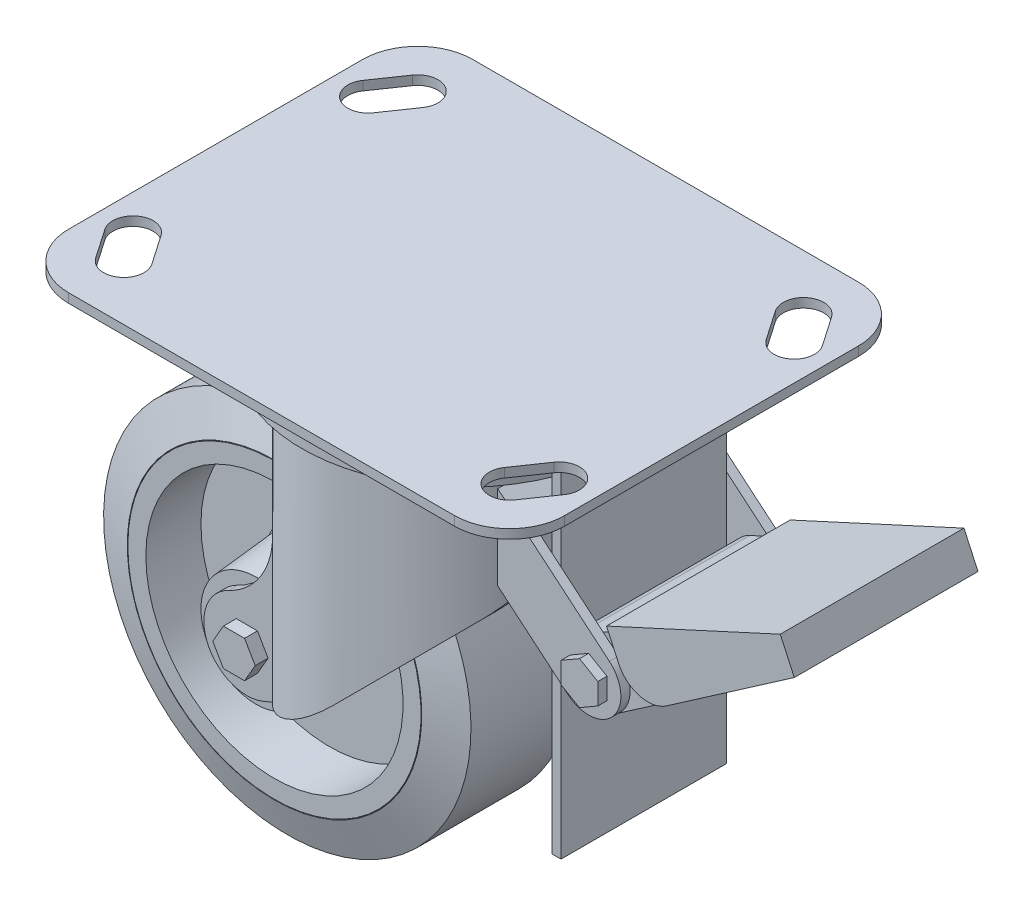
ISO-10303-21;
HEADER;
FILE_DESCRIPTION(('STEP AP214'),'2;1');
FILE_NAME('part.step','',(''),(''),'','','');
FILE_SCHEMA(('AUTOMOTIVE_DESIGN { 1 0 10303 214 1 1 1 1 }'));
ENDSEC;
DATA;
#1=APPLICATION_CONTEXT('core data for automotive mechanical design processes');
#2=APPLICATION_PROTOCOL_DEFINITION('international standard','automotive_design',2000,#1);
#3=PRODUCT_CONTEXT('',#1,'mechanical');
#4=PRODUCT('Part','Part','',(#3));
#5=PRODUCT_RELATED_PRODUCT_CATEGORY('part','',(#4));
#6=PRODUCT_DEFINITION_FORMATION('','',#4);
#7=PRODUCT_DEFINITION_CONTEXT('part definition',#1,'design');
#8=PRODUCT_DEFINITION('design','',#6,#7);
#9=PRODUCT_DEFINITION_SHAPE('','',#8);
#10=(LENGTH_UNIT() NAMED_UNIT(*) SI_UNIT(.MILLI.,.METRE.));
#11=(NAMED_UNIT(*) PLANE_ANGLE_UNIT() SI_UNIT($,.RADIAN.));
#12=(NAMED_UNIT(*) SI_UNIT($,.STERADIAN.) SOLID_ANGLE_UNIT());
#13=UNCERTAINTY_MEASURE_WITH_UNIT(LENGTH_MEASURE(1.E-05),#10,'distance_accuracy_value','');
#14=(GEOMETRIC_REPRESENTATION_CONTEXT(3) GLOBAL_UNCERTAINTY_ASSIGNED_CONTEXT((#13)) GLOBAL_UNIT_ASSIGNED_CONTEXT((#10,
#11,#12)) REPRESENTATION_CONTEXT('',''));
#15=CARTESIAN_POINT('',(0.,0.,0.));
#16=DIRECTION('',(0.,0.,1.));
#17=DIRECTION('',(1.,0.,0.));
#18=AXIS2_PLACEMENT_3D('',#15,#16,#17);
#19=CARTESIAN_POINT('',(0.,-5.,0.));
#20=DIRECTION('',(0.,1.,0.));
#21=DIRECTION('',(0.,0.,1.));
#22=AXIS2_PLACEMENT_3D('',#19,#20,#21);
#23=TOROIDAL_SURFACE('',#22,39.,2.5);
#24=CARTESIAN_POINT('',(0.,-5.,41.5));
#25=VERTEX_POINT('',#24);
#26=VERTEX_LOOP('',#25);
#27=FACE_BOUND('',#26,.T.);
#28=ADVANCED_FACE('F47',(#27),#23,.T.);
#29=CLOSED_SHELL('',(#28));
#30=MANIFOLD_SOLID_BREP('B2',#29);
#31=CARTESIAN_POINT('',(-52.500000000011,0.,-40.0000000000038));
#32=DIRECTION('',(0.,-1.,0.));
#33=DIRECTION('',(0.,0.,-1.));
#34=AXIS2_PLACEMENT_3D('',#31,#32,#33);
#35=CYLINDRICAL_SURFACE('',#34,14.9999999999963);
#36=CARTESIAN_POINT('',(-52.500000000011,-2.5,-40.0000000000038));
#37=DIRECTION('',(0.,-1.,0.));
#38=DIRECTION('',(0.,0.,-1.));
#39=AXIS2_PLACEMENT_3D('',#36,#37,#38);
#40=CIRCLE('',#39,14.9999999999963);
#41=CARTESIAN_POINT('',(-67.5000000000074,-2.5,-40.0000000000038));
#42=VERTEX_POINT('',#41);
#43=CARTESIAN_POINT('',(-52.500000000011,-2.5,-55.0000000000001));
#44=VERTEX_POINT('',#43);
#45=EDGE_CURVE('E357',#42,#44,#40,.T.);
#46=ORIENTED_EDGE('',*,*,#45,.F.);
#47=DIRECTION('',(0.,-1.,0.));
#48=VECTOR('',#47,1.);
#49=CARTESIAN_POINT('',(-67.5000000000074,0.,-40.0000000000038));
#50=LINE('',#49,#48);
#51=CARTESIAN_POINT('',(-67.5000000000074,0.,-40.0000000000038));
#52=VERTEX_POINT('',#51);
#53=EDGE_CURVE('E45',#52,#42,#50,.T.);
#54=ORIENTED_EDGE('',*,*,#53,.F.);
#55=CARTESIAN_POINT('',(-52.500000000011,0.,-40.0000000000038));
#56=DIRECTION('',(0.,-1.,0.));
#57=DIRECTION('',(0.,0.,-1.));
#58=AXIS2_PLACEMENT_3D('',#55,#56,#57);
#59=CIRCLE('',#58,14.9999999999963);
#60=CARTESIAN_POINT('',(-52.500000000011,0.,-55.0000000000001));
#61=VERTEX_POINT('',#60);
#62=EDGE_CURVE('E364',#52,#61,#59,.T.);
#63=ORIENTED_EDGE('',*,*,#62,.T.);
#64=DIRECTION('',(0.,-1.,0.));
#65=VECTOR('',#64,1.);
#66=CARTESIAN_POINT('',(-52.500000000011,0.,-55.0000000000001));
#67=LINE('',#66,#65);
#68=EDGE_CURVE('E73',#61,#44,#67,.T.);
#69=ORIENTED_EDGE('',*,*,#68,.T.);
#70=EDGE_LOOP('',(#46,#54,#63,#69));
#71=FACE_BOUND('',#70,.T.);
#72=ADVANCED_FACE('F70',(#71),#35,.T.);
#73=CARTESIAN_POINT('',(-67.5000000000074,0.,39.9999999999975));
#74=DIRECTION('',(-1.,0.,0.));
#75=DIRECTION('',(0.,0.,1.));
#76=AXIS2_PLACEMENT_3D('',#73,#74,#75);
#77=PLANE('',#76);
#78=DIRECTION('',(0.,0.,-1.));
#79=VECTOR('',#78,1.);
#80=CARTESIAN_POINT('',(-67.5000000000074,-2.5,39.9999999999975));
#81=LINE('',#80,#79);
#82=CARTESIAN_POINT('',(-67.5000000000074,-2.5,39.9999999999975));
#83=VERTEX_POINT('',#82);
#84=EDGE_CURVE('E368',#83,#42,#81,.T.);
#85=ORIENTED_EDGE('',*,*,#84,.F.);
#86=DIRECTION('',(0.,-1.,0.));
#87=VECTOR('',#86,1.);
#88=CARTESIAN_POINT('',(-67.5000000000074,0.,39.9999999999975));
#89=LINE('',#88,#87);
#90=CARTESIAN_POINT('',(-67.5000000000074,0.,39.9999999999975));
#91=VERTEX_POINT('',#90);
#92=EDGE_CURVE('E78',#91,#83,#89,.T.);
#93=ORIENTED_EDGE('',*,*,#92,.F.);
#94=DIRECTION('',(0.,0.,-1.));
#95=VECTOR('',#94,1.);
#96=CARTESIAN_POINT('',(-67.5000000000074,0.,39.9999999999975));
#97=LINE('',#96,#95);
#98=EDGE_CURVE('E386',#91,#52,#97,.T.);
#99=ORIENTED_EDGE('',*,*,#98,.T.);
#100=ORIENTED_EDGE('',*,*,#53,.T.);
#101=EDGE_LOOP('',(#85,#93,#99,#100));
#102=FACE_BOUND('',#101,.T.);
#103=ADVANCED_FACE('F433',(#102),#77,.T.);
#104=CARTESIAN_POINT('',(-52.500000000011,0.,39.9999999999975));
#105=DIRECTION('',(0.,-1.,0.));
#106=DIRECTION('',(0.,0.,-1.));
#107=AXIS2_PLACEMENT_3D('',#104,#105,#106);
#108=CYLINDRICAL_SURFACE('',#107,14.9999999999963);
#109=CARTESIAN_POINT('',(-52.500000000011,-2.5,39.9999999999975));
#110=DIRECTION('',(0.,-1.,0.));
#111=DIRECTION('',(0.,0.,-1.));
#112=AXIS2_PLACEMENT_3D('',#109,#110,#111);
#113=CIRCLE('',#112,14.9999999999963);
#114=CARTESIAN_POINT('',(-52.500000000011,-2.5,54.9999999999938));
#115=VERTEX_POINT('',#114);
#116=EDGE_CURVE('E406',#115,#83,#113,.T.);
#117=ORIENTED_EDGE('',*,*,#116,.F.);
#118=DIRECTION('',(0.,-1.,0.));
#119=VECTOR('',#118,1.);
#120=CARTESIAN_POINT('',(-52.500000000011,0.,54.9999999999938));
#121=LINE('',#120,#119);
#122=CARTESIAN_POINT('',(-52.500000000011,0.,54.9999999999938));
#123=VERTEX_POINT('',#122);
#124=EDGE_CURVE('E412',#123,#115,#121,.T.);
#125=ORIENTED_EDGE('',*,*,#124,.F.);
#126=CARTESIAN_POINT('',(-52.500000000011,0.,39.9999999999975));
#127=DIRECTION('',(0.,-1.,0.));
#128=DIRECTION('',(0.,0.,-1.));
#129=AXIS2_PLACEMENT_3D('',#126,#127,#128);
#130=CIRCLE('',#129,14.9999999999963);
#131=EDGE_CURVE('E383',#123,#91,#130,.T.);
#132=ORIENTED_EDGE('',*,*,#131,.T.);
#133=ORIENTED_EDGE('',*,*,#92,.T.);
#134=EDGE_LOOP('',(#117,#125,#132,#133));
#135=FACE_BOUND('',#134,.T.);
#136=ADVANCED_FACE('F453',(#135),#108,.T.);
#137=CARTESIAN_POINT('',(52.4999999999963,0.,54.9999999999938));
#138=DIRECTION('',(0.,0.,1.));
#139=DIRECTION('',(1.,0.,0.));
#140=AXIS2_PLACEMENT_3D('',#137,#138,#139);
#141=PLANE('',#140);
#142=DIRECTION('',(-1.,0.,0.));
#143=VECTOR('',#142,1.);
#144=CARTESIAN_POINT('',(52.4999999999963,-2.5,54.9999999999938));
#145=LINE('',#144,#143);
#146=CARTESIAN_POINT('',(52.4999999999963,-2.5,54.9999999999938));
#147=VERTEX_POINT('',#146);
#148=EDGE_CURVE('E403',#147,#115,#145,.T.);
#149=ORIENTED_EDGE('',*,*,#148,.F.);
#150=DIRECTION('',(0.,-1.,0.));
#151=VECTOR('',#150,1.);
#152=CARTESIAN_POINT('',(52.4999999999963,0.,54.9999999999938));
#153=LINE('',#152,#151);
#154=CARTESIAN_POINT('',(52.4999999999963,0.,54.9999999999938));
#155=VERTEX_POINT('',#154);
#156=EDGE_CURVE('E414',#155,#147,#153,.T.);
#157=ORIENTED_EDGE('',*,*,#156,.F.);
#158=DIRECTION('',(-1.,0.,0.));
#159=VECTOR('',#158,1.);
#160=CARTESIAN_POINT('',(52.4999999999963,0.,54.9999999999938));
#161=LINE('',#160,#159);
#162=EDGE_CURVE('E380',#155,#123,#161,.T.);
#163=ORIENTED_EDGE('',*,*,#162,.T.);
#164=ORIENTED_EDGE('',*,*,#124,.T.);
#165=EDGE_LOOP('',(#149,#157,#163,#164));
#166=FACE_BOUND('',#165,.T.);
#167=ADVANCED_FACE('F451',(#166),#141,.T.);
#168=CARTESIAN_POINT('',(52.4999999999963,0.,39.9999999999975));
#169=DIRECTION('',(0.,-1.,0.));
#170=DIRECTION('',(0.,0.,-1.));
#171=AXIS2_PLACEMENT_3D('',#168,#169,#170);
#172=CYLINDRICAL_SURFACE('',#171,14.9999999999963);
#173=CARTESIAN_POINT('',(52.4999999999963,-2.5,39.9999999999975));
#174=DIRECTION('',(0.,-1.,0.));
#175=DIRECTION('',(0.,0.,-1.));
#176=AXIS2_PLACEMENT_3D('',#173,#174,#175);
#177=CIRCLE('',#176,14.9999999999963);
#178=CARTESIAN_POINT('',(67.4999999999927,-2.5,39.9999999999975));
#179=VERTEX_POINT('',#178);
#180=EDGE_CURVE('E400',#179,#147,#177,.T.);
#181=ORIENTED_EDGE('',*,*,#180,.F.);
#182=DIRECTION('',(0.,-1.,0.));
#183=VECTOR('',#182,1.);
#184=CARTESIAN_POINT('',(67.4999999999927,0.,39.9999999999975));
#185=LINE('',#184,#183);
#186=CARTESIAN_POINT('',(67.4999999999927,0.,39.9999999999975));
#187=VERTEX_POINT('',#186);
#188=EDGE_CURVE('E416',#187,#179,#185,.T.);
#189=ORIENTED_EDGE('',*,*,#188,.F.);
#190=CARTESIAN_POINT('',(52.4999999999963,0.,39.9999999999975));
#191=DIRECTION('',(0.,-1.,0.));
#192=DIRECTION('',(0.,0.,-1.));
#193=AXIS2_PLACEMENT_3D('',#190,#191,#192);
#194=CIRCLE('',#193,14.9999999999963);
#195=EDGE_CURVE('E377',#187,#155,#194,.T.);
#196=ORIENTED_EDGE('',*,*,#195,.T.);
#197=ORIENTED_EDGE('',*,*,#156,.T.);
#198=EDGE_LOOP('',(#181,#189,#196,#197));
#199=FACE_BOUND('',#198,.T.);
#200=ADVANCED_FACE('F447',(#199),#172,.T.);
#201=CARTESIAN_POINT('',(67.4999999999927,0.,-40.0000000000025));
#202=DIRECTION('',(1.,0.,0.));
#203=DIRECTION('',(0.,0.,-1.));
#204=AXIS2_PLACEMENT_3D('',#201,#202,#203);
#205=PLANE('',#204);
#206=DIRECTION('',(0.,0.,1.));
#207=VECTOR('',#206,1.);
#208=CARTESIAN_POINT('',(67.4999999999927,-2.5,-40.0000000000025));
#209=LINE('',#208,#207);
#210=CARTESIAN_POINT('',(67.4999999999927,-2.5,-40.0000000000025));
#211=VERTEX_POINT('',#210);
#212=EDGE_CURVE('E397',#211,#179,#209,.T.);
#213=ORIENTED_EDGE('',*,*,#212,.F.);
#214=DIRECTION('',(0.,-1.,0.));
#215=VECTOR('',#214,1.);
#216=CARTESIAN_POINT('',(67.4999999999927,0.,-40.0000000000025));
#217=LINE('',#216,#215);
#218=CARTESIAN_POINT('',(67.4999999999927,0.,-40.0000000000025));
#219=VERTEX_POINT('',#218);
#220=EDGE_CURVE('E418',#219,#211,#217,.T.);
#221=ORIENTED_EDGE('',*,*,#220,.F.);
#222=DIRECTION('',(0.,0.,1.));
#223=VECTOR('',#222,1.);
#224=CARTESIAN_POINT('',(67.4999999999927,0.,-40.0000000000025));
#225=LINE('',#224,#223);
#226=EDGE_CURVE('E374',#219,#187,#225,.T.);
#227=ORIENTED_EDGE('',*,*,#226,.T.);
#228=ORIENTED_EDGE('',*,*,#188,.T.);
#229=EDGE_LOOP('',(#213,#221,#227,#228));
#230=FACE_BOUND('',#229,.T.);
#231=ADVANCED_FACE('F445',(#230),#205,.T.);
#232=CARTESIAN_POINT('',(52.4999999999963,0.,-40.0000000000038));
#233=DIRECTION('',(0.,-1.,0.));
#234=DIRECTION('',(0.,0.,-1.));
#235=AXIS2_PLACEMENT_3D('',#232,#233,#234);
#236=CYLINDRICAL_SURFACE('',#235,14.9999999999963);
#237=CARTESIAN_POINT('',(52.4999999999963,-2.5,-40.0000000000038));
#238=DIRECTION('',(0.,-1.,0.));
#239=DIRECTION('',(0.,0.,-1.));
#240=AXIS2_PLACEMENT_3D('',#237,#238,#239);
#241=CIRCLE('',#240,14.9999999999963);
#242=CARTESIAN_POINT('',(52.4999999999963,-2.5,-55.0000000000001));
#243=VERTEX_POINT('',#242);
#244=EDGE_CURVE('E394',#243,#211,#241,.T.);
#245=ORIENTED_EDGE('',*,*,#244,.F.);
#246=DIRECTION('',(0.,-1.,0.));
#247=VECTOR('',#246,1.);
#248=CARTESIAN_POINT('',(52.4999999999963,0.,-55.0000000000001));
#249=LINE('',#248,#247);
#250=CARTESIAN_POINT('',(52.4999999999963,0.,-55.0000000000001));
#251=VERTEX_POINT('',#250);
#252=EDGE_CURVE('E419',#251,#243,#249,.T.);
#253=ORIENTED_EDGE('',*,*,#252,.F.);
#254=CARTESIAN_POINT('',(52.4999999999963,0.,-40.0000000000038));
#255=DIRECTION('',(0.,-1.,0.));
#256=DIRECTION('',(0.,0.,-1.));
#257=AXIS2_PLACEMENT_3D('',#254,#255,#256);
#258=CIRCLE('',#257,14.9999999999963);
#259=EDGE_CURVE('E371',#251,#219,#258,.T.);
#260=ORIENTED_EDGE('',*,*,#259,.T.);
#261=ORIENTED_EDGE('',*,*,#220,.T.);
#262=EDGE_LOOP('',(#245,#253,#260,#261));
#263=FACE_BOUND('',#262,.T.);
#264=ADVANCED_FACE('F441',(#263),#236,.T.);
#265=CARTESIAN_POINT('',(-52.500000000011,0.,-55.0000000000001));
#266=DIRECTION('',(0.,0.,-1.));
#267=DIRECTION('',(-1.,0.,0.));
#268=AXIS2_PLACEMENT_3D('',#265,#266,#267);
#269=PLANE('',#268);
#270=DIRECTION('',(1.,0.,0.));
#271=VECTOR('',#270,1.);
#272=CARTESIAN_POINT('',(-52.500000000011,-2.5,-55.0000000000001));
#273=LINE('',#272,#271);
#274=EDGE_CURVE('E391',#44,#243,#273,.T.);
#275=ORIENTED_EDGE('',*,*,#274,.F.);
#276=ORIENTED_EDGE('',*,*,#68,.F.);
#277=DIRECTION('',(1.,0.,0.));
#278=VECTOR('',#277,1.);
#279=CARTESIAN_POINT('',(-52.500000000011,0.,-55.0000000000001));
#280=LINE('',#279,#278);
#281=EDGE_CURVE('E367',#61,#251,#280,.T.);
#282=ORIENTED_EDGE('',*,*,#281,.T.);
#283=ORIENTED_EDGE('',*,*,#252,.T.);
#284=EDGE_LOOP('',(#275,#276,#282,#283));
#285=FACE_BOUND('',#284,.T.);
#286=ADVANCED_FACE('F427',(#285),#269,.T.);
#287=CARTESIAN_POINT('',(-52.500000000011,0.,-40.0000000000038));
#288=DIRECTION('',(0.,-1.,0.));
#289=DIRECTION('',(0.,0.,-1.));
#290=AXIS2_PLACEMENT_3D('',#287,#288,#289);
#291=PLANE('',#290);
#292=DIRECTION('',(0.566528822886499,0.,0.824041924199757));
#293=VECTOR('',#292,1.);
#294=CARTESIAN_POINT('',(-47.9677694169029,0.,36.8840914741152));
#295=LINE('',#294,#293);
#296=CARTESIAN_POINT('',(-53.4677694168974,0.,28.8840914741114));
#297=VERTEX_POINT('',#296);
#298=CARTESIAN_POINT('',(-47.9677694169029,0.,36.8840914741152));
#299=VERTEX_POINT('',#298);
#300=EDGE_CURVE('E239',#297,#299,#295,.T.);
#301=ORIENTED_EDGE('',*,*,#300,.T.);
#302=CARTESIAN_POINT('',(-52.500000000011,0.,39.9999999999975));
#303=DIRECTION('',(0.,-1.,0.));
#304=DIRECTION('',(0.,0.,1.));
#305=AXIS2_PLACEMENT_3D('',#302,#303,#304);
#306=CIRCLE('',#305,5.50000000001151);
#307=CARTESIAN_POINT('',(-57.0322305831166,0.,43.1159085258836));
#308=VERTEX_POINT('',#307);
#309=EDGE_CURVE('E233',#299,#308,#306,.T.);
#310=ORIENTED_EDGE('',*,*,#309,.T.);
#311=DIRECTION('',(-0.566528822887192,0.,-0.82404192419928));
#312=VECTOR('',#311,1.);
#313=CARTESIAN_POINT('',(-62.5322305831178,0.,35.1159085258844));
#314=LINE('',#313,#312);
#315=CARTESIAN_POINT('',(-62.5322305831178,0.,35.1159085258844));
#316=VERTEX_POINT('',#315);
#317=EDGE_CURVE('E242',#308,#316,#314,.T.);
#318=ORIENTED_EDGE('',*,*,#317,.T.);
#319=CARTESIAN_POINT('',(-58.0000000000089,0.,31.999999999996));
#320=DIRECTION('',(0.,-1.,0.));
#321=DIRECTION('',(0.,0.,1.));
#322=AXIS2_PLACEMENT_3D('',#319,#320,#321);
#323=CIRCLE('',#322,5.5000000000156);
#324=EDGE_CURVE('E86',#316,#297,#323,.T.);
#325=ORIENTED_EDGE('',*,*,#324,.T.);
#326=EDGE_LOOP('',(#301,#310,#318,#325));
#327=FACE_BOUND('',#326,.T.);
#328=DIRECTION('',(-0.566528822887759,0.,0.82404192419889));
#329=VECTOR('',#328,1.);
#330=CARTESIAN_POINT('',(-53.4677694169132,0.,-28.8840914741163));
#331=LINE('',#330,#329);
#332=CARTESIAN_POINT('',(-47.9677694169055,0.,-36.8840914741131));
#333=VERTEX_POINT('',#332);
#334=CARTESIAN_POINT('',(-53.4677694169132,0.,-28.8840914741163));
#335=VERTEX_POINT('',#334);
#336=EDGE_CURVE('E278',#333,#335,#331,.T.);
#337=ORIENTED_EDGE('',*,*,#336,.T.);
#338=CARTESIAN_POINT('',(-58.000000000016,0.,-32.0000000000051));
#339=DIRECTION('',(0.,-1.,0.));
#340=DIRECTION('',(0.,0.,1.));
#341=AXIS2_PLACEMENT_3D('',#338,#339,#340);
#342=CIRCLE('',#341,5.50000000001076);
#343=CARTESIAN_POINT('',(-62.5322305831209,0.,-35.1159085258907));
#344=VERTEX_POINT('',#343);
#345=EDGE_CURVE('E268',#335,#344,#342,.T.);
#346=ORIENTED_EDGE('',*,*,#345,.T.);
#347=DIRECTION('',(0.566528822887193,0.,-0.824041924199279));
#348=VECTOR('',#347,1.);
#349=CARTESIAN_POINT('',(-57.0322305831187,0.,-43.1159085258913));
#350=LINE('',#349,#348);
#351=CARTESIAN_POINT('',(-57.0322305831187,0.,-43.1159085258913));
#352=VERTEX_POINT('',#351);
#353=EDGE_CURVE('E271',#344,#352,#350,.T.);
#354=ORIENTED_EDGE('',*,*,#353,.T.);
#355=CARTESIAN_POINT('',(-52.500000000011,0.,-40.0000000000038));
#356=DIRECTION('',(0.,-1.,0.));
#357=DIRECTION('',(0.,0.,1.));
#358=AXIS2_PLACEMENT_3D('',#355,#356,#357);
#359=CIRCLE('',#358,5.50000000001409);
#360=EDGE_CURVE('E275',#352,#333,#359,.T.);
#361=ORIENTED_EDGE('',*,*,#360,.T.);
#362=EDGE_LOOP('',(#337,#346,#354,#361));
#363=FACE_BOUND('',#362,.T.);
#364=DIRECTION('',(-0.56652882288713,0.,0.824041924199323));
#365=VECTOR('',#364,1.);
#366=CARTESIAN_POINT('',(57.0322305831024,0.,43.1159085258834));
#367=LINE('',#366,#365);
#368=CARTESIAN_POINT('',(62.5322305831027,0.,35.1159085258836));
#369=VERTEX_POINT('',#368);
#370=CARTESIAN_POINT('',(57.0322305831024,0.,43.1159085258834));
#371=VERTEX_POINT('',#370);
#372=EDGE_CURVE('E310',#369,#371,#367,.T.);
#373=ORIENTED_EDGE('',*,*,#372,.T.);
#374=CARTESIAN_POINT('',(52.4999999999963,0.,39.9999999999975));
#375=DIRECTION('',(0.,-1.,0.));
#376=DIRECTION('',(0.,0.,1.));
#377=AXIS2_PLACEMENT_3D('',#374,#375,#376);
#378=CIRCLE('',#377,5.50000000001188);
#379=CARTESIAN_POINT('',(47.9677694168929,0.,36.8840914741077));
#380=VERTEX_POINT('',#379);
#381=EDGE_CURVE('E300',#371,#380,#378,.T.);
#382=ORIENTED_EDGE('',*,*,#381,.T.);
#383=DIRECTION('',(0.566528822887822,0.,-0.824041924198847));
#384=VECTOR('',#383,1.);
#385=CARTESIAN_POINT('',(53.4677694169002,0.,28.8840914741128));
#386=LINE('',#385,#384);
#387=CARTESIAN_POINT('',(53.4677694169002,0.,28.8840914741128));
#388=VERTEX_POINT('',#387);
#389=EDGE_CURVE('E303',#380,#388,#386,.T.);
#390=ORIENTED_EDGE('',*,*,#389,.T.);
#391=CARTESIAN_POINT('',(58.,0.,32.));
#392=DIRECTION('',(0.,-1.,0.));
#393=DIRECTION('',(0.,0.,1.));
#394=AXIS2_PLACEMENT_3D('',#391,#392,#393);
#395=CIRCLE('',#394,5.5000000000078);
#396=EDGE_CURVE('E307',#388,#369,#395,.T.);
#397=ORIENTED_EDGE('',*,*,#396,.T.);
#398=EDGE_LOOP('',(#373,#382,#390,#397));
#399=FACE_BOUND('',#398,.T.);
#400=DIRECTION('',(0.56652882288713,0.,0.824041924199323));
#401=VECTOR('',#400,1.);
#402=CARTESIAN_POINT('',(62.532230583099,0.,-35.1159085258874));
#403=LINE('',#402,#401);
#404=CARTESIAN_POINT('',(57.0322305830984,0.,-43.115908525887));
#405=VERTEX_POINT('',#404);
#406=CARTESIAN_POINT('',(62.532230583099,0.,-35.1159085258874));
#407=VERTEX_POINT('',#406);
#408=EDGE_CURVE('E342',#405,#407,#403,.T.);
#409=ORIENTED_EDGE('',*,*,#408,.T.);
#410=CARTESIAN_POINT('',(57.9999999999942,0.,-32.0000000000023));
#411=DIRECTION('',(0.,-1.,0.));
#412=DIRECTION('',(0.,0.,1.));
#413=AXIS2_PLACEMENT_3D('',#410,#411,#412);
#414=CIRCLE('',#413,5.50000000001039);
#415=CARTESIAN_POINT('',(53.4677694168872,0.,-28.8840914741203));
#416=VERTEX_POINT('',#415);
#417=EDGE_CURVE('E332',#407,#416,#414,.T.);
#418=ORIENTED_EDGE('',*,*,#417,.T.);
#419=DIRECTION('',(-0.566528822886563,0.,-0.824041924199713));
#420=VECTOR('',#419,1.);
#421=CARTESIAN_POINT('',(47.9677694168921,0.,-36.8840914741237));
#422=LINE('',#421,#420);
#423=CARTESIAN_POINT('',(47.9677694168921,0.,-36.8840914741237));
#424=VERTEX_POINT('',#423);
#425=EDGE_CURVE('E335',#416,#424,#422,.T.);
#426=ORIENTED_EDGE('',*,*,#425,.T.);
#427=CARTESIAN_POINT('',(52.4999999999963,0.,-40.0000000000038));
#428=DIRECTION('',(0.,-1.,0.));
#429=DIRECTION('',(0.,0.,1.));
#430=AXIS2_PLACEMENT_3D('',#427,#428,#429);
#431=CIRCLE('',#430,5.50000000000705);
#432=EDGE_CURVE('E339',#424,#405,#431,.T.);
#433=ORIENTED_EDGE('',*,*,#432,.T.);
#434=EDGE_LOOP('',(#409,#418,#426,#433));
#435=FACE_BOUND('',#434,.T.);
#436=ORIENTED_EDGE('',*,*,#62,.F.);
#437=ORIENTED_EDGE('',*,*,#98,.F.);
#438=ORIENTED_EDGE('',*,*,#131,.F.);
#439=ORIENTED_EDGE('',*,*,#162,.F.);
#440=ORIENTED_EDGE('',*,*,#195,.F.);
#441=ORIENTED_EDGE('',*,*,#226,.F.);
#442=ORIENTED_EDGE('',*,*,#259,.F.);
#443=ORIENTED_EDGE('',*,*,#281,.F.);
#444=EDGE_LOOP('',(#436,#437,#438,#439,#440,#441,#442,#443));
#445=FACE_BOUND('',#444,.T.);
#446=ADVANCED_FACE('F246',(#327,#363,#399,#435,#445),#291,.F.);
#447=CARTESIAN_POINT('',(-52.500000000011,-2.5,-40.0000000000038));
#448=DIRECTION('',(0.,-1.,0.));
#449=DIRECTION('',(0.,0.,-1.));
#450=AXIS2_PLACEMENT_3D('',#447,#448,#449);
#451=PLANE('',#450);
#452=CARTESIAN_POINT('',(-52.500000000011,-2.5,39.9999999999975));
#453=DIRECTION('',(0.,-1.,0.));
#454=DIRECTION('',(0.,0.,1.));
#455=AXIS2_PLACEMENT_3D('',#452,#453,#454);
#456=CIRCLE('',#455,5.50000000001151);
#457=CARTESIAN_POINT('',(-47.9677694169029,-2.5,36.8840914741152));
#458=VERTEX_POINT('',#457);
#459=CARTESIAN_POINT('',(-57.0322305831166,-2.5,43.1159085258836));
#460=VERTEX_POINT('',#459);
#461=EDGE_CURVE('E94',#458,#460,#456,.T.);
#462=ORIENTED_EDGE('',*,*,#461,.F.);
#463=DIRECTION('',(0.566528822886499,0.,0.824041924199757));
#464=VECTOR('',#463,1.);
#465=CARTESIAN_POINT('',(-47.9677694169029,-2.5,36.8840914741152));
#466=LINE('',#465,#464);
#467=CARTESIAN_POINT('',(-53.4677694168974,-2.5,28.8840914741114));
#468=VERTEX_POINT('',#467);
#469=EDGE_CURVE('E249',#468,#458,#466,.T.);
#470=ORIENTED_EDGE('',*,*,#469,.F.);
#471=CARTESIAN_POINT('',(-58.0000000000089,-2.5,31.999999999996));
#472=DIRECTION('',(0.,-1.,0.));
#473=DIRECTION('',(0.,0.,1.));
#474=AXIS2_PLACEMENT_3D('',#471,#472,#473);
#475=CIRCLE('',#474,5.5000000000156);
#476=CARTESIAN_POINT('',(-62.5322305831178,-2.5,35.1159085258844));
#477=VERTEX_POINT('',#476);
#478=EDGE_CURVE('E252',#477,#468,#475,.T.);
#479=ORIENTED_EDGE('',*,*,#478,.F.);
#480=DIRECTION('',(-0.566528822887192,0.,-0.82404192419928));
#481=VECTOR('',#480,1.);
#482=CARTESIAN_POINT('',(-62.5322305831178,-2.5,35.1159085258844));
#483=LINE('',#482,#481);
#484=EDGE_CURVE('E258',#460,#477,#483,.T.);
#485=ORIENTED_EDGE('',*,*,#484,.F.);
#486=EDGE_LOOP('',(#462,#470,#479,#485));
#487=FACE_BOUND('',#486,.T.);
#488=CARTESIAN_POINT('',(-58.000000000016,-2.5,-32.0000000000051));
#489=DIRECTION('',(0.,-1.,0.));
#490=DIRECTION('',(0.,0.,1.));
#491=AXIS2_PLACEMENT_3D('',#488,#489,#490);
#492=CIRCLE('',#491,5.50000000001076);
#493=CARTESIAN_POINT('',(-53.4677694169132,-2.5,-28.8840914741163));
#494=VERTEX_POINT('',#493);
#495=CARTESIAN_POINT('',(-62.5322305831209,-2.5,-35.1159085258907));
#496=VERTEX_POINT('',#495);
#497=EDGE_CURVE('E264',#494,#496,#492,.T.);
#498=ORIENTED_EDGE('',*,*,#497,.F.);
#499=DIRECTION('',(-0.566528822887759,0.,0.82404192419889));
#500=VECTOR('',#499,1.);
#501=CARTESIAN_POINT('',(-53.4677694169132,-2.5,-28.8840914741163));
#502=LINE('',#501,#500);
#503=CARTESIAN_POINT('',(-47.9677694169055,-2.5,-36.8840914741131));
#504=VERTEX_POINT('',#503);
#505=EDGE_CURVE('E272',#504,#494,#502,.T.);
#506=ORIENTED_EDGE('',*,*,#505,.F.);
#507=CARTESIAN_POINT('',(-52.500000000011,-2.5,-40.0000000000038));
#508=DIRECTION('',(0.,-1.,0.));
#509=DIRECTION('',(0.,0.,1.));
#510=AXIS2_PLACEMENT_3D('',#507,#508,#509);
#511=CIRCLE('',#510,5.50000000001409);
#512=CARTESIAN_POINT('',(-57.0322305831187,-2.5,-43.1159085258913));
#513=VERTEX_POINT('',#512);
#514=EDGE_CURVE('E286',#513,#504,#511,.T.);
#515=ORIENTED_EDGE('',*,*,#514,.F.);
#516=DIRECTION('',(0.566528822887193,0.,-0.824041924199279));
#517=VECTOR('',#516,1.);
#518=CARTESIAN_POINT('',(-57.0322305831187,-2.5,-43.1159085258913));
#519=LINE('',#518,#517);
#520=EDGE_CURVE('E283',#496,#513,#519,.T.);
#521=ORIENTED_EDGE('',*,*,#520,.F.);
#522=EDGE_LOOP('',(#498,#506,#515,#521));
#523=FACE_BOUND('',#522,.T.);
#524=CARTESIAN_POINT('',(52.4999999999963,-2.5,39.9999999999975));
#525=DIRECTION('',(0.,-1.,0.));
#526=DIRECTION('',(0.,0.,1.));
#527=AXIS2_PLACEMENT_3D('',#524,#525,#526);
#528=CIRCLE('',#527,5.50000000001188);
#529=CARTESIAN_POINT('',(57.0322305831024,-2.5,43.1159085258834));
#530=VERTEX_POINT('',#529);
#531=CARTESIAN_POINT('',(47.9677694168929,-2.5,36.8840914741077));
#532=VERTEX_POINT('',#531);
#533=EDGE_CURVE('E293',#530,#532,#528,.T.);
#534=ORIENTED_EDGE('',*,*,#533,.F.);
#535=DIRECTION('',(-0.56652882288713,0.,0.824041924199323));
#536=VECTOR('',#535,1.);
#537=CARTESIAN_POINT('',(57.0322305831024,-2.5,43.1159085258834));
#538=LINE('',#537,#536);
#539=CARTESIAN_POINT('',(62.5322305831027,-2.5,35.1159085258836));
#540=VERTEX_POINT('',#539);
#541=EDGE_CURVE('E304',#540,#530,#538,.T.);
#542=ORIENTED_EDGE('',*,*,#541,.F.);
#543=CARTESIAN_POINT('',(58.,-2.5,32.));
#544=DIRECTION('',(0.,-1.,0.));
#545=DIRECTION('',(0.,0.,1.));
#546=AXIS2_PLACEMENT_3D('',#543,#544,#545);
#547=CIRCLE('',#546,5.5000000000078);
#548=CARTESIAN_POINT('',(53.4677694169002,-2.5,28.8840914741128));
#549=VERTEX_POINT('',#548);
#550=EDGE_CURVE('E318',#549,#540,#547,.T.);
#551=ORIENTED_EDGE('',*,*,#550,.F.);
#552=DIRECTION('',(0.566528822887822,0.,-0.824041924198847));
#553=VECTOR('',#552,1.);
#554=CARTESIAN_POINT('',(53.4677694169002,-2.5,28.8840914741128));
#555=LINE('',#554,#553);
#556=EDGE_CURVE('E315',#532,#549,#555,.T.);
#557=ORIENTED_EDGE('',*,*,#556,.F.);
#558=EDGE_LOOP('',(#534,#542,#551,#557));
#559=FACE_BOUND('',#558,.T.);
#560=CARTESIAN_POINT('',(57.9999999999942,-2.5,-32.0000000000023));
#561=DIRECTION('',(0.,-1.,0.));
#562=DIRECTION('',(0.,0.,1.));
#563=AXIS2_PLACEMENT_3D('',#560,#561,#562);
#564=CIRCLE('',#563,5.50000000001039);
#565=CARTESIAN_POINT('',(62.532230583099,-2.5,-35.1159085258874));
#566=VERTEX_POINT('',#565);
#567=CARTESIAN_POINT('',(53.4677694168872,-2.5,-28.8840914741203));
#568=VERTEX_POINT('',#567);
#569=EDGE_CURVE('E325',#566,#568,#564,.T.);
#570=ORIENTED_EDGE('',*,*,#569,.F.);
#571=DIRECTION('',(0.56652882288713,0.,0.824041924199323));
#572=VECTOR('',#571,1.);
#573=CARTESIAN_POINT('',(62.532230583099,-2.5,-35.1159085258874));
#574=LINE('',#573,#572);
#575=CARTESIAN_POINT('',(57.0322305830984,-2.5,-43.115908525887));
#576=VERTEX_POINT('',#575);
#577=EDGE_CURVE('E336',#576,#566,#574,.T.);
#578=ORIENTED_EDGE('',*,*,#577,.F.);
#579=CARTESIAN_POINT('',(52.4999999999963,-2.5,-40.0000000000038));
#580=DIRECTION('',(0.,-1.,0.));
#581=DIRECTION('',(0.,0.,1.));
#582=AXIS2_PLACEMENT_3D('',#579,#580,#581);
#583=CIRCLE('',#582,5.50000000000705);
#584=CARTESIAN_POINT('',(47.9677694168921,-2.5,-36.8840914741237));
#585=VERTEX_POINT('',#584);
#586=EDGE_CURVE('E350',#585,#576,#583,.T.);
#587=ORIENTED_EDGE('',*,*,#586,.F.);
#588=DIRECTION('',(-0.566528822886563,0.,-0.824041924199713));
#589=VECTOR('',#588,1.);
#590=CARTESIAN_POINT('',(47.9677694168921,-2.5,-36.8840914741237));
#591=LINE('',#590,#589);
#592=EDGE_CURVE('E347',#568,#585,#591,.T.);
#593=ORIENTED_EDGE('',*,*,#592,.F.);
#594=EDGE_LOOP('',(#570,#578,#587,#593));
#595=FACE_BOUND('',#594,.T.);
#596=ORIENTED_EDGE('',*,*,#45,.T.);
#597=ORIENTED_EDGE('',*,*,#274,.T.);
#598=ORIENTED_EDGE('',*,*,#244,.T.);
#599=ORIENTED_EDGE('',*,*,#212,.T.);
#600=ORIENTED_EDGE('',*,*,#180,.T.);
#601=ORIENTED_EDGE('',*,*,#148,.T.);
#602=ORIENTED_EDGE('',*,*,#116,.T.);
#603=ORIENTED_EDGE('',*,*,#84,.T.);
#604=EDGE_LOOP('',(#596,#597,#598,#599,#600,#601,#602,#603));
#605=FACE_BOUND('',#604,.T.);
#606=ADVANCED_FACE('F429',(#487,#523,#559,#595,#605),#451,.T.);
#607=CARTESIAN_POINT('',(57.9999999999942,0.,-32.0000000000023));
#608=DIRECTION('',(0.,-1.,0.));
#609=DIRECTION('',(0.,0.,-1.));
#610=AXIS2_PLACEMENT_3D('',#607,#608,#609);
#611=CYLINDRICAL_SURFACE('',#610,5.50000000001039);
#612=ORIENTED_EDGE('',*,*,#569,.T.);
#613=DIRECTION('',(0.,-1.,0.));
#614=VECTOR('',#613,1.);
#615=CARTESIAN_POINT('',(53.4677694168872,0.,-28.8840914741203));
#616=LINE('',#615,#614);
#617=EDGE_CURVE('E345',#416,#568,#616,.T.);
#618=ORIENTED_EDGE('',*,*,#617,.F.);
#619=ORIENTED_EDGE('',*,*,#417,.F.);
#620=DIRECTION('',(0.,-1.,0.));
#621=VECTOR('',#620,1.);
#622=CARTESIAN_POINT('',(62.532230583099,0.,-35.1159085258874));
#623=LINE('',#622,#621);
#624=EDGE_CURVE('E355',#407,#566,#623,.T.);
#625=ORIENTED_EDGE('',*,*,#624,.T.);
#626=EDGE_LOOP('',(#612,#618,#619,#625));
#627=FACE_BOUND('',#626,.T.);
#628=ADVANCED_FACE('F527',(#627),#611,.F.);
#629=CARTESIAN_POINT('',(62.532230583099,0.,-35.1159085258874));
#630=DIRECTION('',(0.824041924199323,0.,-0.56652882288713));
#631=DIRECTION('',(-0.56652882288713,0.,-0.824041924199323));
#632=AXIS2_PLACEMENT_3D('',#629,#630,#631);
#633=PLANE('',#632);
#634=ORIENTED_EDGE('',*,*,#577,.T.);
#635=ORIENTED_EDGE('',*,*,#624,.F.);
#636=ORIENTED_EDGE('',*,*,#408,.F.);
#637=DIRECTION('',(0.,-1.,0.));
#638=VECTOR('',#637,1.);
#639=CARTESIAN_POINT('',(57.0322305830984,0.,-43.115908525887));
#640=LINE('',#639,#638);
#641=EDGE_CURVE('E358',#405,#576,#640,.T.);
#642=ORIENTED_EDGE('',*,*,#641,.T.);
#643=EDGE_LOOP('',(#634,#635,#636,#642));
#644=FACE_BOUND('',#643,.T.);
#645=ADVANCED_FACE('F537',(#644),#633,.F.);
#646=CARTESIAN_POINT('',(52.4999999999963,0.,-40.0000000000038));
#647=DIRECTION('',(0.,-1.,0.));
#648=DIRECTION('',(0.,0.,-1.));
#649=AXIS2_PLACEMENT_3D('',#646,#647,#648);
#650=CYLINDRICAL_SURFACE('',#649,5.50000000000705);
#651=ORIENTED_EDGE('',*,*,#586,.T.);
#652=ORIENTED_EDGE('',*,*,#641,.F.);
#653=ORIENTED_EDGE('',*,*,#432,.F.);
#654=DIRECTION('',(0.,-1.,0.));
#655=VECTOR('',#654,1.);
#656=CARTESIAN_POINT('',(47.9677694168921,0.,-36.8840914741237));
#657=LINE('',#656,#655);
#658=EDGE_CURVE('E360',#424,#585,#657,.T.);
#659=ORIENTED_EDGE('',*,*,#658,.T.);
#660=EDGE_LOOP('',(#651,#652,#653,#659));
#661=FACE_BOUND('',#660,.T.);
#662=ADVANCED_FACE('F547',(#661),#650,.F.);
#663=CARTESIAN_POINT('',(47.9677694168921,0.,-36.8840914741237));
#664=DIRECTION('',(-0.824041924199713,0.,0.566528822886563));
#665=DIRECTION('',(0.566528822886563,0.,0.824041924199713));
#666=AXIS2_PLACEMENT_3D('',#663,#664,#665);
#667=PLANE('',#666);
#668=ORIENTED_EDGE('',*,*,#592,.T.);
#669=ORIENTED_EDGE('',*,*,#658,.F.);
#670=ORIENTED_EDGE('',*,*,#425,.F.);
#671=ORIENTED_EDGE('',*,*,#617,.T.);
#672=EDGE_LOOP('',(#668,#669,#670,#671));
#673=FACE_BOUND('',#672,.T.);
#674=ADVANCED_FACE('F557',(#673),#667,.F.);
#675=CARTESIAN_POINT('',(52.4999999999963,0.,39.9999999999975));
#676=DIRECTION('',(0.,-1.,0.));
#677=DIRECTION('',(0.,0.,-1.));
#678=AXIS2_PLACEMENT_3D('',#675,#676,#677);
#679=CYLINDRICAL_SURFACE('',#678,5.50000000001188);
#680=ORIENTED_EDGE('',*,*,#533,.T.);
#681=DIRECTION('',(0.,-1.,0.));
#682=VECTOR('',#681,1.);
#683=CARTESIAN_POINT('',(47.9677694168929,0.,36.8840914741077));
#684=LINE('',#683,#682);
#685=EDGE_CURVE('E313',#380,#532,#684,.T.);
#686=ORIENTED_EDGE('',*,*,#685,.F.);
#687=ORIENTED_EDGE('',*,*,#381,.F.);
#688=DIRECTION('',(0.,-1.,0.));
#689=VECTOR('',#688,1.);
#690=CARTESIAN_POINT('',(57.0322305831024,0.,43.1159085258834));
#691=LINE('',#690,#689);
#692=EDGE_CURVE('E323',#371,#530,#691,.T.);
#693=ORIENTED_EDGE('',*,*,#692,.T.);
#694=EDGE_LOOP('',(#680,#686,#687,#693));
#695=FACE_BOUND('',#694,.T.);
#696=ADVANCED_FACE('F567',(#695),#679,.F.);
#697=CARTESIAN_POINT('',(57.0322305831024,0.,43.1159085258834));
#698=DIRECTION('',(0.824041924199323,0.,0.56652882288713));
#699=DIRECTION('',(0.56652882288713,0.,-0.824041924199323));
#700=AXIS2_PLACEMENT_3D('',#697,#698,#699);
#701=PLANE('',#700);
#702=ORIENTED_EDGE('',*,*,#541,.T.);
#703=ORIENTED_EDGE('',*,*,#692,.F.);
#704=ORIENTED_EDGE('',*,*,#372,.F.);
#705=DIRECTION('',(0.,-1.,0.));
#706=VECTOR('',#705,1.);
#707=CARTESIAN_POINT('',(62.5322305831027,0.,35.1159085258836));
#708=LINE('',#707,#706);
#709=EDGE_CURVE('E326',#369,#540,#708,.T.);
#710=ORIENTED_EDGE('',*,*,#709,.T.);
#711=EDGE_LOOP('',(#702,#703,#704,#710));
#712=FACE_BOUND('',#711,.T.);
#713=ADVANCED_FACE('F577',(#712),#701,.F.);
#714=CARTESIAN_POINT('',(58.,0.,32.));
#715=DIRECTION('',(0.,-1.,0.));
#716=DIRECTION('',(0.,0.,-1.));
#717=AXIS2_PLACEMENT_3D('',#714,#715,#716);
#718=CYLINDRICAL_SURFACE('',#717,5.5000000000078);
#719=ORIENTED_EDGE('',*,*,#550,.T.);
#720=ORIENTED_EDGE('',*,*,#709,.F.);
#721=ORIENTED_EDGE('',*,*,#396,.F.);
#722=DIRECTION('',(0.,-1.,0.));
#723=VECTOR('',#722,1.);
#724=CARTESIAN_POINT('',(53.4677694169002,0.,28.8840914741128));
#725=LINE('',#724,#723);
#726=EDGE_CURVE('E328',#388,#549,#725,.T.);
#727=ORIENTED_EDGE('',*,*,#726,.T.);
#728=EDGE_LOOP('',(#719,#720,#721,#727));
#729=FACE_BOUND('',#728,.T.);
#730=ADVANCED_FACE('F587',(#729),#718,.F.);
#731=CARTESIAN_POINT('',(53.4677694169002,0.,28.8840914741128));
#732=DIRECTION('',(-0.824041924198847,0.,-0.566528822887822));
#733=DIRECTION('',(-0.566528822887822,0.,0.824041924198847));
#734=AXIS2_PLACEMENT_3D('',#731,#732,#733);
#735=PLANE('',#734);
#736=ORIENTED_EDGE('',*,*,#556,.T.);
#737=ORIENTED_EDGE('',*,*,#726,.F.);
#738=ORIENTED_EDGE('',*,*,#389,.F.);
#739=ORIENTED_EDGE('',*,*,#685,.T.);
#740=EDGE_LOOP('',(#736,#737,#738,#739));
#741=FACE_BOUND('',#740,.T.);
#742=ADVANCED_FACE('F597',(#741),#735,.F.);
#743=CARTESIAN_POINT('',(-58.000000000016,0.,-32.0000000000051));
#744=DIRECTION('',(0.,-1.,0.));
#745=DIRECTION('',(0.,0.,-1.));
#746=AXIS2_PLACEMENT_3D('',#743,#744,#745);
#747=CYLINDRICAL_SURFACE('',#746,5.50000000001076);
#748=ORIENTED_EDGE('',*,*,#497,.T.);
#749=DIRECTION('',(0.,-1.,0.));
#750=VECTOR('',#749,1.);
#751=CARTESIAN_POINT('',(-62.5322305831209,0.,-35.1159085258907));
#752=LINE('',#751,#750);
#753=EDGE_CURVE('E281',#344,#496,#752,.T.);
#754=ORIENTED_EDGE('',*,*,#753,.F.);
#755=ORIENTED_EDGE('',*,*,#345,.F.);
#756=DIRECTION('',(0.,-1.,0.));
#757=VECTOR('',#756,1.);
#758=CARTESIAN_POINT('',(-53.4677694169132,0.,-28.8840914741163));
#759=LINE('',#758,#757);
#760=EDGE_CURVE('E291',#335,#494,#759,.T.);
#761=ORIENTED_EDGE('',*,*,#760,.T.);
#762=EDGE_LOOP('',(#748,#754,#755,#761));
#763=FACE_BOUND('',#762,.T.);
#764=ADVANCED_FACE('F607',(#763),#747,.F.);
#765=CARTESIAN_POINT('',(-53.4677694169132,0.,-28.8840914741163));
#766=DIRECTION('',(0.824041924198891,0.,0.566528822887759));
#767=DIRECTION('',(0.566528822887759,0.,-0.824041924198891));
#768=AXIS2_PLACEMENT_3D('',#765,#766,#767);
#769=PLANE('',#768);
#770=ORIENTED_EDGE('',*,*,#505,.T.);
#771=ORIENTED_EDGE('',*,*,#760,.F.);
#772=ORIENTED_EDGE('',*,*,#336,.F.);
#773=DIRECTION('',(0.,-1.,0.));
#774=VECTOR('',#773,1.);
#775=CARTESIAN_POINT('',(-47.9677694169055,0.,-36.8840914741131));
#776=LINE('',#775,#774);
#777=EDGE_CURVE('E294',#333,#504,#776,.T.);
#778=ORIENTED_EDGE('',*,*,#777,.T.);
#779=EDGE_LOOP('',(#770,#771,#772,#778));
#780=FACE_BOUND('',#779,.T.);
#781=ADVANCED_FACE('F617',(#780),#769,.F.);
#782=CARTESIAN_POINT('',(-52.500000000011,0.,-40.0000000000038));
#783=DIRECTION('',(0.,-1.,0.));
#784=DIRECTION('',(0.,0.,-1.));
#785=AXIS2_PLACEMENT_3D('',#782,#783,#784);
#786=CYLINDRICAL_SURFACE('',#785,5.50000000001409);
#787=ORIENTED_EDGE('',*,*,#514,.T.);
#788=ORIENTED_EDGE('',*,*,#777,.F.);
#789=ORIENTED_EDGE('',*,*,#360,.F.);
#790=DIRECTION('',(0.,-1.,0.));
#791=VECTOR('',#790,1.);
#792=CARTESIAN_POINT('',(-57.0322305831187,0.,-43.1159085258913));
#793=LINE('',#792,#791);
#794=EDGE_CURVE('E296',#352,#513,#793,.T.);
#795=ORIENTED_EDGE('',*,*,#794,.T.);
#796=EDGE_LOOP('',(#787,#788,#789,#795));
#797=FACE_BOUND('',#796,.T.);
#798=ADVANCED_FACE('F627',(#797),#786,.F.);
#799=CARTESIAN_POINT('',(-57.0322305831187,0.,-43.1159085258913));
#800=DIRECTION('',(-0.824041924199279,0.,-0.566528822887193));
#801=DIRECTION('',(-0.566528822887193,0.,0.82404192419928));
#802=AXIS2_PLACEMENT_3D('',#799,#800,#801);
#803=PLANE('',#802);
#804=ORIENTED_EDGE('',*,*,#520,.T.);
#805=ORIENTED_EDGE('',*,*,#794,.F.);
#806=ORIENTED_EDGE('',*,*,#353,.F.);
#807=ORIENTED_EDGE('',*,*,#753,.T.);
#808=EDGE_LOOP('',(#804,#805,#806,#807));
#809=FACE_BOUND('',#808,.T.);
#810=ADVANCED_FACE('F637',(#809),#803,.F.);
#811=CARTESIAN_POINT('',(-52.500000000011,0.,39.9999999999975));
#812=DIRECTION('',(0.,-1.,0.));
#813=DIRECTION('',(0.,0.,-1.));
#814=AXIS2_PLACEMENT_3D('',#811,#812,#813);
#815=CYLINDRICAL_SURFACE('',#814,5.50000000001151);
#816=ORIENTED_EDGE('',*,*,#461,.T.);
#817=DIRECTION('',(0.,-1.,0.));
#818=VECTOR('',#817,1.);
#819=CARTESIAN_POINT('',(-57.0322305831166,0.,43.1159085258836));
#820=LINE('',#819,#818);
#821=EDGE_CURVE('E229',#308,#460,#820,.T.);
#822=ORIENTED_EDGE('',*,*,#821,.F.);
#823=ORIENTED_EDGE('',*,*,#309,.F.);
#824=DIRECTION('',(0.,-1.,0.));
#825=VECTOR('',#824,1.);
#826=CARTESIAN_POINT('',(-47.9677694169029,0.,36.8840914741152));
#827=LINE('',#826,#825);
#828=EDGE_CURVE('E262',#299,#458,#827,.T.);
#829=ORIENTED_EDGE('',*,*,#828,.T.);
#830=EDGE_LOOP('',(#816,#822,#823,#829));
#831=FACE_BOUND('',#830,.T.);
#832=ADVANCED_FACE('F231',(#831),#815,.F.);
#833=CARTESIAN_POINT('',(-47.9677694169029,0.,36.8840914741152));
#834=DIRECTION('',(0.824041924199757,0.,-0.566528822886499));
#835=DIRECTION('',(-0.566528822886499,0.,-0.824041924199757));
#836=AXIS2_PLACEMENT_3D('',#833,#834,#835);
#837=PLANE('',#836);
#838=ORIENTED_EDGE('',*,*,#469,.T.);
#839=ORIENTED_EDGE('',*,*,#828,.F.);
#840=ORIENTED_EDGE('',*,*,#300,.F.);
#841=DIRECTION('',(0.,-1.,0.));
#842=VECTOR('',#841,1.);
#843=CARTESIAN_POINT('',(-53.4677694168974,0.,28.8840914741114));
#844=LINE('',#843,#842);
#845=EDGE_CURVE('E265',#297,#468,#844,.T.);
#846=ORIENTED_EDGE('',*,*,#845,.T.);
#847=EDGE_LOOP('',(#838,#839,#840,#846));
#848=FACE_BOUND('',#847,.T.);
#849=ADVANCED_FACE('F656',(#848),#837,.F.);
#850=CARTESIAN_POINT('',(-58.0000000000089,0.,31.999999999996));
#851=DIRECTION('',(0.,-1.,0.));
#852=DIRECTION('',(0.,0.,-1.));
#853=AXIS2_PLACEMENT_3D('',#850,#851,#852);
#854=CYLINDRICAL_SURFACE('',#853,5.5000000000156);
#855=ORIENTED_EDGE('',*,*,#478,.T.);
#856=ORIENTED_EDGE('',*,*,#845,.F.);
#857=ORIENTED_EDGE('',*,*,#324,.F.);
#858=DIRECTION('',(0.,-1.,0.));
#859=VECTOR('',#858,1.);
#860=CARTESIAN_POINT('',(-62.5322305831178,0.,35.1159085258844));
#861=LINE('',#860,#859);
#862=EDGE_CURVE('E238',#316,#477,#861,.T.);
#863=ORIENTED_EDGE('',*,*,#862,.T.);
#864=EDGE_LOOP('',(#855,#856,#857,#863));
#865=FACE_BOUND('',#864,.T.);
#866=ADVANCED_FACE('F665',(#865),#854,.F.);
#867=CARTESIAN_POINT('',(-62.5322305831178,0.,35.1159085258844));
#868=DIRECTION('',(-0.82404192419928,0.,0.566528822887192));
#869=DIRECTION('',(0.566528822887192,0.,0.82404192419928));
#870=AXIS2_PLACEMENT_3D('',#867,#868,#869);
#871=PLANE('',#870);
#872=ORIENTED_EDGE('',*,*,#484,.T.);
#873=ORIENTED_EDGE('',*,*,#862,.F.);
#874=ORIENTED_EDGE('',*,*,#317,.F.);
#875=ORIENTED_EDGE('',*,*,#821,.T.);
#876=EDGE_LOOP('',(#872,#873,#874,#875));
#877=FACE_BOUND('',#876,.T.);
#878=ADVANCED_FACE('F243',(#877),#871,.F.);
#879=CLOSED_SHELL('',(#72,#103,#136,#167,#200,#231,#264,#286,#446,#606,#628,#645,#662,#674,#696,
#713,#730,#742,#764,#781,#798,#810,#832,#849,#866,#878));
#880=MANIFOLD_SOLID_BREP('B6',#879);
#881=CARTESIAN_POINT('',(-22.85,-60.85,25.));
#882=DIRECTION('',(0.,0.,-1.));
#883=DIRECTION('',(-1.,0.,0.));
#884=AXIS2_PLACEMENT_3D('',#881,#882,#883);
#885=PLANE('',#884);
#886=DIRECTION('',(0.,-1.,0.));
#887=VECTOR('',#886,1.);
#888=CARTESIAN_POINT('',(-26.9800000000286,-60.85,25.0000000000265));
#889=LINE('',#888,#887);
#890=CARTESIAN_POINT('',(-26.9800000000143,-59.43905278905,25.0000000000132));
#891=VERTEX_POINT('',#890);
#892=CARTESIAN_POINT('',(-26.9799987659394,-98.7353925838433,25.0000013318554));
#893=VERTEX_POINT('',#892);
#894=EDGE_CURVE('E1728',#891,#893,#889,.T.);
#895=ORIENTED_EDGE('',*,*,#894,.F.);
#896=CARTESIAN_POINT('',(-47.98,-59.4390527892,25.));
#897=DIRECTION('',(0.,0.,-1.));
#898=DIRECTION('',(0.,1.,0.));
#899=AXIS2_PLACEMENT_3D('',#896,#897,#898);
#900=CIRCLE('',#899,21.);
#901=CARTESIAN_POINT('',(-39.002018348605,-78.4231473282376,25.));
#902=VERTEX_POINT('',#901);
#903=EDGE_CURVE('E1841',#902,#891,#900,.F.);
#904=ORIENTED_EDGE('',*,*,#903,.F.);
#905=CARTESIAN_POINT('',(-34.,-89.,25.));
#906=DIRECTION('',(0.,0.,-1.));
#907=DIRECTION('',(0.,1.,0.));
#908=AXIS2_PLACEMENT_3D('',#905,#906,#907);
#909=CIRCLE('',#908,11.7);
#910=CARTESIAN_POINT('',(-29.6171028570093,-99.8480510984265,25.));
#911=VERTEX_POINT('',#910);
#912=EDGE_CURVE('E2156',#911,#902,#909,.T.);
#913=ORIENTED_EDGE('',*,*,#912,.F.);
#914=CARTESIAN_POINT('',(-64.6802800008,-13.063642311,25.));
#915=DIRECTION('',(0.,0.,-1.));
#916=DIRECTION('',(-1.,0.,0.));
#917=AXIS2_PLACEMENT_3D('',#914,#915,#916);
#918=CIRCLE('',#917,93.6);
#919=EDGE_CURVE('E1744',#893,#911,#918,.T.);
#920=ORIENTED_EDGE('',*,*,#919,.F.);
#921=EDGE_LOOP('',(#895,#904,#913,#920));
#922=FACE_BOUND('',#921,.T.);
#923=DIRECTION('',(-0.5,0.866025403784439,0.));
#924=VECTOR('',#923,1.);
#925=CARTESIAN_POINT('',(-31.1132486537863,-83.9999999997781,25.));
#926=LINE('',#925,#924);
#927=CARTESIAN_POINT('',(-28.2264973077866,-88.9999999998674,25.));
#928=VERTEX_POINT('',#927);
#929=CARTESIAN_POINT('',(-31.1132486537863,-83.9999999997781,25.));
#930=VERTEX_POINT('',#929);
#931=EDGE_CURVE('E1216',#928,#930,#926,.T.);
#932=ORIENTED_EDGE('',*,*,#931,.F.);
#933=DIRECTION('',(0.500000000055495,0.866025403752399,0.));
#934=VECTOR('',#933,1.);
#935=CARTESIAN_POINT('',(-28.2264973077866,-88.9999999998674,25.));
#936=LINE('',#935,#934);
#937=CARTESIAN_POINT('',(-31.1132486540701,-93.9999999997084,25.));
#938=VERTEX_POINT('',#937);
#939=EDGE_CURVE('E1213',#938,#928,#936,.T.);
#940=ORIENTED_EDGE('',*,*,#939,.F.);
#941=DIRECTION('',(1.,0.,0.));
#942=VECTOR('',#941,1.);
#943=CARTESIAN_POINT('',(-31.1132486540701,-93.9999999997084,25.));
#944=LINE('',#943,#942);
#945=CARTESIAN_POINT('',(-36.886751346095,-93.9999999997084,25.));
#946=VERTEX_POINT('',#945);
#947=EDGE_CURVE('E5382',#946,#938,#944,.T.);
#948=ORIENTED_EDGE('',*,*,#947,.F.);
#949=DIRECTION('',(0.5,-0.866025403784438,0.));
#950=VECTOR('',#949,1.);
#951=CARTESIAN_POINT('',(-36.886751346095,-93.9999999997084,25.));
#952=LINE('',#951,#950);
#953=CARTESIAN_POINT('',(-39.7735026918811,-88.9999999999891,25.));
#954=VERTEX_POINT('',#953);
#955=EDGE_CURVE('E5365',#954,#946,#952,.T.);
#956=ORIENTED_EDGE('',*,*,#955,.F.);
#957=DIRECTION('',(-0.5,-0.866025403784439,0.));
#958=VECTOR('',#957,1.);
#959=CARTESIAN_POINT('',(-39.7735026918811,-88.9999999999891,25.));
#960=LINE('',#959,#958);
#961=CARTESIAN_POINT('',(-36.8867513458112,-83.9999999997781,25.));
#962=VERTEX_POINT('',#961);
#963=EDGE_CURVE('E5362',#962,#954,#960,.T.);
#964=ORIENTED_EDGE('',*,*,#963,.F.);
#965=DIRECTION('',(-1.,0.,0.));
#966=VECTOR('',#965,1.);
#967=CARTESIAN_POINT('',(-36.8867513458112,-83.9999999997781,25.));
#968=LINE('',#967,#966);
#969=EDGE_CURVE('E5366',#930,#962,#968,.T.);
#970=ORIENTED_EDGE('',*,*,#969,.F.);
#971=EDGE_LOOP('',(#932,#940,#948,#956,#964,#970));
#972=FACE_BOUND('',#971,.T.);
#973=ADVANCED_FACE('F725',(#922,#972),#885,.F.);
#974=CARTESIAN_POINT('',(-22.85,-60.85,-25.));
#975=DIRECTION('',(0.,0.,1.));
#976=DIRECTION('',(1.,0.,0.));
#977=AXIS2_PLACEMENT_3D('',#974,#975,#976);
#978=PLANE('',#977);
#979=CARTESIAN_POINT('',(-34.,-89.,-25.));
#980=DIRECTION('',(0.,0.,-1.));
#981=DIRECTION('',(0.,1.,0.));
#982=AXIS2_PLACEMENT_3D('',#979,#980,#981);
#983=CIRCLE('',#982,11.7);
#984=CARTESIAN_POINT('',(-39.002018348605,-78.4231473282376,-25.));
#985=VERTEX_POINT('',#984);
#986=CARTESIAN_POINT('',(-29.6171028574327,-99.8480510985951,-25.));
#987=VERTEX_POINT('',#986);
#988=EDGE_CURVE('E2096',#985,#987,#983,.F.);
#989=ORIENTED_EDGE('',*,*,#988,.F.);
#990=CARTESIAN_POINT('',(-47.98,-59.4390527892,-25.));
#991=DIRECTION('',(0.,0.,-1.));
#992=DIRECTION('',(0.,1.,0.));
#993=AXIS2_PLACEMENT_3D('',#990,#991,#992);
#994=CIRCLE('',#993,21.);
#995=CARTESIAN_POINT('',(-26.9800000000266,-59.43905278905,-25.));
#996=VERTEX_POINT('',#995);
#997=EDGE_CURVE('E2109',#985,#996,#994,.F.);
#998=ORIENTED_EDGE('',*,*,#997,.T.);
#999=DIRECTION('',(0.,-1.,0.));
#1000=VECTOR('',#999,1.);
#1001=CARTESIAN_POINT('',(-26.9800000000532,-98.7353801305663,-25.));
#1002=LINE('',#1001,#1000);
#1003=CARTESIAN_POINT('',(-26.9799976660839,-98.7353920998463,-25.));
#1004=VERTEX_POINT('',#1003);
#1005=EDGE_CURVE('E1723',#1004,#996,#1002,.F.);
#1006=ORIENTED_EDGE('',*,*,#1005,.F.);
#1007=CARTESIAN_POINT('',(-64.6802800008,-13.063642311,-25.));
#1008=DIRECTION('',(0.,0.,-1.));
#1009=DIRECTION('',(0.,1.,0.));
#1010=AXIS2_PLACEMENT_3D('',#1007,#1008,#1009);
#1011=CIRCLE('',#1010,93.6);
#1012=EDGE_CURVE('E1623',#987,#1004,#1011,.F.);
#1013=ORIENTED_EDGE('',*,*,#1012,.F.);
#1014=EDGE_LOOP('',(#989,#998,#1006,#1013));
#1015=FACE_BOUND('',#1014,.T.);
#1016=DIRECTION('',(0.5,0.866025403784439,0.));
#1017=VECTOR('',#1016,1.);
#1018=CARTESIAN_POINT('',(-36.8867513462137,-83.9999999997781,-25.));
#1019=LINE('',#1018,#1017);
#1020=CARTESIAN_POINT('',(-39.7735026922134,-88.9999999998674,-25.));
#1021=VERTEX_POINT('',#1020);
#1022=CARTESIAN_POINT('',(-36.8867513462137,-83.9999999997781,-25.));
#1023=VERTEX_POINT('',#1022);
#1024=EDGE_CURVE('E1217',#1021,#1023,#1019,.T.);
#1025=ORIENTED_EDGE('',*,*,#1024,.F.);
#1026=DIRECTION('',(-0.500000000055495,0.866025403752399,0.));
#1027=VECTOR('',#1026,1.);
#1028=CARTESIAN_POINT('',(-39.7735026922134,-88.9999999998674,-25.));
#1029=LINE('',#1028,#1027);
#1030=CARTESIAN_POINT('',(-36.8867513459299,-93.9999999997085,-25.));
#1031=VERTEX_POINT('',#1030);
#1032=EDGE_CURVE('E1230',#1031,#1021,#1029,.T.);
#1033=ORIENTED_EDGE('',*,*,#1032,.F.);
#1034=DIRECTION('',(-1.,0.,0.));
#1035=VECTOR('',#1034,1.);
#1036=CARTESIAN_POINT('',(-36.8867513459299,-93.9999999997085,-25.));
#1037=LINE('',#1036,#1035);
#1038=CARTESIAN_POINT('',(-31.113248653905,-93.9999999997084,-25.));
#1039=VERTEX_POINT('',#1038);
#1040=EDGE_CURVE('E1249',#1039,#1031,#1037,.T.);
#1041=ORIENTED_EDGE('',*,*,#1040,.F.);
#1042=DIRECTION('',(-0.5,-0.866025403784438,0.));
#1043=VECTOR('',#1042,1.);
#1044=CARTESIAN_POINT('',(-31.113248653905,-93.9999999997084,-25.));
#1045=LINE('',#1044,#1043);
#1046=CARTESIAN_POINT('',(-28.2264973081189,-88.9999999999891,-25.));
#1047=VERTEX_POINT('',#1046);
#1048=EDGE_CURVE('E1246',#1047,#1039,#1045,.T.);
#1049=ORIENTED_EDGE('',*,*,#1048,.F.);
#1050=DIRECTION('',(0.500000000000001,-0.866025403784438,0.));
#1051=VECTOR('',#1050,1.);
#1052=CARTESIAN_POINT('',(-28.2264973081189,-88.9999999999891,-25.));
#1053=LINE('',#1052,#1051);
#1054=CARTESIAN_POINT('',(-31.1132486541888,-83.9999999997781,-25.));
#1055=VERTEX_POINT('',#1054);
#1056=EDGE_CURVE('E1243',#1055,#1047,#1053,.T.);
#1057=ORIENTED_EDGE('',*,*,#1056,.F.);
#1058=DIRECTION('',(1.,0.,0.));
#1059=VECTOR('',#1058,1.);
#1060=CARTESIAN_POINT('',(-31.1132486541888,-83.9999999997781,-25.));
#1061=LINE('',#1060,#1059);
#1062=EDGE_CURVE('E1220',#1023,#1055,#1061,.T.);
#1063=ORIENTED_EDGE('',*,*,#1062,.F.);
#1064=EDGE_LOOP('',(#1025,#1033,#1041,#1049,#1057,#1063));
#1065=FACE_BOUND('',#1064,.T.);
#1066=ADVANCED_FACE('F1773',(#1015,#1065),#978,.F.);
#1067=CARTESIAN_POINT('',(59.0250000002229,-50.0000000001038,25.));
#1068=DIRECTION('',(0.,0.,-1.));
#1069=DIRECTION('',(-1.,0.,0.));
#1070=AXIS2_PLACEMENT_3D('',#1067,#1068,#1069);
#1071=PLANE('',#1070);
#1072=CARTESIAN_POINT('',(59.0250000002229,-50.0000000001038,25.));
#1073=DIRECTION('',(0.,0.,1.));
#1074=DIRECTION('',(-1.,0.,0.));
#1075=AXIS2_PLACEMENT_3D('',#1072,#1073,#1074);
#1076=CIRCLE('',#1075,8.77500000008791);
#1077=CARTESIAN_POINT('',(53.3845387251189,-56.7220399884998,25.));
#1078=VERTEX_POINT('',#1077);
#1079=CARTESIAN_POINT('',(64.6654612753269,-43.2779600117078,25.));
#1080=VERTEX_POINT('',#1079);
#1081=EDGE_CURVE('E1400',#1078,#1080,#1076,.T.);
#1082=ORIENTED_EDGE('',*,*,#1081,.T.);
#1083=DIRECTION('',(-0.766044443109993,0.642787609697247,0.));
#1084=VECTOR('',#1083,1.);
#1085=CARTESIAN_POINT('',(34.2820662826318,-17.7832644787,25.));
#1086=LINE('',#1085,#1084);
#1087=CARTESIAN_POINT('',(34.2820662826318,-17.7832644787,25.));
#1088=VERTEX_POINT('',#1087);
#1089=EDGE_CURVE('E1404',#1080,#1088,#1086,.T.);
#1090=ORIENTED_EDGE('',*,*,#1089,.T.);
#1091=DIRECTION('',(0.,-1.,0.));
#1092=VECTOR('',#1091,1.);
#1093=CARTESIAN_POINT('',(34.2820662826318,-40.6931624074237,25.));
#1094=LINE('',#1093,#1092);
#1095=CARTESIAN_POINT('',(34.2820662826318,-40.6931624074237,25.));
#1096=VERTEX_POINT('',#1095);
#1097=EDGE_CURVE('E1406',#1088,#1096,#1094,.T.);
#1098=ORIENTED_EDGE('',*,*,#1097,.T.);
#1099=DIRECTION('',(0.76604444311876,-0.642787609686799,0.));
#1100=VECTOR('',#1099,1.);
#1101=CARTESIAN_POINT('',(53.3845387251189,-56.7220399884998,25.));
#1102=LINE('',#1101,#1100);
#1103=EDGE_CURVE('E1409',#1096,#1078,#1102,.T.);
#1104=ORIENTED_EDGE('',*,*,#1103,.T.);
#1105=EDGE_LOOP('',(#1082,#1090,#1098,#1104));
#1106=FACE_BOUND('',#1105,.T.);
#1107=DIRECTION('',(0.866025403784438,0.500000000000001,0.));
#1108=VECTOR('',#1107,1.);
#1109=CARTESIAN_POINT('',(64.0249999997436,-52.8867513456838,25.));
#1110=LINE('',#1109,#1108);
#1111=CARTESIAN_POINT('',(59.0249999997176,-55.7735026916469,25.));
#1112=VERTEX_POINT('',#1111);
#1113=CARTESIAN_POINT('',(64.0249999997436,-52.8867513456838,25.));
#1114=VERTEX_POINT('',#1113);
#1115=EDGE_CURVE('E1271',#1112,#1114,#1110,.T.);
#1116=ORIENTED_EDGE('',*,*,#1115,.F.);
#1117=DIRECTION('',(0.866025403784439,-0.5,0.));
#1118=VECTOR('',#1117,1.);
#1119=CARTESIAN_POINT('',(59.0249999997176,-55.7735026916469,25.));
#1120=LINE('',#1119,#1118);
#1121=CARTESIAN_POINT('',(54.0249999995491,-52.8867513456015,25.));
#1122=VERTEX_POINT('',#1121);
#1123=EDGE_CURVE('E1276',#1122,#1112,#1120,.T.);
#1124=ORIENTED_EDGE('',*,*,#1123,.F.);
#1125=DIRECTION('',(0.,-1.,0.));
#1126=VECTOR('',#1125,1.);
#1127=CARTESIAN_POINT('',(54.0249999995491,-52.8867513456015,25.));
#1128=LINE('',#1127,#1126);
#1129=CARTESIAN_POINT('',(54.0249999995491,-47.1132486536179,25.));
#1130=VERTEX_POINT('',#1129);
#1131=EDGE_CURVE('E1298',#1130,#1122,#1128,.T.);
#1132=ORIENTED_EDGE('',*,*,#1131,.F.);
#1133=DIRECTION('',(-0.866025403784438,-0.5,0.));
#1134=VECTOR('',#1133,1.);
#1135=CARTESIAN_POINT('',(54.0249999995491,-47.1132486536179,25.));
#1136=LINE('',#1135,#1134);
#1137=CARTESIAN_POINT('',(59.0249999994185,-44.2264973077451,25.));
#1138=VERTEX_POINT('',#1137);
#1139=EDGE_CURVE('E1295',#1138,#1130,#1136,.T.);
#1140=ORIENTED_EDGE('',*,*,#1139,.F.);
#1141=DIRECTION('',(-0.866025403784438,0.500000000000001,0.));
#1142=VECTOR('',#1141,1.);
#1143=CARTESIAN_POINT('',(59.0249999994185,-44.2264973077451,25.));
#1144=LINE('',#1143,#1142);
#1145=CARTESIAN_POINT('',(64.0249999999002,-47.1132486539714,25.));
#1146=VERTEX_POINT('',#1145);
#1147=EDGE_CURVE('E1292',#1146,#1138,#1144,.T.);
#1148=ORIENTED_EDGE('',*,*,#1147,.F.);
#1149=DIRECTION('',(2.7125792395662E-11,1.,0.));
#1150=VECTOR('',#1149,1.);
#1151=CARTESIAN_POINT('',(64.0249999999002,-47.1132486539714,25.));
#1152=LINE('',#1151,#1150);
#1153=EDGE_CURVE('E1289',#1114,#1146,#1152,.T.);
#1154=ORIENTED_EDGE('',*,*,#1153,.F.);
#1155=EDGE_LOOP('',(#1116,#1124,#1132,#1140,#1148,#1154));
#1156=FACE_BOUND('',#1155,.T.);
#1157=ADVANCED_FACE('F1779',(#1106,#1156),#1071,.F.);
#1158=CARTESIAN_POINT('',(59.0250000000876,-50.0000000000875,-25.));
#1159=DIRECTION('',(0.,0.,1.));
#1160=DIRECTION('',(1.,0.,0.));
#1161=AXIS2_PLACEMENT_3D('',#1158,#1159,#1160);
#1162=PLANE('',#1161);
#1163=CARTESIAN_POINT('',(59.0250000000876,-50.0000000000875,-25.));
#1164=DIRECTION('',(0.,0.,-1.));
#1165=DIRECTION('',(1.,0.,0.));
#1166=AXIS2_PLACEMENT_3D('',#1163,#1164,#1165);
#1167=CIRCLE('',#1166,8.77500000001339);
#1168=CARTESIAN_POINT('',(64.6654612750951,-43.2779600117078,-25.));
#1169=VERTEX_POINT('',#1168);
#1170=CARTESIAN_POINT('',(53.3845387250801,-56.7220399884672,-25.));
#1171=VERTEX_POINT('',#1170);
#1172=EDGE_CURVE('E1496',#1169,#1171,#1167,.T.);
#1173=ORIENTED_EDGE('',*,*,#1172,.T.);
#1174=DIRECTION('',(-0.766044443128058,0.642787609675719,0.));
#1175=VECTOR('',#1174,1.);
#1176=CARTESIAN_POINT('',(34.2820662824,-40.6931624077,-25.));
#1177=LINE('',#1176,#1175);
#1178=CARTESIAN_POINT('',(34.2820662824,-40.6931624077,-25.));
#1179=VERTEX_POINT('',#1178);
#1180=EDGE_CURVE('E1499',#1171,#1179,#1177,.T.);
#1181=ORIENTED_EDGE('',*,*,#1180,.T.);
#1182=DIRECTION('',(0.,1.,0.));
#1183=VECTOR('',#1182,1.);
#1184=CARTESIAN_POINT('',(34.2820662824,-17.7832644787,-25.));
#1185=LINE('',#1184,#1183);
#1186=CARTESIAN_POINT('',(34.2820662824,-17.7832644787,-25.));
#1187=VERTEX_POINT('',#1186);
#1188=EDGE_CURVE('E1502',#1179,#1187,#1185,.T.);
#1189=ORIENTED_EDGE('',*,*,#1188,.T.);
#1190=DIRECTION('',(0.766044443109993,-0.642787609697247,0.));
#1191=VECTOR('',#1190,1.);
#1192=CARTESIAN_POINT('',(64.6654612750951,-43.2779600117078,-25.));
#1193=LINE('',#1192,#1191);
#1194=EDGE_CURVE('E1504',#1187,#1169,#1193,.T.);
#1195=ORIENTED_EDGE('',*,*,#1194,.T.);
#1196=EDGE_LOOP('',(#1173,#1181,#1189,#1195));
#1197=FACE_BOUND('',#1196,.T.);
#1198=DIRECTION('',(-0.866025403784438,0.5,0.));
#1199=VECTOR('',#1198,1.);
#1200=CARTESIAN_POINT('',(54.0250000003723,-52.8867513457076,-25.));
#1201=LINE('',#1200,#1199);
#1202=CARTESIAN_POINT('',(59.0250000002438,-55.7735026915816,-25.));
#1203=VERTEX_POINT('',#1202);
#1204=CARTESIAN_POINT('',(54.0250000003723,-52.8867513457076,-25.));
#1205=VERTEX_POINT('',#1204);
#1206=EDGE_CURVE('E1320',#1203,#1205,#1201,.T.);
#1207=ORIENTED_EDGE('',*,*,#1206,.F.);
#1208=DIRECTION('',(-0.866025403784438,-0.5,0.));
#1209=VECTOR('',#1208,1.);
#1210=CARTESIAN_POINT('',(59.0250000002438,-55.7735026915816,-25.));
#1211=LINE('',#1210,#1209);
#1212=CARTESIAN_POINT('',(64.0250000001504,-52.8867513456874,-25.));
#1213=VERTEX_POINT('',#1212);
#1214=EDGE_CURVE('E1325',#1213,#1203,#1211,.T.);
#1215=ORIENTED_EDGE('',*,*,#1214,.F.);
#1216=DIRECTION('',(0.,-1.,0.));
#1217=VECTOR('',#1216,1.);
#1218=CARTESIAN_POINT('',(64.0250000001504,-52.8867513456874,-25.));
#1219=LINE('',#1218,#1217);
#1220=CARTESIAN_POINT('',(64.0250000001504,-47.1132486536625,-25.));
#1221=VERTEX_POINT('',#1220);
#1222=EDGE_CURVE('E1347',#1221,#1213,#1219,.T.);
#1223=ORIENTED_EDGE('',*,*,#1222,.F.);
#1224=DIRECTION('',(0.866025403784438,-0.5,0.));
#1225=VECTOR('',#1224,1.);
#1226=CARTESIAN_POINT('',(64.0250000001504,-47.1132486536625,-25.));
#1227=LINE('',#1226,#1225);
#1228=CARTESIAN_POINT('',(59.0250000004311,-44.2264973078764,-25.));
#1229=VERTEX_POINT('',#1228);
#1230=EDGE_CURVE('E1344',#1229,#1221,#1227,.T.);
#1231=ORIENTED_EDGE('',*,*,#1230,.F.);
#1232=DIRECTION('',(0.866025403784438,0.5,0.));
#1233=VECTOR('',#1232,1.);
#1234=CARTESIAN_POINT('',(59.0250000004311,-44.2264973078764,-25.));
#1235=LINE('',#1234,#1233);
#1236=CARTESIAN_POINT('',(54.0250000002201,-47.1132486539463,-25.));
#1237=VERTEX_POINT('',#1236);
#1238=EDGE_CURVE('E1341',#1237,#1229,#1235,.T.);
#1239=ORIENTED_EDGE('',*,*,#1238,.F.);
#1240=DIRECTION('',(-2.6359011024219E-11,1.,0.));
#1241=VECTOR('',#1240,1.);
#1242=CARTESIAN_POINT('',(54.0250000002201,-47.1132486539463,-25.));
#1243=LINE('',#1242,#1241);
#1244=EDGE_CURVE('E1338',#1205,#1237,#1243,.T.);
#1245=ORIENTED_EDGE('',*,*,#1244,.F.);
#1246=EDGE_LOOP('',(#1207,#1215,#1223,#1231,#1239,#1245));
#1247=FACE_BOUND('',#1246,.T.);
#1248=ADVANCED_FACE('F2430',(#1197,#1247),#1162,.F.);
#1249=CARTESIAN_POINT('',(59.025000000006,-50.,22.5));
#1250=DIRECTION('',(0.,0.,1.));
#1251=DIRECTION('',(1.,0.,0.));
#1252=AXIS2_PLACEMENT_3D('',#1249,#1250,#1251);
#1253=PLANE('',#1252);
#1254=DIRECTION('',(0.822405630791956,0.56890155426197,0.));
#1255=VECTOR('',#1254,1.);
#1256=CARTESIAN_POINT('',(64.0171111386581,-57.2166094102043,22.5));
#1257=LINE('',#1256,#1255);
#1258=CARTESIAN_POINT('',(64.0171111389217,-57.2166094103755,22.5));
#1259=VERTEX_POINT('',#1258);
#1260=CARTESIAN_POINT('',(80.1385730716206,-46.0645399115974,22.5));
#1261=VERTEX_POINT('',#1260);
#1262=EDGE_CURVE('E1535',#1259,#1261,#1257,.T.);
#1263=ORIENTED_EDGE('',*,*,#1262,.T.);
#1264=CARTESIAN_POINT('',(75.1464619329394,-38.8479305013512,22.5));
#1265=DIRECTION('',(0.,0.,1.));
#1266=DIRECTION('',(1.,0.,0.));
#1267=AXIS2_PLACEMENT_3D('',#1264,#1265,#1266);
#1268=CIRCLE('',#1267,8.775);
#1269=CARTESIAN_POINT('',(67.1726180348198,-42.5110491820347,22.5));
#1270=VERTEX_POINT('',#1269);
#1271=EDGE_CURVE('E733',#1261,#1270,#1268,.F.);
#1272=ORIENTED_EDGE('',*,*,#1271,.T.);
#1273=DIRECTION('',(0.417449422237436,-0.908700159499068,0.));
#1274=VECTOR('',#1273,1.);
#1275=CARTESIAN_POINT('',(71.538152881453,-52.0139062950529,22.5));
#1276=LINE('',#1275,#1274);
#1277=CARTESIAN_POINT('',(64.9304939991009,-37.6304136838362,22.5));
#1278=VERTEX_POINT('',#1277);
#1279=EDGE_CURVE('E1369',#1278,#1270,#1276,.T.);
#1280=ORIENTED_EDGE('',*,*,#1279,.F.);
#1281=DIRECTION('',(-0.908700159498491,-0.417449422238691,0.));
#1282=VECTOR('',#1281,1.);
#1283=CARTESIAN_POINT('',(112.223200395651,-15.9045311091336,22.5));
#1284=LINE('',#1283,#1282);
#1285=CARTESIAN_POINT('',(60.4099134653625,-39.707131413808,22.5));
#1286=VERTEX_POINT('',#1285);
#1287=EDGE_CURVE('E1537',#1278,#1286,#1284,.T.);
#1288=ORIENTED_EDGE('',*,*,#1287,.T.);
#1289=DIRECTION('',(-0.766044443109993,0.642787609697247,0.));
#1290=VECTOR('',#1289,1.);
#1291=CARTESIAN_POINT('',(34.2820662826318,-17.7832644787,22.5));
#1292=LINE('',#1291,#1290);
#1293=CARTESIAN_POINT('',(64.6654612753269,-43.2779600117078,22.5));
#1294=VERTEX_POINT('',#1293);
#1295=EDGE_CURVE('E1470',#1294,#1286,#1292,.T.);
#1296=ORIENTED_EDGE('',*,*,#1295,.F.);
#1297=CARTESIAN_POINT('',(59.0250000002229,-50.0000000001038,22.5));
#1298=DIRECTION('',(0.,0.,1.));
#1299=DIRECTION('',(-1.,0.,0.));
#1300=AXIS2_PLACEMENT_3D('',#1297,#1298,#1299);
#1301=CIRCLE('',#1300,8.77500000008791);
#1302=EDGE_CURVE('E1467',#1259,#1294,#1301,.T.);
#1303=ORIENTED_EDGE('',*,*,#1302,.F.);
#1304=EDGE_LOOP('',(#1263,#1272,#1280,#1288,#1296,#1303));
#1305=FACE_BOUND('',#1304,.T.);
#1306=ADVANCED_FACE('F2329',(#1305),#1253,.T.);
#1307=CARTESIAN_POINT('',(55.3618813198,-42.0261561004,-22.5));
#1308=DIRECTION('',(-0.417449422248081,0.908700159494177,0.));
#1309=DIRECTION('',(-0.908700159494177,-0.417449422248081,0.));
#1310=AXIS2_PLACEMENT_3D('',#1307,#1308,#1309);
#1311=PLANE('',#1310);
#1312=ORIENTED_EDGE('',*,*,#1287,.F.);
#1313=DIRECTION('',(0.,0.,1.));
#1314=VECTOR('',#1313,1.);
#1315=CARTESIAN_POINT('',(64.9304939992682,-37.6304136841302,22.5));
#1316=LINE('',#1315,#1314);
#1317=CARTESIAN_POINT('',(64.9304939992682,-37.6304136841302,-22.5));
#1318=VERTEX_POINT('',#1317);
#1319=EDGE_CURVE('E1380',#1318,#1278,#1316,.T.);
#1320=ORIENTED_EDGE('',*,*,#1319,.F.);
#1321=DIRECTION('',(0.908700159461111,0.41744942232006,0.));
#1322=VECTOR('',#1321,1.);
#1323=CARTESIAN_POINT('',(55.3618813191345,-42.0261561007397,-22.5));
#1324=LINE('',#1323,#1322);
#1325=CARTESIAN_POINT('',(60.4099134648,-39.7071314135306,-22.5));
#1326=VERTEX_POINT('',#1325);
#1327=EDGE_CURVE('E1523',#1326,#1318,#1324,.T.);
#1328=ORIENTED_EDGE('',*,*,#1327,.F.);
#1329=CARTESIAN_POINT('',(55.3618813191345,-42.0261561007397,-22.5));
#1330=VERTEX_POINT('',#1329);
#1331=EDGE_CURVE('E1524',#1330,#1326,#1324,.T.);
#1332=ORIENTED_EDGE('',*,*,#1331,.F.);
#1333=DIRECTION('',(0.,0.,-1.));
#1334=VECTOR('',#1333,1.);
#1335=CARTESIAN_POINT('',(55.36188131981,-42.0261561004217,-25.));
#1336=LINE('',#1335,#1334);
#1337=CARTESIAN_POINT('',(55.36188131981,-42.0261561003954,22.5));
#1338=VERTEX_POINT('',#1337);
#1339=EDGE_CURVE('E2010',#1338,#1330,#1336,.T.);
#1340=ORIENTED_EDGE('',*,*,#1339,.F.);
#1341=DIRECTION('',(-0.908700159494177,-0.417449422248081,0.));
#1342=VECTOR('',#1341,1.);
#1343=CARTESIAN_POINT('',(55.3618813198,-42.0261561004,22.5));
#1344=LINE('',#1343,#1342);
#1345=EDGE_CURVE('E1486',#1286,#1338,#1344,.T.);
#1346=ORIENTED_EDGE('',*,*,#1345,.F.);
#1347=EDGE_LOOP('',(#1312,#1320,#1328,#1332,#1340,#1346));
#1348=FACE_BOUND('',#1347,.T.);
#1349=ADVANCED_FACE('F2444',(#1348),#1311,.T.);
#1350=CARTESIAN_POINT('',(59.0249999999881,-50.0000000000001,-22.5));
#1351=DIRECTION('',(0.,0.,-1.));
#1352=DIRECTION('',(-1.,0.,0.));
#1353=AXIS2_PLACEMENT_3D('',#1350,#1351,#1352);
#1354=PLANE('',#1353);
#1355=ORIENTED_EDGE('',*,*,#1327,.T.);
#1356=DIRECTION('',(-0.417449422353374,0.908700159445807,0.));
#1357=VECTOR('',#1356,1.);
#1358=CARTESIAN_POINT('',(64.9304940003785,-37.6304136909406,-22.5));
#1359=LINE('',#1358,#1357);
#1360=CARTESIAN_POINT('',(67.1726180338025,-42.5110491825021,-22.5));
#1361=VERTEX_POINT('',#1360);
#1362=EDGE_CURVE('E1390',#1361,#1318,#1359,.T.);
#1363=ORIENTED_EDGE('',*,*,#1362,.F.);
#1364=CARTESIAN_POINT('',(75.1464619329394,-38.8479305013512,-22.5));
#1365=DIRECTION('',(0.,0.,-1.));
#1366=DIRECTION('',(-1.,0.,0.));
#1367=AXIS2_PLACEMENT_3D('',#1364,#1365,#1366);
#1368=CIRCLE('',#1367,8.775);
#1369=CARTESIAN_POINT('',(80.1385730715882,-46.0645399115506,-22.5));
#1370=VERTEX_POINT('',#1369);
#1371=EDGE_CURVE('E68',#1361,#1370,#1368,.F.);
#1372=ORIENTED_EDGE('',*,*,#1371,.T.);
#1373=DIRECTION('',(-0.822405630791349,-0.568901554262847,0.));
#1374=VECTOR('',#1373,1.);
#1375=CARTESIAN_POINT('',(114.99999999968,-21.9490435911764,-22.5));
#1376=LINE('',#1375,#1374);
#1377=CARTESIAN_POINT('',(64.0171111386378,-57.2166094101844,-22.5));
#1378=VERTEX_POINT('',#1377);
#1379=EDGE_CURVE('E1527',#1370,#1378,#1376,.T.);
#1380=ORIENTED_EDGE('',*,*,#1379,.T.);
#1381=CARTESIAN_POINT('',(59.0250000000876,-50.0000000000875,-22.5));
#1382=DIRECTION('',(0.,0.,-1.));
#1383=DIRECTION('',(1.,0.,0.));
#1384=AXIS2_PLACEMENT_3D('',#1381,#1382,#1383);
#1385=CIRCLE('',#1384,8.77500000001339);
#1386=CARTESIAN_POINT('',(64.6654612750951,-43.2779600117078,-22.5));
#1387=VERTEX_POINT('',#1386);
#1388=EDGE_CURVE('E1508',#1387,#1378,#1385,.T.);
#1389=ORIENTED_EDGE('',*,*,#1388,.F.);
#1390=DIRECTION('',(-0.766044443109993,0.642787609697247,0.));
#1391=VECTOR('',#1390,1.);
#1392=CARTESIAN_POINT('',(64.6654612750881,-43.277960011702,-22.5));
#1393=LINE('',#1392,#1391);
#1394=EDGE_CURVE('E2366',#1387,#1326,#1393,.T.);
#1395=ORIENTED_EDGE('',*,*,#1394,.T.);
#1396=EDGE_LOOP('',(#1355,#1363,#1372,#1380,#1389,#1395));
#1397=FACE_BOUND('',#1396,.T.);
#1398=ADVANCED_FACE('F2439',(#1397),#1354,.T.);
#1399=CARTESIAN_POINT('',(49.,-30.1330772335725,22.5));
#1400=VERTEX_POINT('',#1399);
#1401=CARTESIAN_POINT('',(46.5,-28.0353281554,22.5));
#1402=VERTEX_POINT('',#1401);
#1403=EDGE_CURVE('E1475',#1400,#1402,#1292,.T.);
#1404=ORIENTED_EDGE('',*,*,#1403,.F.);
#1405=DIRECTION('',(0.,-1.,0.));
#1406=VECTOR('',#1405,1.);
#1407=CARTESIAN_POINT('',(49.,-6.,22.5));
#1408=LINE('',#1407,#1406);
#1409=CARTESIAN_POINT('',(49.,-6.,22.5));
#1410=VERTEX_POINT('',#1409);
#1411=EDGE_CURVE('E1424',#1410,#1400,#1408,.T.);
#1412=ORIENTED_EDGE('',*,*,#1411,.F.);
#1413=DIRECTION('',(1.,0.,0.));
#1414=VECTOR('',#1413,1.);
#1415=CARTESIAN_POINT('',(49.,-6.,22.5));
#1416=LINE('',#1415,#1414);
#1417=CARTESIAN_POINT('',(46.5,-6.,22.5));
#1418=VERTEX_POINT('',#1417);
#1419=EDGE_CURVE('E1445',#1418,#1410,#1416,.T.);
#1420=ORIENTED_EDGE('',*,*,#1419,.F.);
#1421=DIRECTION('',(0.,-1.,0.));
#1422=VECTOR('',#1421,1.);
#1423=CARTESIAN_POINT('',(46.5,-6.,22.5));
#1424=LINE('',#1423,#1422);
#1425=EDGE_CURVE('E1453',#1418,#1402,#1424,.T.);
#1426=ORIENTED_EDGE('',*,*,#1425,.T.);
#1427=EDGE_LOOP('',(#1404,#1412,#1420,#1426));
#1428=FACE_BOUND('',#1427,.T.);
#1429=ADVANCED_FACE('F1563',(#1428),#1253,.T.);
#1430=DIRECTION('',(-1.,0.,0.));
#1431=VECTOR('',#1430,1.);
#1432=CARTESIAN_POINT('',(46.5,-6.,-22.5));
#1433=LINE('',#1432,#1431);
#1434=CARTESIAN_POINT('',(49.,-6.,-22.5));
#1435=VERTEX_POINT('',#1434);
#1436=CARTESIAN_POINT('',(46.5,-6.,-22.5));
#1437=VERTEX_POINT('',#1436);
#1438=EDGE_CURVE('E1448',#1435,#1437,#1433,.T.);
#1439=ORIENTED_EDGE('',*,*,#1438,.F.);
#1440=DIRECTION('',(0.,1.,0.));
#1441=VECTOR('',#1440,1.);
#1442=CARTESIAN_POINT('',(49.,-99.,-22.5));
#1443=LINE('',#1442,#1441);
#1444=CARTESIAN_POINT('',(49.,-30.1330772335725,-22.5));
#1445=VERTEX_POINT('',#1444);
#1446=EDGE_CURVE('E1415',#1445,#1435,#1443,.T.);
#1447=ORIENTED_EDGE('',*,*,#1446,.F.);
#1448=CARTESIAN_POINT('',(46.5,-28.0353281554,-22.5));
#1449=VERTEX_POINT('',#1448);
#1450=EDGE_CURVE('E2368',#1445,#1449,#1393,.T.);
#1451=ORIENTED_EDGE('',*,*,#1450,.T.);
#1452=DIRECTION('',(0.,-1.,0.));
#1453=VECTOR('',#1452,1.);
#1454=CARTESIAN_POINT('',(46.5,-6.,-22.5));
#1455=LINE('',#1454,#1453);
#1456=EDGE_CURVE('E1450',#1437,#1449,#1455,.T.);
#1457=ORIENTED_EDGE('',*,*,#1456,.F.);
#1458=EDGE_LOOP('',(#1439,#1447,#1451,#1457));
#1459=FACE_BOUND('',#1458,.T.);
#1460=ADVANCED_FACE('F2665',(#1459),#1354,.T.);
#1461=CARTESIAN_POINT('',(46.5,-54.0958844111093,22.5));
#1462=DIRECTION('',(0.,0.,-1.));
#1463=DIRECTION('',(-1.,0.,0.));
#1464=AXIS2_PLACEMENT_3D('',#1461,#1462,#1463);
#1465=PLANE('',#1464);
#1466=CARTESIAN_POINT('',(49.,-53.0429751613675,22.5));
#1467=VERTEX_POINT('',#1466);
#1468=CARTESIAN_POINT('',(49.,-99.,22.5));
#1469=VERTEX_POINT('',#1468);
#1470=EDGE_CURVE('E1423',#1467,#1469,#1408,.T.);
#1471=ORIENTED_EDGE('',*,*,#1470,.F.);
#1472=DIRECTION('',(0.76604444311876,-0.642787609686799,0.));
#1473=VECTOR('',#1472,1.);
#1474=CARTESIAN_POINT('',(53.3845387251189,-56.7220399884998,22.5));
#1475=LINE('',#1474,#1473);
#1476=CARTESIAN_POINT('',(46.5,-50.9452260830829,22.5));
#1477=VERTEX_POINT('',#1476);
#1478=EDGE_CURVE('E1476',#1477,#1467,#1475,.T.);
#1479=ORIENTED_EDGE('',*,*,#1478,.F.);
#1480=DIRECTION('',(0.,1.,0.));
#1481=VECTOR('',#1480,1.);
#1482=CARTESIAN_POINT('',(46.5,-54.0958844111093,22.5));
#1483=LINE('',#1482,#1481);
#1484=CARTESIAN_POINT('',(46.5,-99.,22.5));
#1485=VERTEX_POINT('',#1484);
#1486=EDGE_CURVE('E1459',#1485,#1477,#1483,.T.);
#1487=ORIENTED_EDGE('',*,*,#1486,.F.);
#1488=DIRECTION('',(-1.,0.,0.));
#1489=VECTOR('',#1488,1.);
#1490=CARTESIAN_POINT('',(46.5,-99.,22.5));
#1491=LINE('',#1490,#1489);
#1492=EDGE_CURVE('E1427',#1469,#1485,#1491,.T.);
#1493=ORIENTED_EDGE('',*,*,#1492,.F.);
#1494=EDGE_LOOP('',(#1471,#1479,#1487,#1493));
#1495=FACE_BOUND('',#1494,.T.);
#1496=ADVANCED_FACE('F3174',(#1495),#1465,.F.);
#1497=CARTESIAN_POINT('',(50.2548083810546,-54.0958844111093,-22.5));
#1498=DIRECTION('',(0.,0.,1.));
#1499=DIRECTION('',(1.,0.,0.));
#1500=AXIS2_PLACEMENT_3D('',#1497,#1498,#1499);
#1501=PLANE('',#1500);
#1502=CARTESIAN_POINT('',(49.,-99.,-22.5));
#1503=VERTEX_POINT('',#1502);
#1504=CARTESIAN_POINT('',(49.,-53.0429751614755,-22.5));
#1505=VERTEX_POINT('',#1504);
#1506=EDGE_CURVE('E1417',#1503,#1505,#1443,.T.);
#1507=ORIENTED_EDGE('',*,*,#1506,.F.);
#1508=DIRECTION('',(1.,0.,0.));
#1509=VECTOR('',#1508,1.);
#1510=CARTESIAN_POINT('',(49.,-99.,-22.5));
#1511=LINE('',#1510,#1509);
#1512=CARTESIAN_POINT('',(46.5,-99.,-22.5));
#1513=VERTEX_POINT('',#1512);
#1514=EDGE_CURVE('E1439',#1513,#1503,#1511,.T.);
#1515=ORIENTED_EDGE('',*,*,#1514,.F.);
#1516=DIRECTION('',(0.,1.,0.));
#1517=VECTOR('',#1516,1.);
#1518=CARTESIAN_POINT('',(46.5,-54.0958844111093,-22.5));
#1519=LINE('',#1518,#1517);
#1520=CARTESIAN_POINT('',(46.5,-50.9452260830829,-22.5));
#1521=VERTEX_POINT('',#1520);
#1522=EDGE_CURVE('E1456',#1513,#1521,#1519,.T.);
#1523=ORIENTED_EDGE('',*,*,#1522,.T.);
#1524=DIRECTION('',(-0.766044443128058,0.642787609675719,0.));
#1525=VECTOR('',#1524,1.);
#1526=CARTESIAN_POINT('',(34.2820662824,-40.6931624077,-22.5));
#1527=LINE('',#1526,#1525);
#1528=EDGE_CURVE('E1511',#1505,#1521,#1527,.T.);
#1529=ORIENTED_EDGE('',*,*,#1528,.F.);
#1530=EDGE_LOOP('',(#1507,#1515,#1523,#1529));
#1531=FACE_BOUND('',#1530,.T.);
#1532=ADVANCED_FACE('F3163',(#1531),#1501,.F.);
#1533=CARTESIAN_POINT('',(46.5,-6.,22.5));
#1534=DIRECTION('',(0.,1.,0.));
#1535=DIRECTION('',(0.,0.,1.));
#1536=AXIS2_PLACEMENT_3D('',#1533,#1534,#1535);
#1537=PLANE('',#1536);
#1538=ORIENTED_EDGE('',*,*,#1419,.T.);
#1539=DIRECTION('',(0.,0.,1.));
#1540=VECTOR('',#1539,1.);
#1541=CARTESIAN_POINT('',(49.,-6.,-22.5));
#1542=LINE('',#1541,#1540);
#1543=EDGE_CURVE('E1420',#1435,#1410,#1542,.T.);
#1544=ORIENTED_EDGE('',*,*,#1543,.F.);
#1545=ORIENTED_EDGE('',*,*,#1438,.T.);
#1546=DIRECTION('',(0.,0.,1.));
#1547=VECTOR('',#1546,1.);
#1548=CARTESIAN_POINT('',(46.5,-6.,22.5));
#1549=LINE('',#1548,#1547);
#1550=EDGE_CURVE('E1442',#1437,#1418,#1549,.T.);
#1551=ORIENTED_EDGE('',*,*,#1550,.T.);
#1552=EDGE_LOOP('',(#1538,#1544,#1545,#1551));
#1553=FACE_BOUND('',#1552,.T.);
#1554=ADVANCED_FACE('F3151',(#1553),#1537,.T.);
#1555=CARTESIAN_POINT('',(49.6274041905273,-99.,-22.5));
#1556=DIRECTION('',(0.,-1.,0.));
#1557=DIRECTION('',(0.,0.,-1.));
#1558=AXIS2_PLACEMENT_3D('',#1555,#1556,#1557);
#1559=PLANE('',#1558);
#1560=ORIENTED_EDGE('',*,*,#1514,.T.);
#1561=DIRECTION('',(0.,0.,-1.));
#1562=VECTOR('',#1561,1.);
#1563=CARTESIAN_POINT('',(49.,-99.,22.5));
#1564=LINE('',#1563,#1562);
#1565=EDGE_CURVE('E1413',#1469,#1503,#1564,.T.);
#1566=ORIENTED_EDGE('',*,*,#1565,.F.);
#1567=ORIENTED_EDGE('',*,*,#1492,.T.);
#1568=DIRECTION('',(0.,0.,-1.));
#1569=VECTOR('',#1568,1.);
#1570=CARTESIAN_POINT('',(46.5,-99.,-22.5));
#1571=LINE('',#1570,#1569);
#1572=EDGE_CURVE('E1436',#1485,#1513,#1571,.T.);
#1573=ORIENTED_EDGE('',*,*,#1572,.T.);
#1574=EDGE_LOOP('',(#1560,#1566,#1567,#1573));
#1575=FACE_BOUND('',#1574,.T.);
#1576=ADVANCED_FACE('F3145',(#1575),#1559,.T.);
#1577=CARTESIAN_POINT('',(46.4999999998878,-28.0353281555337,-22.5));
#1578=DIRECTION('',(0.,0.,-1.));
#1579=DIRECTION('',(-1.,0.,0.));
#1580=AXIS2_PLACEMENT_3D('',#1577,#1578,#1579);
#1581=PLANE('',#1580);
#1582=DIRECTION('',(0.,-1.,0.));
#1583=VECTOR('',#1582,1.);
#1584=CARTESIAN_POINT('',(46.5,-30.1330772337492,-22.5));
#1585=LINE('',#1584,#1583);
#1586=EDGE_CURVE('E1464',#1449,#1521,#1585,.T.);
#1587=ORIENTED_EDGE('',*,*,#1586,.F.);
#1588=DIRECTION('',(-0.76604444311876,0.642787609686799,0.));
#1589=VECTOR('',#1588,1.);
#1590=CARTESIAN_POINT('',(19.4496880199,-5.33742134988,-22.5));
#1591=LINE('',#1590,#1589);
#1592=CARTESIAN_POINT('',(39.2820662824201,-21.978762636,-22.5));
#1593=VERTEX_POINT('',#1592);
#1594=EDGE_CURVE('E1492',#1449,#1593,#1591,.T.);
#1595=ORIENTED_EDGE('',*,*,#1594,.T.);
#1596=DIRECTION('',(0.,1.,0.));
#1597=VECTOR('',#1596,1.);
#1598=CARTESIAN_POINT('',(39.2820662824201,-28.0353281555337,-22.5));
#1599=LINE('',#1598,#1597);
#1600=CARTESIAN_POINT('',(39.2820662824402,-44.8886605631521,-22.5));
#1601=VERTEX_POINT('',#1600);
#1602=EDGE_CURVE('E1488',#1601,#1593,#1599,.T.);
#1603=ORIENTED_EDGE('',*,*,#1602,.F.);
#1604=DIRECTION('',(0.766044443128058,-0.642787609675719,0.));
#1605=VECTOR('',#1604,1.);
#1606=CARTESIAN_POINT('',(53.3845387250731,-56.7220399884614,-22.5));
#1607=LINE('',#1606,#1605);
#1608=EDGE_CURVE('E2357',#1601,#1521,#1607,.T.);
#1609=ORIENTED_EDGE('',*,*,#1608,.T.);
#1610=EDGE_LOOP('',(#1587,#1595,#1603,#1609));
#1611=FACE_BOUND('',#1610,.T.);
#1612=ADVANCED_FACE('F3150',(#1611),#1581,.F.);
#1613=CARTESIAN_POINT('',(59.0250000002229,-50.0000000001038,22.5));
#1614=DIRECTION('',(0.,0.,-1.));
#1615=DIRECTION('',(-1.,0.,0.));
#1616=AXIS2_PLACEMENT_3D('',#1613,#1614,#1615);
#1617=PLANE('',#1616);
#1618=CARTESIAN_POINT('',(39.2820662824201,-21.9787626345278,22.5));
#1619=VERTEX_POINT('',#1618);
#1620=EDGE_CURVE('E1469',#1402,#1619,#1292,.T.);
#1621=ORIENTED_EDGE('',*,*,#1620,.F.);
#1622=DIRECTION('',(0.,1.,0.));
#1623=VECTOR('',#1622,1.);
#1624=CARTESIAN_POINT('',(46.5,-50.9452260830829,22.5));
#1625=LINE('',#1624,#1623);
#1626=EDGE_CURVE('E1461',#1477,#1402,#1625,.T.);
#1627=ORIENTED_EDGE('',*,*,#1626,.F.);
#1628=CARTESIAN_POINT('',(39.2820662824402,-44.8886605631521,22.5));
#1629=VERTEX_POINT('',#1628);
#1630=EDGE_CURVE('E1479',#1629,#1477,#1475,.T.);
#1631=ORIENTED_EDGE('',*,*,#1630,.F.);
#1632=DIRECTION('',(0.,1.,0.));
#1633=VECTOR('',#1632,1.);
#1634=CARTESIAN_POINT('',(39.2820662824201,-28.0353281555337,22.5));
#1635=LINE('',#1634,#1633);
#1636=EDGE_CURVE('E1489',#1629,#1619,#1635,.T.);
#1637=ORIENTED_EDGE('',*,*,#1636,.T.);
#1638=EDGE_LOOP('',(#1621,#1627,#1631,#1637));
#1639=FACE_BOUND('',#1638,.T.);
#1640=ADVANCED_FACE('F1918',(#1639),#1617,.T.);
#1641=CARTESIAN_POINT('',(59.025,-50.,-25.));
#1642=DIRECTION('',(0.,0.,-1.));
#1643=DIRECTION('',(-1.,0.,0.));
#1644=AXIS2_PLACEMENT_3D('',#1641,#1642,#1643);
#1645=CYLINDRICAL_SURFACE('',#1644,8.775);
#1646=DIRECTION('',(0.,0.,-1.));
#1647=VECTOR('',#1646,1.);
#1648=CARTESIAN_POINT('',(50.2548083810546,-50.2904547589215,-25.));
#1649=LINE('',#1648,#1647);
#1650=CARTESIAN_POINT('',(50.2548083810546,-50.2904547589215,22.5));
#1651=VERTEX_POINT('',#1650);
#1652=CARTESIAN_POINT('',(50.2548083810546,-50.2904547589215,-22.5));
#1653=VERTEX_POINT('',#1652);
#1654=EDGE_CURVE('E1545',#1651,#1653,#1649,.T.);
#1655=ORIENTED_EDGE('',*,*,#1654,.T.);
#1656=CARTESIAN_POINT('',(59.0249999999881,-50.0000000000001,-22.5));
#1657=DIRECTION('',(0.,0.,-1.));
#1658=DIRECTION('',(-1.,0.,0.));
#1659=AXIS2_PLACEMENT_3D('',#1656,#1657,#1658);
#1660=CIRCLE('',#1659,8.77499999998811);
#1661=CARTESIAN_POINT('',(53.3845387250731,-56.7220399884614,-22.5));
#1662=VERTEX_POINT('',#1661);
#1663=EDGE_CURVE('E1529',#1662,#1653,#1660,.T.);
#1664=ORIENTED_EDGE('',*,*,#1663,.F.);
#1665=DIRECTION('',(0.,0.,1.));
#1666=VECTOR('',#1665,1.);
#1667=CARTESIAN_POINT('',(53.3845387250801,-56.7220399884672,-23.2557260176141));
#1668=LINE('',#1667,#1666);
#1669=EDGE_CURVE('E1517',#1171,#1662,#1668,.T.);
#1670=ORIENTED_EDGE('',*,*,#1669,.F.);
#1671=ORIENTED_EDGE('',*,*,#1172,.F.);
#1672=DIRECTION('',(0.,0.,1.));
#1673=VECTOR('',#1672,1.);
#1674=CARTESIAN_POINT('',(64.6654612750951,-43.2779600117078,-23.2557260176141));
#1675=LINE('',#1674,#1673);
#1676=EDGE_CURVE('E1514',#1169,#1387,#1675,.T.);
#1677=ORIENTED_EDGE('',*,*,#1676,.T.);
#1678=ORIENTED_EDGE('',*,*,#1388,.T.);
#1679=DIRECTION('',(0.,0.,-1.));
#1680=VECTOR('',#1679,1.);
#1681=CARTESIAN_POINT('',(64.0171111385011,-57.2166094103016,-25.));
#1682=LINE('',#1681,#1680);
#1683=EDGE_CURVE('E2018',#1378,#1259,#1682,.F.);
#1684=ORIENTED_EDGE('',*,*,#1683,.T.);
#1685=ORIENTED_EDGE('',*,*,#1302,.T.);
#1686=DIRECTION('',(0.,0.,-1.));
#1687=VECTOR('',#1686,1.);
#1688=CARTESIAN_POINT('',(64.6654612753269,-43.2779600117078,23.2557259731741));
#1689=LINE('',#1688,#1687);
#1690=EDGE_CURVE('E1483',#1080,#1294,#1689,.T.);
#1691=ORIENTED_EDGE('',*,*,#1690,.F.);
#1692=ORIENTED_EDGE('',*,*,#1081,.F.);
#1693=DIRECTION('',(0.,0.,-1.));
#1694=VECTOR('',#1693,1.);
#1695=CARTESIAN_POINT('',(53.3845387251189,-56.7220399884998,23.2557259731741));
#1696=LINE('',#1695,#1694);
#1697=CARTESIAN_POINT('',(53.3845387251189,-56.7220399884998,22.5));
#1698=VERTEX_POINT('',#1697);
#1699=EDGE_CURVE('E1480',#1078,#1698,#1696,.T.);
#1700=ORIENTED_EDGE('',*,*,#1699,.T.);
#1701=CARTESIAN_POINT('',(59.025000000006,-50.,22.5));
#1702=DIRECTION('',(0.,0.,1.));
#1703=DIRECTION('',(1.,0.,0.));
#1704=AXIS2_PLACEMENT_3D('',#1701,#1702,#1703);
#1705=CIRCLE('',#1704,8.77500000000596);
#1706=EDGE_CURVE('E1532',#1651,#1698,#1705,.T.);
#1707=ORIENTED_EDGE('',*,*,#1706,.F.);
#1708=EDGE_LOOP('',(#1655,#1664,#1670,#1671,#1677,#1678,#1684,#1685,#1691,#1692,#1700,#1707));
#1709=FACE_BOUND('',#1708,.T.);
#1710=ADVANCED_FACE('F1914',(#1709),#1645,.T.);
#1711=CARTESIAN_POINT('',(19.4496880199,-5.33742134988,-25.));
#1712=DIRECTION('',(0.642787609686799,0.76604444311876,0.));
#1713=DIRECTION('',(-0.76604444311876,0.642787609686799,0.));
#1714=AXIS2_PLACEMENT_3D('',#1711,#1712,#1713);
#1715=PLANE('',#1714);
#1716=DIRECTION('',(0.,0.,-1.));
#1717=VECTOR('',#1716,1.);
#1718=CARTESIAN_POINT('',(39.2820662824,-21.978762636,0.));
#1719=LINE('',#1718,#1717);
#1720=EDGE_CURVE('E2025',#1593,#1619,#1719,.F.);
#1721=ORIENTED_EDGE('',*,*,#1720,.F.);
#1722=ORIENTED_EDGE('',*,*,#1594,.F.);
#1723=ORIENTED_EDGE('',*,*,#1450,.F.);
#1724=EDGE_CURVE('E2367',#1326,#1445,#1393,.T.);
#1725=ORIENTED_EDGE('',*,*,#1724,.F.);
#1726=ORIENTED_EDGE('',*,*,#1394,.F.);
#1727=ORIENTED_EDGE('',*,*,#1676,.F.);
#1728=ORIENTED_EDGE('',*,*,#1194,.F.);
#1729=DIRECTION('',(0.,0.,1.));
#1730=VECTOR('',#1729,1.);
#1731=CARTESIAN_POINT('',(34.2820662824,-17.7832644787,-25.));
#1732=LINE('',#1731,#1730);
#1733=CARTESIAN_POINT('',(34.2820662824,-17.7832644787,-23.2557260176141));
#1734=VERTEX_POINT('',#1733);
#1735=EDGE_CURVE('E1507',#1187,#1734,#1732,.T.);
#1736=ORIENTED_EDGE('',*,*,#1735,.T.);
#1737=CARTESIAN_POINT('',(34.4869645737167,-17.9551945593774,-22.4996969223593));
#1738=CARTESIAN_POINT('',(34.4532856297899,-17.9269345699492,-22.6259761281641));
#1739=CARTESIAN_POINT('',(34.419364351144,-17.8984712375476,-22.7521434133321));
#1740=CARTESIAN_POINT('',(34.3510371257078,-17.8411378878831,-23.0042541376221));
#1741=CARTESIAN_POINT('',(34.3166311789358,-17.8122678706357,-23.1301975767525));
#1742=CARTESIAN_POINT('',(34.2819828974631,-17.7831945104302,-23.2560290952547));
#1743=B_SPLINE_CURVE_WITH_KNOTS('',3,(#1737,#1738,#1739,#1740,#1741,#1742),.UNSPECIFIED.,.F.,
.F.,(4,2,4),(0.,0.401137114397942,0.802274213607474),.UNSPECIFIED.);
#1744=CARTESIAN_POINT('',(34.4868837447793,-17.9551267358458,-22.5));
#1745=VERTEX_POINT('',#1744);
#1746=EDGE_CURVE('E1542',#1745,#1734,#1743,.T.);
#1747=ORIENTED_EDGE('',*,*,#1746,.F.);
#1748=CARTESIAN_POINT('',(34.2820664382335,-17.7832646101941,23.2557256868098));
#1749=CARTESIAN_POINT('',(34.5387863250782,-17.9986781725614,22.3234339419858));
#1750=CARTESIAN_POINT('',(34.7823028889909,-18.2030128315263,21.3848645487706));
#1751=CARTESIAN_POINT('',(35.2412856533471,-18.5881450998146,19.4959230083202));
#1752=CARTESIAN_POINT('',(35.456746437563,-18.7689381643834,18.545548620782));
#1753=CARTESIAN_POINT('',(35.8581042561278,-19.1057173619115,16.6330108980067));
#1754=CARTESIAN_POINT('',(36.0439670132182,-19.2616747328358,15.6708352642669));
#1755=CARTESIAN_POINT('',(36.3842482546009,-19.5472045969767,13.7370950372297));
#1756=CARTESIAN_POINT('',(36.5386686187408,-19.6767786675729,12.7655310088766));
#1757=CARTESIAN_POINT('',(36.8141615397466,-19.907944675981,10.8180897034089));
#1758=CARTESIAN_POINT('',(36.9353557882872,-20.0096387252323,9.84224183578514));
#1759=CARTESIAN_POINT('',(37.1439944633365,-20.1847073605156,7.88437984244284));
#1760=CARTESIAN_POINT('',(37.2314381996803,-20.2580813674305,6.90236559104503));
#1761=CARTESIAN_POINT('',(37.3716565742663,-20.3757385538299,4.93468238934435));
#1762=CARTESIAN_POINT('',(37.424450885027,-20.4200382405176,3.94901583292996));
#1763=CARTESIAN_POINT('',(37.4949023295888,-20.4791540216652,1.9755601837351));
#1764=CARTESIAN_POINT('',(37.5125605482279,-20.4939710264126,0.987771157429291));
#1765=CARTESIAN_POINT('',(37.5125626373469,-20.4939727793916,-0.87304027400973));
#1766=CARTESIAN_POINT('',(37.4987700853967,-20.4823994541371,-1.74606658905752));
#1767=CARTESIAN_POINT('',(37.4437157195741,-20.4362033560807,-3.49062932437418));
#1768=CARTESIAN_POINT('',(37.4024544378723,-20.4015810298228,-4.3621657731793));
#1769=CARTESIAN_POINT('',(37.2927855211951,-20.3095578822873,-6.10248006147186));
#1770=CARTESIAN_POINT('',(37.2243727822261,-20.2521527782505,-6.97125735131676));
#1771=CARTESIAN_POINT('',(37.0609417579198,-20.1150178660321,-8.70452895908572));
#1772=CARTESIAN_POINT('',(36.9659234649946,-20.0352880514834,-9.5690232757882));
#1773=CARTESIAN_POINT('',(36.7501754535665,-19.8542539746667,-11.2911198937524));
#1774=CARTESIAN_POINT('',(36.6294863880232,-19.7529838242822,-12.1487308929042));
#1775=CARTESIAN_POINT('',(36.363169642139,-19.5295175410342,-13.8574098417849));
#1776=CARTESIAN_POINT('',(36.2175393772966,-19.4073192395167,-14.7084771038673));
#1777=CARTESIAN_POINT('',(35.902420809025,-19.1429033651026,-16.4026208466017));
#1778=CARTESIAN_POINT('',(35.7329434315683,-19.0006949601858,-17.2457007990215));
#1779=CARTESIAN_POINT('',(35.3711641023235,-18.6971260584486,-18.923468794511));
#1780=CARTESIAN_POINT('',(35.1788623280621,-18.5357657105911,-19.7581569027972));
#1781=CARTESIAN_POINT('',(34.866240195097,-18.273444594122,-21.0357420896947));
#1782=CARTESIAN_POINT('',(34.7536031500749,-18.178930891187,-21.4818711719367));
#1783=CARTESIAN_POINT('',(34.5223164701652,-17.9848583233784,-22.3710348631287));
#1784=CARTESIAN_POINT('',(34.403672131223,-17.8853039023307,-22.8140718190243));
#1785=CARTESIAN_POINT('',(34.2820664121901,-17.783264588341,-23.2557257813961));
#1786=B_SPLINE_CURVE_WITH_KNOTS('',3,(#1748,#1749,#1750,#1751,#1752,#1753,#1754,#1755,#1756,
#1757,#1758,#1759,#1760,#1761,#1762,#1763,#1764,#1765,#1766,#1767,#1768,#1769,#1770,#1771,#1772,
#1773,#1774,#1775,#1776,#1777,#1778,#1779,#1780,#1781,#1782,#1783,#1784,#1785),.UNSPECIFIED.,
.F.,.F.,(4,2,2,2,2,2,2,2,2,2,2,2,2,2,2,2,2,2,4),(0.,2.97202924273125,5.94463139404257,
8.92065144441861,11.8964935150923,14.8612862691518,17.8261396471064,20.7893082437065,
23.7523853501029,26.3712972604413,28.990158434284,31.609512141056,34.228866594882,
36.8441034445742,39.459611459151,42.0739250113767,44.6882182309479,46.09735750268,
47.5052754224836),.UNSPECIFIED.);
#1787=CARTESIAN_POINT('',(34.2820662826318,-17.7832644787,23.2557259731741));
#1788=VERTEX_POINT('',#1787);
#1789=EDGE_CURVE('E1903',#1788,#1745,#1786,.T.);
#1790=ORIENTED_EDGE('',*,*,#1789,.F.);
#1791=DIRECTION('',(0.,0.,-1.));
#1792=VECTOR('',#1791,1.);
#1793=CARTESIAN_POINT('',(34.2820662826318,-17.7832644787,25.));
#1794=LINE('',#1793,#1792);
#1795=EDGE_CURVE('E1412',#1088,#1788,#1794,.T.);
#1796=ORIENTED_EDGE('',*,*,#1795,.F.);
#1797=ORIENTED_EDGE('',*,*,#1089,.F.);
#1798=ORIENTED_EDGE('',*,*,#1690,.T.);
#1799=ORIENTED_EDGE('',*,*,#1295,.T.);
#1800=EDGE_CURVE('E1474',#1286,#1400,#1292,.T.);
#1801=ORIENTED_EDGE('',*,*,#1800,.T.);
#1802=ORIENTED_EDGE('',*,*,#1403,.T.);
#1803=ORIENTED_EDGE('',*,*,#1620,.T.);
#1804=EDGE_LOOP('',(#1721,#1722,#1723,#1725,#1726,#1727,#1728,#1736,#1747,#1790,#1796,#1797,
#1798,#1799,#1801,#1802,#1803));
#1805=FACE_BOUND('',#1804,.T.);
#1806=ADVANCED_FACE('F1917',(#1805),#1715,.T.);
#1807=CARTESIAN_POINT('',(53.384538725,-56.7220399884,-25.));
#1808=DIRECTION('',(-0.642787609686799,-0.76604444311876,0.));
#1809=DIRECTION('',(0.76604444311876,-0.642787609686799,0.));
#1810=AXIS2_PLACEMENT_3D('',#1807,#1808,#1809);
#1811=PLANE('',#1810);
#1812=DIRECTION('',(0.,0.,1.));
#1813=VECTOR('',#1812,1.);
#1814=CARTESIAN_POINT('',(34.2820662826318,-40.6931624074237,-25.));
#1815=LINE('',#1814,#1813);
#1816=CARTESIAN_POINT('',(34.2820662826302,-40.6931624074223,-13.3289283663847));
#1817=VERTEX_POINT('',#1816);
#1818=EDGE_CURVE('E2035',#1817,#1179,#1815,.F.);
#1819=ORIENTED_EDGE('',*,*,#1818,.T.);
#1820=ORIENTED_EDGE('',*,*,#1180,.F.);
#1821=ORIENTED_EDGE('',*,*,#1669,.T.);
#1822=EDGE_CURVE('E1512',#1662,#1505,#1527,.T.);
#1823=ORIENTED_EDGE('',*,*,#1822,.T.);
#1824=ORIENTED_EDGE('',*,*,#1528,.T.);
#1825=ORIENTED_EDGE('',*,*,#1608,.F.);
#1826=DIRECTION('',(0.,0.,1.));
#1827=VECTOR('',#1826,1.);
#1828=CARTESIAN_POINT('',(39.2820662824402,-44.8886605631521,-25.));
#1829=LINE('',#1828,#1827);
#1830=EDGE_CURVE('E2031',#1601,#1629,#1829,.T.);
#1831=ORIENTED_EDGE('',*,*,#1830,.T.);
#1832=ORIENTED_EDGE('',*,*,#1630,.T.);
#1833=ORIENTED_EDGE('',*,*,#1478,.T.);
#1834=EDGE_CURVE('E1473',#1467,#1698,#1475,.T.);
#1835=ORIENTED_EDGE('',*,*,#1834,.T.);
#1836=ORIENTED_EDGE('',*,*,#1699,.F.);
#1837=ORIENTED_EDGE('',*,*,#1103,.F.);
#1838=DIRECTION('',(0.,0.,1.));
#1839=VECTOR('',#1838,1.);
#1840=CARTESIAN_POINT('',(34.2820662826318,-40.6931624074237,-25.));
#1841=LINE('',#1840,#1839);
#1842=CARTESIAN_POINT('',(34.2820662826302,-40.6931624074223,13.3289283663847));
#1843=VERTEX_POINT('',#1842);
#1844=EDGE_CURVE('E2030',#1096,#1843,#1841,.F.);
#1845=ORIENTED_EDGE('',*,*,#1844,.T.);
#1846=CARTESIAN_POINT('',(0.,-11.9270932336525,0.));
#1847=DIRECTION('',(-0.642787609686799,-0.76604444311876,0.));
#1848=DIRECTION('',(0.76604444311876,-0.642787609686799,0.));
#1849=AXIS2_PLACEMENT_3D('',#1846,#1847,#1848);
#1850=ELLIPSE('',#1849,48.0155774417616,36.7820662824);
#1851=CARTESIAN_POINT('',(35.1684144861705,-41.4368968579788,10.7751112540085));
#1852=VERTEX_POINT('',#1851);
#1853=EDGE_CURVE('E1710',#1852,#1843,#1850,.T.);
#1854=ORIENTED_EDGE('',*,*,#1853,.F.);
#1855=DIRECTION('',(0.,0.,-1.));
#1856=VECTOR('',#1855,1.);
#1857=CARTESIAN_POINT('',(35.1684144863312,-41.4368968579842,-55.));
#1858=LINE('',#1857,#1856);
#1859=CARTESIAN_POINT('',(35.1684144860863,-41.4368968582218,-10.7751112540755));
#1860=VERTEX_POINT('',#1859);
#1861=EDGE_CURVE('E2160',#1860,#1852,#1858,.F.);
#1862=ORIENTED_EDGE('',*,*,#1861,.F.);
#1863=CARTESIAN_POINT('',(0.,-11.9270932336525,0.));
#1864=DIRECTION('',(-0.642787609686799,-0.76604444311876,0.));
#1865=DIRECTION('',(0.76604444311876,-0.642787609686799,0.));
#1866=AXIS2_PLACEMENT_3D('',#1863,#1864,#1865);
#1867=ELLIPSE('',#1866,48.0155774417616,36.7820662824);
#1868=EDGE_CURVE('E1709',#1817,#1860,#1867,.T.);
#1869=ORIENTED_EDGE('',*,*,#1868,.F.);
#1870=EDGE_LOOP('',(#1819,#1820,#1821,#1823,#1824,#1825,#1831,#1832,#1833,#1835,#1836,#1837,
#1845,#1854,#1862,#1869));
#1871=FACE_BOUND('',#1870,.T.);
#1872=ADVANCED_FACE('F1930',(#1871),#1811,.T.);
#1873=ORIENTED_EDGE('',*,*,#1339,.T.);
#1874=CARTESIAN_POINT('',(59.0249999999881,-50.0000000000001,-22.5));
#1875=DIRECTION('',(0.,0.,-1.));
#1876=DIRECTION('',(-1.,0.,0.));
#1877=AXIS2_PLACEMENT_3D('',#1874,#1875,#1876);
#1878=CIRCLE('',#1877,8.77499999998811);
#1879=CARTESIAN_POINT('',(50.2548083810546,-49.7095452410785,-22.5));
#1880=VERTEX_POINT('',#1879);
#1881=EDGE_CURVE('E1520',#1880,#1330,#1878,.T.);
#1882=ORIENTED_EDGE('',*,*,#1881,.F.);
#1883=DIRECTION('',(0.,0.,-1.));
#1884=VECTOR('',#1883,1.);
#1885=CARTESIAN_POINT('',(50.2548083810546,-49.7095452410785,-25.));
#1886=LINE('',#1885,#1884);
#1887=CARTESIAN_POINT('',(50.2548083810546,-49.7095452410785,22.5));
#1888=VERTEX_POINT('',#1887);
#1889=EDGE_CURVE('E2409',#1880,#1888,#1886,.F.);
#1890=ORIENTED_EDGE('',*,*,#1889,.T.);
#1891=CARTESIAN_POINT('',(59.025000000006,-50.,22.5));
#1892=DIRECTION('',(0.,0.,1.));
#1893=DIRECTION('',(1.,0.,0.));
#1894=AXIS2_PLACEMENT_3D('',#1891,#1892,#1893);
#1895=CIRCLE('',#1894,8.77500000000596);
#1896=EDGE_CURVE('E1539',#1338,#1888,#1895,.T.);
#1897=ORIENTED_EDGE('',*,*,#1896,.F.);
#1898=EDGE_LOOP('',(#1873,#1882,#1890,#1897));
#1899=FACE_BOUND('',#1898,.T.);
#1900=ADVANCED_FACE('F1920',(#1899),#1645,.T.);
#1901=CARTESIAN_POINT('',(112.223200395,-15.9045311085,-22.5));
#1902=DIRECTION('',(0.908700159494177,0.417449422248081,0.));
#1903=DIRECTION('',(-0.417449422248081,0.908700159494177,0.));
#1904=AXIS2_PLACEMENT_3D('',#1901,#1902,#1903);
#1905=PLANE('',#1904);
#1906=DIRECTION('',(0.,0.,1.));
#1907=VECTOR('',#1906,1.);
#1908=CARTESIAN_POINT('',(114.999999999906,-21.9490435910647,-22.5));
#1909=LINE('',#1908,#1907);
#1910=CARTESIAN_POINT('',(114.999999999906,-21.9490435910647,-25.));
#1911=VERTEX_POINT('',#1910);
#1912=CARTESIAN_POINT('',(115.000000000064,-21.9490435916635,25.));
#1913=VERTEX_POINT('',#1912);
#1914=EDGE_CURVE('E2017',#1911,#1913,#1909,.T.);
#1915=ORIENTED_EDGE('',*,*,#1914,.F.);
#1916=DIRECTION('',(0.417449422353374,-0.908700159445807,0.));
#1917=VECTOR('',#1916,1.);
#1918=CARTESIAN_POINT('',(114.999999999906,-21.9490435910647,-25.));
#1919=LINE('',#1918,#1917);
#1920=CARTESIAN_POINT('',(111.179576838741,-13.6327807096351,-25.));
#1921=VERTEX_POINT('',#1920);
#1922=EDGE_CURVE('E1393',#1921,#1911,#1919,.T.);
#1923=ORIENTED_EDGE('',*,*,#1922,.F.);
#1924=DIRECTION('',(0.,0.,-1.));
#1925=VECTOR('',#1924,1.);
#1926=CARTESIAN_POINT('',(111.179576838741,-13.6327807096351,-25.));
#1927=LINE('',#1926,#1925);
#1928=CARTESIAN_POINT('',(111.1795768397,-13.6327807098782,25.));
#1929=VERTEX_POINT('',#1928);
#1930=EDGE_CURVE('E1382',#1929,#1921,#1927,.T.);
#1931=ORIENTED_EDGE('',*,*,#1930,.F.);
#1932=DIRECTION('',(-0.417449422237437,0.908700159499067,0.));
#1933=VECTOR('',#1932,1.);
#1934=CARTESIAN_POINT('',(111.1795768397,-13.6327807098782,25.));
#1935=LINE('',#1934,#1933);
#1936=EDGE_CURVE('E1370',#1913,#1929,#1935,.T.);
#1937=ORIENTED_EDGE('',*,*,#1936,.F.);
#1938=EDGE_LOOP('',(#1915,#1923,#1931,#1937));
#1939=FACE_BOUND('',#1938,.T.);
#1940=ADVANCED_FACE('F2462',(#1939),#1905,.T.);
#1941=CARTESIAN_POINT('',(115.,-21.949043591,-22.5));
#1942=DIRECTION('',(0.56890155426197,-0.822405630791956,0.));
#1943=DIRECTION('',(0.822405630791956,0.56890155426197,0.));
#1944=AXIS2_PLACEMENT_3D('',#1941,#1942,#1943);
#1945=PLANE('',#1944);
#1946=DIRECTION('',(0.82240563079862,0.568901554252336,0.));
#1947=VECTOR('',#1946,1.);
#1948=CARTESIAN_POINT('',(115.000000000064,-21.9490435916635,25.));
#1949=LINE('',#1948,#1947);
#1950=CARTESIAN_POINT('',(80.1385730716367,-46.0645399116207,25.));
#1951=VERTEX_POINT('',#1950);
#1952=EDGE_CURVE('E1378',#1951,#1913,#1949,.T.);
#1953=ORIENTED_EDGE('',*,*,#1952,.F.);
#1954=DIRECTION('',(0.,0.,-1.));
#1955=VECTOR('',#1954,1.);
#1956=CARTESIAN_POINT('',(80.1385730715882,-46.0645399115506,22.5));
#1957=LINE('',#1956,#1955);
#1958=EDGE_CURVE('E2326',#1951,#1261,#1957,.T.);
#1959=ORIENTED_EDGE('',*,*,#1958,.T.);
#1960=ORIENTED_EDGE('',*,*,#1262,.F.);
#1961=ORIENTED_EDGE('',*,*,#1683,.F.);
#1962=ORIENTED_EDGE('',*,*,#1379,.F.);
#1963=DIRECTION('',(0.,0.,1.));
#1964=VECTOR('',#1963,1.);
#1965=CARTESIAN_POINT('',(80.1385730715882,-46.0645399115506,-25.));
#1966=LINE('',#1965,#1964);
#1967=CARTESIAN_POINT('',(80.1385730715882,-46.0645399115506,-25.));
#1968=VERTEX_POINT('',#1967);
#1969=EDGE_CURVE('E2343',#1370,#1968,#1966,.F.);
#1970=ORIENTED_EDGE('',*,*,#1969,.T.);
#1971=DIRECTION('',(-0.822405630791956,-0.56890155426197,0.));
#1972=VECTOR('',#1971,1.);
#1973=CARTESIAN_POINT('',(71.5381528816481,-52.0139062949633,-25.));
#1974=LINE('',#1973,#1972);
#1975=EDGE_CURVE('E1396',#1911,#1968,#1974,.T.);
#1976=ORIENTED_EDGE('',*,*,#1975,.F.);
#1977=ORIENTED_EDGE('',*,*,#1914,.T.);
#1978=EDGE_LOOP('',(#1953,#1959,#1960,#1961,#1962,#1970,#1976,#1977));
#1979=FACE_BOUND('',#1978,.T.);
#1980=ADVANCED_FACE('F1932',(#1979),#1945,.T.);
#1981=CARTESIAN_POINT('',(34.2820662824,-69.5,0.));
#1982=DIRECTION('',(-1.,0.,0.));
#1983=DIRECTION('',(0.,0.,1.));
#1984=AXIS2_PLACEMENT_3D('',#1981,#1982,#1983);
#1985=PLANE('',#1984);
#1986=DIRECTION('',(0.,-1.,0.));
#1987=VECTOR('',#1986,1.);
#1988=CARTESIAN_POINT('',(34.2820662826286,-60.85,-13.3289283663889));
#1989=LINE('',#1988,#1987);
#1990=CARTESIAN_POINT('',(34.2820662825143,-21.0000000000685,-13.3289283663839));
#1991=VERTEX_POINT('',#1990);
#1992=EDGE_CURVE('E1705',#1991,#1817,#1989,.T.);
#1993=ORIENTED_EDGE('',*,*,#1992,.F.);
#1994=CARTESIAN_POINT('',(34.2820663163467,-17.7832646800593,-23.2557257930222));
#1995=CARTESIAN_POINT('',(34.2820662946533,-18.0987012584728,-22.4444532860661));
#1996=CARTESIAN_POINT('',(34.2820662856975,-18.4044366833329,-21.6293200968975));
#1997=CARTESIAN_POINT('',(34.2820662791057,-18.9930926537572,-19.9917656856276));
#1998=CARTESIAN_POINT('',(34.2820662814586,-19.2760350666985,-19.1693523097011));
#1999=CARTESIAN_POINT('',(34.2820662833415,-19.8163641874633,-17.5159528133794));
#2000=CARTESIAN_POINT('',(34.282066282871,-20.0737464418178,-16.6849652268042));
#2001=CARTESIAN_POINT('',(34.2820662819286,-20.5595722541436,-15.0137175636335));
#2002=CARTESIAN_POINT('',(34.2820662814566,-20.787987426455,-14.1734492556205));
#2003=CARTESIAN_POINT('',(34.2820662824,-21.000000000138,-13.3289283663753));
#2004=B_SPLINE_CURVE_WITH_KNOTS('',3,(#1994,#1995,#1996,#1997,#1998,#1999,#2000,#2001,#2002,
#2003),.UNSPECIFIED.,.F.,.F.,(4,2,2,2,4),(0.,2.61137258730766,5.22020925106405,7.82949967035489,
10.4413275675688),.UNSPECIFIED.);
#2005=EDGE_CURVE('E1852',#1734,#1991,#2004,.T.);
#2006=ORIENTED_EDGE('',*,*,#2005,.F.);
#2007=ORIENTED_EDGE('',*,*,#1735,.F.);
#2008=ORIENTED_EDGE('',*,*,#1188,.F.);
#2009=ORIENTED_EDGE('',*,*,#1818,.F.);
#2010=EDGE_LOOP('',(#1993,#2006,#2007,#2008,#2009));
#2011=FACE_BOUND('',#2010,.T.);
#2012=ADVANCED_FACE('F1911',(#2011),#1985,.T.);
#2013=CARTESIAN_POINT('',(34.2820662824,-69.5,0.));
#2014=DIRECTION('',(-1.,0.,0.));
#2015=DIRECTION('',(0.,0.,1.));
#2016=AXIS2_PLACEMENT_3D('',#2013,#2014,#2015);
#2017=PLANE('',#2016);
#2018=ORIENTED_EDGE('',*,*,#1844,.F.);
#2019=ORIENTED_EDGE('',*,*,#1097,.F.);
#2020=ORIENTED_EDGE('',*,*,#1795,.T.);
#2021=CARTESIAN_POINT('',(34.2820662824,-21.651851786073,10.4556986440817));
#2022=CARTESIAN_POINT('',(34.2820662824,-21.5545772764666,10.9370785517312));
#2023=CARTESIAN_POINT('',(34.2820662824,-21.4513996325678,11.4172170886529));
#2024=CARTESIAN_POINT('',(34.2820662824,-21.233895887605,12.3749757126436));
#2025=CARTESIAN_POINT('',(34.2820662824,-21.1195695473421,12.8525957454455));
#2026=CARTESIAN_POINT('',(34.2820662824,-20.5763864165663,15.0164899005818));
#2027=CARTESIAN_POINT('',(34.2820662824,-20.0869622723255,16.6878923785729));
#2028=CARTESIAN_POINT('',(34.2820662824,-19.2761035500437,19.1691598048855));
#2029=CARTESIAN_POINT('',(34.2820662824,-18.9929708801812,19.9920924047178));
#2030=CARTESIAN_POINT('',(34.2820662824,-18.404238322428,21.629883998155));
#2031=CARTESIAN_POINT('',(34.2820662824,-18.0986404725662,22.4447437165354));
#2032=CARTESIAN_POINT('',(34.2820662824,-17.7832253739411,23.2558268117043));
#2033=CARTESIAN_POINT('',(34.2820662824,-17.783186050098,23.2559279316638));
#2034=CARTESIAN_POINT('',(34.2820662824,-17.4201364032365,24.1894939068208));
#2035=CARTESIAN_POINT('',(34.2820662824,-17.0441303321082,25.1179462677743));
#2036=CARTESIAN_POINT('',(34.2820662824,-16.2699102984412,26.9656222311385));
#2037=CARTESIAN_POINT('',(34.2820662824,-15.8716934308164,27.8848446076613));
#2038=CARTESIAN_POINT('',(34.2820662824,-15.0555120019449,29.7165823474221));
#2039=CARTESIAN_POINT('',(34.2820662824,-14.6375110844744,30.6290814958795));
#2040=CARTESIAN_POINT('',(34.2820662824,-13.9983296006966,31.9919473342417));
#2041=CARTESIAN_POINT('',(34.2820662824,-13.7832668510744,32.4451989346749));
#2042=CARTESIAN_POINT('',(34.2820662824,-13.3493555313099,33.3498766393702));
#2043=CARTESIAN_POINT('',(34.2820662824,-13.1305070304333,33.8013027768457));
#2044=CARTESIAN_POINT('',(34.2820662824,-12.9099067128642,34.2518727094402));
#2045=B_SPLINE_CURVE_WITH_KNOTS('',3,(#2021,#2022,#2023,#2024,#2025,#2026,#2027,#2028,#2029,
#2030,#2031,#2032,#2033,#2034,#2035,#2036,#2037,#2038,#2039,#2040,#2041,#2042,#2043,#2044),
.UNSPECIFIED.,.F.,.F.,(4,2,2,2,2,2,2,2,2,2,2,4),(0.,1.47320646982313,2.94644455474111,
8.16586437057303,10.7765381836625,13.3869754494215,13.3873009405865,16.3919969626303,
19.3970869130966,22.4079315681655,23.9129760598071,25.4179930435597),.UNSPECIFIED.);
#2046=CARTESIAN_POINT('',(34.2820662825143,-21.0000000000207,13.3289283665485));
#2047=VERTEX_POINT('',#2046);
#2048=EDGE_CURVE('E1673',#2047,#1788,#2045,.T.);
#2049=ORIENTED_EDGE('',*,*,#2048,.F.);
#2050=DIRECTION('',(0.,-1.,0.));
#2051=VECTOR('',#2050,1.);
#2052=CARTESIAN_POINT('',(34.2820662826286,-60.85,13.3289283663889));
#2053=LINE('',#2052,#2051);
#2054=EDGE_CURVE('E1711',#1843,#2047,#2053,.F.);
#2055=ORIENTED_EDGE('',*,*,#2054,.F.);
#2056=EDGE_LOOP('',(#2018,#2019,#2020,#2049,#2055));
#2057=FACE_BOUND('',#2056,.T.);
#2058=ADVANCED_FACE('F1572',(#2057),#2017,.T.);
#2059=CARTESIAN_POINT('',(-34.,-89.,0.));
#2060=DIRECTION('',(0.,0.,-1.));
#2061=DIRECTION('',(-1.,0.,0.));
#2062=AXIS2_PLACEMENT_3D('',#2059,#2060,#2061);
#2063=CYLINDRICAL_SURFACE('',#2062,50.);
#2064=CARTESIAN_POINT('',(-34.,-89.,14.0000000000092));
#2065=DIRECTION('',(0.,0.,-1.));
#2066=DIRECTION('',(0.,1.,0.));
#2067=AXIS2_PLACEMENT_3D('',#2064,#2065,#2066);
#2068=CIRCLE('',#2067,50.0000000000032);
#2069=CARTESIAN_POINT('',(-34.,-38.9999999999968,14.0000000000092));
#2070=VERTEX_POINT('',#2069);
#2071=EDGE_CURVE('E2420',#2070,#2070,#2068,.F.);
#2072=ORIENTED_EDGE('',*,*,#2071,.F.);
#2073=EDGE_LOOP('',(#2072));
#2074=FACE_BOUND('',#2073,.T.);
#2075=CARTESIAN_POINT('',(-34.,-89.,-14.0000000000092));
#2076=DIRECTION('',(0.,0.,1.));
#2077=DIRECTION('',(0.,1.,0.));
#2078=AXIS2_PLACEMENT_3D('',#2075,#2076,#2077);
#2079=CIRCLE('',#2078,50.0000000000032);
#2080=CARTESIAN_POINT('',(-34.,-38.9999999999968,-14.0000000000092));
#2081=VERTEX_POINT('',#2080);
#2082=EDGE_CURVE('E2390',#2081,#2081,#2079,.F.);
#2083=ORIENTED_EDGE('',*,*,#2082,.F.);
#2084=EDGE_LOOP('',(#2083));
#2085=FACE_BOUND('',#2084,.T.);
#2086=ADVANCED_FACE('F1910',(#2074,#2085),#2063,.T.);
#2087=CARTESIAN_POINT('',(-34.,-89.,-14.0000000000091));
#2088=DIRECTION('',(0.,0.,1.));
#2089=DIRECTION('',(1.,0.,0.));
#2090=AXIS2_PLACEMENT_3D('',#2087,#2088,#2089);
#2091=CONICAL_SURFACE('',#2090,50.0000000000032,1.23412150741);
#2092=CARTESIAN_POINT('',(-34.,-89.,-17.4740740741));
#2093=DIRECTION('',(0.,0.,-1.));
#2094=DIRECTION('',(0.,-1.,0.));
#2095=AXIS2_PLACEMENT_3D('',#2092,#2093,#2094);
#2096=CIRCLE('',#2095,40.0740740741);
#2097=CARTESIAN_POINT('',(-34.,-129.0740740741,-17.4740740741));
#2098=VERTEX_POINT('',#2097);
#2099=EDGE_CURVE('E2565',#2098,#2098,#2096,.F.);
#2100=ORIENTED_EDGE('',*,*,#2099,.T.);
#2101=EDGE_LOOP('',(#2100));
#2102=FACE_BOUND('',#2101,.T.);
#2103=ORIENTED_EDGE('',*,*,#2082,.T.);
#2104=EDGE_LOOP('',(#2103));
#2105=FACE_BOUND('',#2104,.T.);
#2106=ADVANCED_FACE('F2578',(#2102,#2105),#2091,.T.);
#2107=CARTESIAN_POINT('',(-34.,-89.,14.0000000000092));
#2108=DIRECTION('',(0.,0.,-1.));
#2109=DIRECTION('',(-1.,0.,0.));
#2110=AXIS2_PLACEMENT_3D('',#2107,#2108,#2109);
#2111=CONICAL_SURFACE('',#2110,50.0000000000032,1.23412150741);
#2112=CARTESIAN_POINT('',(-34.,-89.,17.4740740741));
#2113=DIRECTION('',(0.,0.,1.));
#2114=DIRECTION('',(0.,-1.,0.));
#2115=AXIS2_PLACEMENT_3D('',#2112,#2113,#2114);
#2116=CIRCLE('',#2115,40.0740740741);
#2117=CARTESIAN_POINT('',(-34.,-129.0740740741,17.4740740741));
#2118=VERTEX_POINT('',#2117);
#2119=EDGE_CURVE('E2561',#2118,#2118,#2116,.F.);
#2120=ORIENTED_EDGE('',*,*,#2119,.T.);
#2121=EDGE_LOOP('',(#2120));
#2122=FACE_BOUND('',#2121,.T.);
#2123=ORIENTED_EDGE('',*,*,#2071,.T.);
#2124=EDGE_LOOP('',(#2123));
#2125=FACE_BOUND('',#2124,.T.);
#2126=ADVANCED_FACE('F2574',(#2122,#2125),#2111,.T.);
#2127=CARTESIAN_POINT('',(-34.,-89.,-17.4740740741));
#2128=DIRECTION('',(0.,0.,-1.));
#2129=DIRECTION('',(-1.,0.,0.));
#2130=AXIS2_PLACEMENT_3D('',#2127,#2128,#2129);
#2131=CONICAL_SURFACE('',#2130,40.0740740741,0.785398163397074);
#2132=CARTESIAN_POINT('',(-34.,-89.,-17.4));
#2133=DIRECTION('',(0.,0.,1.));
#2134=DIRECTION('',(0.,1.,0.));
#2135=AXIS2_PLACEMENT_3D('',#2132,#2133,#2134);
#2136=CIRCLE('',#2135,40.);
#2137=CARTESIAN_POINT('',(-34.,-49.,-17.4));
#2138=VERTEX_POINT('',#2137);
#2139=EDGE_CURVE('E2557',#2138,#2138,#2136,.F.);
#2140=ORIENTED_EDGE('',*,*,#2139,.F.);
#2141=EDGE_LOOP('',(#2140));
#2142=FACE_BOUND('',#2141,.T.);
#2143=ORIENTED_EDGE('',*,*,#2099,.F.);
#2144=EDGE_LOOP('',(#2143));
#2145=FACE_BOUND('',#2144,.T.);
#2146=ADVANCED_FACE('F2588',(#2142,#2145),#2131,.F.);
#2147=CARTESIAN_POINT('',(-34.,-89.,17.4740740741));
#2148=DIRECTION('',(0.,0.,1.));
#2149=DIRECTION('',(0.,-1.,0.));
#2150=AXIS2_PLACEMENT_3D('',#2147,#2148,#2149);
#2151=CONICAL_SURFACE('',#2150,40.0740740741,0.785398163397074);
#2152=CARTESIAN_POINT('',(-34.,-89.,17.4));
#2153=DIRECTION('',(0.,0.,-1.));
#2154=DIRECTION('',(0.,1.,0.));
#2155=AXIS2_PLACEMENT_3D('',#2152,#2153,#2154);
#2156=CIRCLE('',#2155,40.);
#2157=CARTESIAN_POINT('',(-34.,-49.,17.4));
#2158=VERTEX_POINT('',#2157);
#2159=EDGE_CURVE('E2552',#2158,#2158,#2156,.F.);
#2160=ORIENTED_EDGE('',*,*,#2159,.F.);
#2161=EDGE_LOOP('',(#2160));
#2162=FACE_BOUND('',#2161,.T.);
#2163=ORIENTED_EDGE('',*,*,#2119,.F.);
#2164=EDGE_LOOP('',(#2163));
#2165=FACE_BOUND('',#2164,.T.);
#2166=ADVANCED_FACE('F3406',(#2162,#2165),#2151,.F.);
#2167=CARTESIAN_POINT('',(-34.,-89.,-17.4));
#2168=DIRECTION('',(0.,0.,1.));
#2169=DIRECTION('',(0.,-1.,0.));
#2170=AXIS2_PLACEMENT_3D('',#2167,#2168,#2169);
#2171=CONICAL_SURFACE('',#2170,40.,0.785398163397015);
#2172=CARTESIAN_POINT('',(-34.,-89.,-17.5));
#2173=DIRECTION('',(0.,0.,1.));
#2174=DIRECTION('',(0.,-1.,0.));
#2175=AXIS2_PLACEMENT_3D('',#2172,#2173,#2174);
#2176=CIRCLE('',#2175,39.9);
#2177=CARTESIAN_POINT('',(-34.,-128.9,-17.5));
#2178=VERTEX_POINT('',#2177);
#2179=EDGE_CURVE('E2556',#2178,#2178,#2176,.F.);
#2180=ORIENTED_EDGE('',*,*,#2179,.F.);
#2181=EDGE_LOOP('',(#2180));
#2182=FACE_BOUND('',#2181,.T.);
#2183=ORIENTED_EDGE('',*,*,#2139,.T.);
#2184=EDGE_LOOP('',(#2183));
#2185=FACE_BOUND('',#2184,.T.);
#2186=ADVANCED_FACE('F3395',(#2182,#2185),#2171,.T.);
#2187=CARTESIAN_POINT('',(-34.,-89.,17.4));
#2188=DIRECTION('',(0.,0.,-1.));
#2189=DIRECTION('',(-1.,0.,0.));
#2190=AXIS2_PLACEMENT_3D('',#2187,#2188,#2189);
#2191=CONICAL_SURFACE('',#2190,40.,0.785398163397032);
#2192=CARTESIAN_POINT('',(-34.,-89.,17.5));
#2193=DIRECTION('',(0.,0.,-1.));
#2194=DIRECTION('',(-1.,0.,0.));
#2195=AXIS2_PLACEMENT_3D('',#2192,#2193,#2194);
#2196=CIRCLE('',#2195,39.9);
#2197=CARTESIAN_POINT('',(-73.9,-89.,17.5));
#2198=VERTEX_POINT('',#2197);
#2199=EDGE_CURVE('E3960',#2198,#2198,#2196,.F.);
#2200=ORIENTED_EDGE('',*,*,#2199,.F.);
#2201=EDGE_LOOP('',(#2200));
#2202=FACE_BOUND('',#2201,.T.);
#2203=ORIENTED_EDGE('',*,*,#2159,.T.);
#2204=EDGE_LOOP('',(#2203));
#2205=FACE_BOUND('',#2204,.T.);
#2206=ADVANCED_FACE('F3384',(#2202,#2205),#2191,.T.);
#2207=CARTESIAN_POINT('',(-34.,-51.5,-17.5));
#2208=DIRECTION('',(0.,0.,-1.));
#2209=DIRECTION('',(-1.,0.,0.));
#2210=AXIS2_PLACEMENT_3D('',#2207,#2208,#2209);
#2211=PLANE('',#2210);
#2212=CARTESIAN_POINT('',(-34.,-89.,-17.5));
#2213=DIRECTION('',(0.,0.,-1.));
#2214=DIRECTION('',(-1.,0.,0.));
#2215=AXIS2_PLACEMENT_3D('',#2212,#2213,#2214);
#2216=CIRCLE('',#2215,35.);
#2217=CARTESIAN_POINT('',(-69.,-89.,-17.5));
#2218=VERTEX_POINT('',#2217);
#2219=EDGE_CURVE('E2078',#2218,#2218,#2216,.F.);
#2220=ORIENTED_EDGE('',*,*,#2219,.T.);
#2221=EDGE_LOOP('',(#2220));
#2222=FACE_BOUND('',#2221,.T.);
#2223=ORIENTED_EDGE('',*,*,#2179,.T.);
#2224=EDGE_LOOP('',(#2223));
#2225=FACE_BOUND('',#2224,.T.);
#2226=ADVANCED_FACE('F3372',(#2222,#2225),#2211,.T.);
#2227=CARTESIAN_POINT('',(-22.,-6.,0.));
#2228=DIRECTION('',(0.,1.,0.));
#2229=DIRECTION('',(0.,0.,1.));
#2230=AXIS2_PLACEMENT_3D('',#2227,#2228,#2229);
#2231=PLANE('',#2230);
#2232=CARTESIAN_POINT('',(0.,-6.,0.));
#2233=DIRECTION('',(0.,1.,0.));
#2234=DIRECTION('',(0.,0.,1.));
#2235=AXIS2_PLACEMENT_3D('',#2232,#2233,#2234);
#2236=CIRCLE('',#2235,36.7087121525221);
#2237=CARTESIAN_POINT('',(0.,-6.,36.7087121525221));
#2238=VERTEX_POINT('',#2237);
#2239=EDGE_CURVE('E2072',#2238,#2238,#2236,.T.);
#2240=ORIENTED_EDGE('',*,*,#2239,.T.);
#2241=EDGE_LOOP('',(#2240));
#2242=FACE_BOUND('',#2241,.T.);
#2243=ADVANCED_FACE('F3368',(#2242),#2231,.T.);
#2244=CARTESIAN_POINT('',(-34.,-51.5,17.5));
#2245=DIRECTION('',(0.,0.,1.));
#2246=DIRECTION('',(1.,0.,0.));
#2247=AXIS2_PLACEMENT_3D('',#2244,#2245,#2246);
#2248=PLANE('',#2247);
#2249=CARTESIAN_POINT('',(-34.,-89.,17.5));
#2250=DIRECTION('',(0.,0.,-1.));
#2251=DIRECTION('',(-1.,0.,0.));
#2252=AXIS2_PLACEMENT_3D('',#2249,#2250,#2251);
#2253=CIRCLE('',#2252,35.);
#2254=CARTESIAN_POINT('',(-69.,-89.,17.5));
#2255=VERTEX_POINT('',#2254);
#2256=EDGE_CURVE('E2077',#2255,#2255,#2253,.T.);
#2257=ORIENTED_EDGE('',*,*,#2256,.T.);
#2258=EDGE_LOOP('',(#2257));
#2259=FACE_BOUND('',#2258,.T.);
#2260=ORIENTED_EDGE('',*,*,#2199,.T.);
#2261=EDGE_LOOP('',(#2260));
#2262=FACE_BOUND('',#2261,.T.);
#2263=ADVANCED_FACE('F2528',(#2259,#2262),#2248,.T.);
#2264=CARTESIAN_POINT('',(-34.,-89.,-10.));
#2265=DIRECTION('',(0.,0.,-1.));
#2266=DIRECTION('',(-1.,0.,0.));
#2267=AXIS2_PLACEMENT_3D('',#2264,#2265,#2266);
#2268=CYLINDRICAL_SURFACE('',#2267,35.);
#2269=ORIENTED_EDGE('',*,*,#2219,.F.);
#2270=EDGE_LOOP('',(#2269));
#2271=FACE_BOUND('',#2270,.T.);
#2272=CARTESIAN_POINT('',(-34.,-89.,-2.5));
#2273=DIRECTION('',(0.,0.,-1.));
#2274=DIRECTION('',(-1.,0.,0.));
#2275=AXIS2_PLACEMENT_3D('',#2272,#2273,#2274);
#2276=CIRCLE('',#2275,35.);
#2277=CARTESIAN_POINT('',(-69.,-89.,-2.5));
#2278=VERTEX_POINT('',#2277);
#2279=EDGE_CURVE('E2483',#2278,#2278,#2276,.T.);
#2280=ORIENTED_EDGE('',*,*,#2279,.F.);
#2281=EDGE_LOOP('',(#2280));
#2282=FACE_BOUND('',#2281,.T.);
#2283=ADVANCED_FACE('F2544',(#2271,#2282),#2268,.F.);
#2284=CARTESIAN_POINT('',(0.,-5.,0.));
#2285=DIRECTION('',(0.,1.,0.));
#2286=DIRECTION('',(1.,0.,0.));
#2287=AXIS2_PLACEMENT_3D('',#2284,#2285,#2286);
#2288=TOROIDAL_SURFACE('',#2287,39.,2.5);
#2289=ORIENTED_EDGE('',*,*,#2239,.F.);
#2290=EDGE_LOOP('',(#2289));
#2291=FACE_BOUND('',#2290,.T.);
#2292=CARTESIAN_POINT('',(0.,-6.,0.));
#2293=DIRECTION('',(0.,1.,0.));
#2294=DIRECTION('',(0.,0.,1.));
#2295=AXIS2_PLACEMENT_3D('',#2292,#2293,#2294);
#2296=CIRCLE('',#2295,41.2912878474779);
#2297=CARTESIAN_POINT('',(0.,-6.,41.2912878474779));
#2298=VERTEX_POINT('',#2297);
#2299=EDGE_CURVE('E2476',#2298,#2298,#2296,.F.);
#2300=ORIENTED_EDGE('',*,*,#2299,.F.);
#2301=EDGE_LOOP('',(#2300));
#2302=FACE_BOUND('',#2301,.T.);
#2303=ADVANCED_FACE('F2534',(#2291,#2302),#2288,.F.);
#2304=CARTESIAN_POINT('',(-34.,-89.,10.));
#2305=DIRECTION('',(0.,0.,-1.));
#2306=DIRECTION('',(-1.,0.,0.));
#2307=AXIS2_PLACEMENT_3D('',#2304,#2305,#2306);
#2308=CYLINDRICAL_SURFACE('',#2307,35.);
#2309=CARTESIAN_POINT('',(-34.,-89.,2.5));
#2310=DIRECTION('',(0.,0.,-1.));
#2311=DIRECTION('',(-1.,0.,0.));
#2312=AXIS2_PLACEMENT_3D('',#2309,#2310,#2311);
#2313=CIRCLE('',#2312,35.);
#2314=CARTESIAN_POINT('',(-69.,-89.,2.5));
#2315=VERTEX_POINT('',#2314);
#2316=EDGE_CURVE('E2098',#2315,#2315,#2313,.F.);
#2317=ORIENTED_EDGE('',*,*,#2316,.F.);
#2318=EDGE_LOOP('',(#2317));
#2319=FACE_BOUND('',#2318,.T.);
#2320=ORIENTED_EDGE('',*,*,#2256,.F.);
#2321=EDGE_LOOP('',(#2320));
#2322=FACE_BOUND('',#2321,.T.);
#2323=ADVANCED_FACE('F2531',(#2319,#2322),#2308,.F.);
#2324=CARTESIAN_POINT('',(-34.,-62.6251133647,-2.5));
#2325=DIRECTION('',(0.,0.,-1.));
#2326=DIRECTION('',(-1.,0.,0.));
#2327=AXIS2_PLACEMENT_3D('',#2324,#2325,#2326);
#2328=PLANE('',#2327);
#2329=CARTESIAN_POINT('',(-34.,-89.,-2.5));
#2330=DIRECTION('',(0.,0.,-1.));
#2331=DIRECTION('',(-1.,0.,0.));
#2332=AXIS2_PLACEMENT_3D('',#2329,#2330,#2331);
#2333=CIRCLE('',#2332,17.7497732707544);
#2334=CARTESIAN_POINT('',(-51.7497732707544,-89.,-2.5));
#2335=VERTEX_POINT('',#2334);
#2336=EDGE_CURVE('E2354',#2335,#2335,#2333,.F.);
#2337=ORIENTED_EDGE('',*,*,#2336,.T.);
#2338=EDGE_LOOP('',(#2337));
#2339=FACE_BOUND('',#2338,.T.);
#2340=ORIENTED_EDGE('',*,*,#2279,.T.);
#2341=EDGE_LOOP('',(#2340));
#2342=FACE_BOUND('',#2341,.T.);
#2343=ADVANCED_FACE('F2533',(#2339,#2342),#2328,.T.);
#2344=CARTESIAN_POINT('',(-22.,-6.,0.));
#2345=DIRECTION('',(0.,1.,0.));
#2346=DIRECTION('',(0.,0.,1.));
#2347=AXIS2_PLACEMENT_3D('',#2344,#2345,#2346);
#2348=PLANE('',#2347);
#2349=ORIENTED_EDGE('',*,*,#2299,.T.);
#2350=EDGE_LOOP('',(#2349));
#2351=FACE_BOUND('',#2350,.T.);
#2352=CARTESIAN_POINT('',(0.,-6.,0.));
#2353=DIRECTION('',(0.,-1.,0.));
#2354=DIRECTION('',(0.,0.,-1.));
#2355=AXIS2_PLACEMENT_3D('',#2352,#2353,#2354);
#2356=CIRCLE('',#2355,44.);
#2357=CARTESIAN_POINT('',(0.,-6.,-44.));
#2358=VERTEX_POINT('',#2357);
#2359=EDGE_CURVE('E2016',#2358,#2358,#2356,.T.);
#2360=ORIENTED_EDGE('',*,*,#2359,.F.);
#2361=EDGE_LOOP('',(#2360));
#2362=FACE_BOUND('',#2361,.T.);
#2363=ADVANCED_FACE('F2541',(#2351,#2362),#2348,.T.);
#2364=CARTESIAN_POINT('',(-34.,-62.6251133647,2.5));
#2365=DIRECTION('',(0.,0.,1.));
#2366=DIRECTION('',(1.,0.,0.));
#2367=AXIS2_PLACEMENT_3D('',#2364,#2365,#2366);
#2368=PLANE('',#2367);
#2369=CARTESIAN_POINT('',(-34.,-89.,2.5));
#2370=DIRECTION('',(0.,0.,1.));
#2371=DIRECTION('',(1.,0.,0.));
#2372=AXIS2_PLACEMENT_3D('',#2369,#2370,#2371);
#2373=CIRCLE('',#2372,17.7497732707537);
#2374=CARTESIAN_POINT('',(-16.2502267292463,-89.,2.5));
#2375=VERTEX_POINT('',#2374);
#2376=EDGE_CURVE('E2345',#2375,#2375,#2373,.F.);
#2377=ORIENTED_EDGE('',*,*,#2376,.T.);
#2378=EDGE_LOOP('',(#2377));
#2379=FACE_BOUND('',#2378,.T.);
#2380=ORIENTED_EDGE('',*,*,#2316,.T.);
#2381=EDGE_LOOP('',(#2380));
#2382=FACE_BOUND('',#2381,.T.);
#2383=ADVANCED_FACE('F1925',(#2379,#2382),#2368,.T.);
#2384=CARTESIAN_POINT('',(0.,-11.,0.));
#2385=DIRECTION('',(0.,-1.,0.));
#2386=DIRECTION('',(0.,0.,-1.));
#2387=AXIS2_PLACEMENT_3D('',#2384,#2385,#2386);
#2388=CYLINDRICAL_SURFACE('',#2387,44.);
#2389=CARTESIAN_POINT('',(0.,-16.0000000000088,0.));
#2390=DIRECTION('',(0.,1.,0.));
#2391=DIRECTION('',(-1.,0.,0.));
#2392=AXIS2_PLACEMENT_3D('',#2389,#2390,#2391);
#2393=CIRCLE('',#2392,44.0000000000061);
#2394=CARTESIAN_POINT('',(-44.0000000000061,-16.0000000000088,0.));
#2395=VERTEX_POINT('',#2394);
#2396=EDGE_CURVE('E1847',#2395,#2395,#2393,.F.);
#2397=ORIENTED_EDGE('',*,*,#2396,.F.);
#2398=EDGE_LOOP('',(#2397));
#2399=FACE_BOUND('',#2398,.T.);
#2400=ORIENTED_EDGE('',*,*,#2359,.T.);
#2401=EDGE_LOOP('',(#2400));
#2402=FACE_BOUND('',#2401,.T.);
#2403=ADVANCED_FACE('F1921',(#2399,#2402),#2388,.T.);
#2404=CARTESIAN_POINT('',(-34.,-89.,-55.));
#2405=DIRECTION('',(0.,0.,-1.));
#2406=DIRECTION('',(0.,1.,0.));
#2407=AXIS2_PLACEMENT_3D('',#2404,#2405,#2406);
#2408=CYLINDRICAL_SURFACE('',#2407,11.7);
#2409=DIRECTION('',(0.,0.,-1.));
#2410=VECTOR('',#2409,1.);
#2411=CARTESIAN_POINT('',(-29.617102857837,-99.8480510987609,-55.));
#2412=LINE('',#2411,#2410);
#2413=CARTESIAN_POINT('',(-29.6171028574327,-99.8480510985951,-22.5));
#2414=VERTEX_POINT('',#2413);
#2415=EDGE_CURVE('E1853',#2414,#987,#2412,.T.);
#2416=ORIENTED_EDGE('',*,*,#2415,.F.);
#2417=CARTESIAN_POINT('',(-34.,-89.,-22.5));
#2418=DIRECTION('',(0.,0.,-1.));
#2419=DIRECTION('',(0.,1.,0.));
#2420=AXIS2_PLACEMENT_3D('',#2417,#2418,#2419);
#2421=CIRCLE('',#2420,11.7);
#2422=CARTESIAN_POINT('',(-39.002018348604,-78.4231473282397,-22.5));
#2423=VERTEX_POINT('',#2422);
#2424=EDGE_CURVE('E1868',#2423,#2414,#2421,.F.);
#2425=ORIENTED_EDGE('',*,*,#2424,.F.);
#2426=DIRECTION('',(0.,0.,-1.));
#2427=VECTOR('',#2426,1.);
#2428=CARTESIAN_POINT('',(-39.0020183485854,-78.4231473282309,-55.));
#2429=LINE('',#2428,#2427);
#2430=EDGE_CURVE('E2105',#2423,#985,#2429,.T.);
#2431=ORIENTED_EDGE('',*,*,#2430,.T.);
#2432=ORIENTED_EDGE('',*,*,#988,.T.);
#2433=EDGE_LOOP('',(#2416,#2425,#2431,#2432));
#2434=FACE_BOUND('',#2433,.T.);
#2435=ADVANCED_FACE('F1924',(#2434),#2408,.T.);
#2436=CARTESIAN_POINT('',(-34.,-89.,-3.49619469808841));
#2437=DIRECTION('',(0.,0.,1.));
#2438=DIRECTION('',(0.,-1.,0.));
#2439=AXIS2_PLACEMENT_3D('',#2436,#2437,#2438);
#2440=CONICAL_SURFACE('',#2439,16.6626175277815,0.0872664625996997);
#2441=CARTESIAN_POINT('',(-34.,-89.,-3.4961946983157));
#2442=DIRECTION('',(0.,0.,1.));
#2443=DIRECTION('',(0.,-1.,0.));
#2444=AXIS2_PLACEMENT_3D('',#2441,#2442,#2443);
#2445=CIRCLE('',#2444,16.6626175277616);
#2446=CARTESIAN_POINT('',(-34.,-105.662617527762,-3.4961946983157));
#2447=VERTEX_POINT('',#2446);
#2448=EDGE_CURVE('E2351',#2447,#2447,#2445,.F.);
#2449=ORIENTED_EDGE('',*,*,#2448,.T.);
#2450=EDGE_LOOP('',(#2449));
#2451=FACE_BOUND('',#2450,.T.);
#2452=CARTESIAN_POINT('',(-34.,-89.,-22.4999999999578));
#2453=DIRECTION('',(0.,0.,1.));
#2454=DIRECTION('',(0.,-1.,0.));
#2455=AXIS2_PLACEMENT_3D('',#2452,#2453,#2454);
#2456=CIRCLE('',#2455,15.0000000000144);
#2457=CARTESIAN_POINT('',(-32.8877946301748,-74.0412901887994,-22.4999999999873));
#2458=VERTEX_POINT('',#2457);
#2459=CARTESIAN_POINT('',(-25.8652300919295,-76.3974003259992,-22.4999999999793));
#2460=VERTEX_POINT('',#2459);
#2461=EDGE_CURVE('E1699',#2458,#2460,#2456,.F.);
#2462=ORIENTED_EDGE('',*,*,#2461,.F.);
#2463=CARTESIAN_POINT('',(-34.,-89.,-22.5));
#2464=DIRECTION('',(0.,0.,1.));
#2465=DIRECTION('',(0.,-1.,0.));
#2466=AXIS2_PLACEMENT_3D('',#2463,#2464,#2465);
#2467=CIRCLE('',#2466,15.0000000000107);
#2468=EDGE_CURVE('E1624',#2460,#2458,#2467,.F.);
#2469=ORIENTED_EDGE('',*,*,#2468,.F.);
#2470=EDGE_LOOP('',(#2462,#2469));
#2471=FACE_BOUND('',#2470,.T.);
#2472=ADVANCED_FACE('F2705',(#2451,#2471),#2440,.T.);
#2473=CARTESIAN_POINT('',(-47.98,-59.4390527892,-55.));
#2474=DIRECTION('',(0.,0.,-1.));
#2475=DIRECTION('',(0.,1.,0.));
#2476=AXIS2_PLACEMENT_3D('',#2473,#2474,#2475);
#2477=CYLINDRICAL_SURFACE('',#2476,21.);
#2478=CARTESIAN_POINT('',(-47.98,-59.4390527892,-22.5));
#2479=DIRECTION('',(0.,0.,-1.));
#2480=DIRECTION('',(0.,1.,0.));
#2481=AXIS2_PLACEMENT_3D('',#2478,#2479,#2480);
#2482=CIRCLE('',#2481,21.);
#2483=CARTESIAN_POINT('',(-26.9800000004,-59.43905278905,-22.5));
#2484=VERTEX_POINT('',#2483);
#2485=EDGE_CURVE('E1698',#2484,#2458,#2482,.T.);
#2486=ORIENTED_EDGE('',*,*,#2485,.F.);
#2487=DIRECTION('',(0.,0.,1.));
#2488=VECTOR('',#2487,1.);
#2489=CARTESIAN_POINT('',(-26.98,-59.4390527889,-55.));
#2490=LINE('',#2489,#2488);
#2491=EDGE_CURVE('E1848',#996,#2484,#2490,.T.);
#2492=ORIENTED_EDGE('',*,*,#2491,.F.);
#2493=ORIENTED_EDGE('',*,*,#997,.F.);
#2494=ORIENTED_EDGE('',*,*,#2430,.F.);
#2495=CARTESIAN_POINT('',(-47.98,-59.4390527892,-22.5));
#2496=DIRECTION('',(0.,0.,-1.));
#2497=DIRECTION('',(0.,1.,0.));
#2498=AXIS2_PLACEMENT_3D('',#2495,#2496,#2497);
#2499=CIRCLE('',#2498,21.);
#2500=EDGE_CURVE('E1863',#2458,#2423,#2499,.T.);
#2501=ORIENTED_EDGE('',*,*,#2500,.F.);
#2502=EDGE_LOOP('',(#2486,#2492,#2493,#2494,#2501));
#2503=FACE_BOUND('',#2502,.T.);
#2504=ADVANCED_FACE('F2132',(#2503),#2477,.F.);
#2505=CARTESIAN_POINT('',(-26.98,-59.4390527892,-55.));
#2506=DIRECTION('',(-1.,0.,0.));
#2507=DIRECTION('',(0.,-1.,0.));
#2508=AXIS2_PLACEMENT_3D('',#2505,#2506,#2507);
#2509=PLANE('',#2508);
#2510=DIRECTION('',(0.,-1.,0.));
#2511=VECTOR('',#2510,1.);
#2512=CARTESIAN_POINT('',(-26.9800000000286,-60.85,-25.0000000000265));
#2513=LINE('',#2512,#2511);
#2514=CARTESIAN_POINT('',(-26.9800000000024,-21.0000000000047,-25.0000000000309));
#2515=VERTEX_POINT('',#2514);
#2516=EDGE_CURVE('E2110',#996,#2515,#2513,.F.);
#2517=ORIENTED_EDGE('',*,*,#2516,.F.);
#2518=ORIENTED_EDGE('',*,*,#2491,.T.);
#2519=DIRECTION('',(0.,1.,0.));
#2520=VECTOR('',#2519,1.);
#2521=CARTESIAN_POINT('',(-26.9800000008,-61.35,-22.5));
#2522=LINE('',#2521,#2520);
#2523=CARTESIAN_POINT('',(-26.9800000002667,-21.0000000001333,-22.5));
#2524=VERTEX_POINT('',#2523);
#2525=EDGE_CURVE('E1694',#2524,#2484,#2522,.F.);
#2526=ORIENTED_EDGE('',*,*,#2525,.F.);
#2527=DIRECTION('',(0.,0.,-1.));
#2528=VECTOR('',#2527,1.);
#2529=CARTESIAN_POINT('',(-26.98,-21.,-55.));
#2530=LINE('',#2529,#2528);
#2531=EDGE_CURVE('E1880',#2515,#2524,#2530,.F.);
#2532=ORIENTED_EDGE('',*,*,#2531,.F.);
#2533=EDGE_LOOP('',(#2517,#2518,#2526,#2532));
#2534=FACE_BOUND('',#2533,.T.);
#2535=ADVANCED_FACE('F1800',(#2534),#2509,.T.);
#2536=CARTESIAN_POINT('',(0.,-16.0000000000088,0.));
#2537=DIRECTION('',(0.,1.,0.));
#2538=DIRECTION('',(0.,0.,1.));
#2539=AXIS2_PLACEMENT_3D('',#2536,#2537,#2538);
#2540=CONICAL_SURFACE('',#2539,44.0000000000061,0.964973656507);
#2541=CARTESIAN_POINT('',(0.,-21.,0.));
#2542=DIRECTION('',(0.,-1.,0.));
#2543=DIRECTION('',(0.,0.,-1.));
#2544=AXIS2_PLACEMENT_3D('',#2541,#2542,#2543);
#2545=CIRCLE('',#2544,36.7820662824);
#2546=EDGE_CURVE('E1823',#2515,#1991,#2545,.T.);
#2547=ORIENTED_EDGE('',*,*,#2546,.F.);
#2548=CARTESIAN_POINT('',(0.,-20.9999999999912,0.));
#2549=DIRECTION('',(0.,1.,0.));
#2550=DIRECTION('',(0.,0.,1.));
#2551=AXIS2_PLACEMENT_3D('',#2548,#2549,#2550);
#2552=CIRCLE('',#2551,36.7820662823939);
#2553=CARTESIAN_POINT('',(-26.9800000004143,-20.9999999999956,24.9999999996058));
#2554=VERTEX_POINT('',#2553);
#2555=EDGE_CURVE('E1881',#2554,#2515,#2552,.F.);
#2556=ORIENTED_EDGE('',*,*,#2555,.F.);
#2557=CARTESIAN_POINT('',(0.,-21.,0.));
#2558=DIRECTION('',(0.,-1.,0.));
#2559=DIRECTION('',(0.,0.,-1.));
#2560=AXIS2_PLACEMENT_3D('',#2557,#2558,#2559);
#2561=CIRCLE('',#2560,36.7820662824);
#2562=EDGE_CURVE('E1814',#2047,#2554,#2561,.T.);
#2563=ORIENTED_EDGE('',*,*,#2562,.F.);
#2564=ORIENTED_EDGE('',*,*,#2048,.T.);
#2565=ORIENTED_EDGE('',*,*,#1789,.T.);
#2566=ORIENTED_EDGE('',*,*,#1746,.T.);
#2567=ORIENTED_EDGE('',*,*,#2005,.T.);
#2568=EDGE_LOOP('',(#2547,#2556,#2563,#2564,#2565,#2566,#2567));
#2569=FACE_BOUND('',#2568,.T.);
#2570=ORIENTED_EDGE('',*,*,#2396,.T.);
#2571=EDGE_LOOP('',(#2570));
#2572=FACE_BOUND('',#2571,.T.);
#2573=ADVANCED_FACE('F1556',(#2569,#2572),#2540,.T.);
#2574=CARTESIAN_POINT('',(-26.98,-59.4390527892,-55.));
#2575=DIRECTION('',(-1.,0.,0.));
#2576=DIRECTION('',(0.,-1.,0.));
#2577=AXIS2_PLACEMENT_3D('',#2574,#2575,#2576);
#2578=PLANE('',#2577);
#2579=DIRECTION('',(0.,-1.,0.));
#2580=VECTOR('',#2579,1.);
#2581=CARTESIAN_POINT('',(-26.9800000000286,-60.85,25.0000000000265));
#2582=LINE('',#2581,#2580);
#2583=EDGE_CURVE('E1805',#2554,#891,#2582,.T.);
#2584=ORIENTED_EDGE('',*,*,#2583,.F.);
#2585=DIRECTION('',(0.,0.,-1.));
#2586=VECTOR('',#2585,1.);
#2587=CARTESIAN_POINT('',(-26.9800000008,-21.,-55.));
#2588=LINE('',#2587,#2586);
#2589=CARTESIAN_POINT('',(-26.9800000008,-21.0000000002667,22.5));
#2590=VERTEX_POINT('',#2589);
#2591=EDGE_CURVE('E1808',#2590,#2554,#2588,.F.);
#2592=ORIENTED_EDGE('',*,*,#2591,.F.);
#2593=DIRECTION('',(0.,1.,0.));
#2594=VECTOR('',#2593,1.);
#2595=CARTESIAN_POINT('',(-26.9800000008,-61.35,22.5));
#2596=LINE('',#2595,#2594);
#2597=CARTESIAN_POINT('',(-26.9800000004,-59.43905278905,22.5));
#2598=VERTEX_POINT('',#2597);
#2599=EDGE_CURVE('E2193',#2598,#2590,#2596,.T.);
#2600=ORIENTED_EDGE('',*,*,#2599,.F.);
#2601=DIRECTION('',(0.,0.,-1.));
#2602=VECTOR('',#2601,1.);
#2603=CARTESIAN_POINT('',(-26.98,-59.4390527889,-55.));
#2604=LINE('',#2603,#2602);
#2605=EDGE_CURVE('E1810',#2598,#891,#2604,.F.);
#2606=ORIENTED_EDGE('',*,*,#2605,.T.);
#2607=EDGE_LOOP('',(#2584,#2592,#2600,#2606));
#2608=FACE_BOUND('',#2607,.T.);
#2609=ADVANCED_FACE('F1793',(#2608),#2578,.T.);
#2610=CARTESIAN_POINT('',(-47.98,-59.4390527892,-55.));
#2611=DIRECTION('',(0.,0.,-1.));
#2612=DIRECTION('',(0.,1.,0.));
#2613=AXIS2_PLACEMENT_3D('',#2610,#2611,#2612);
#2614=CYLINDRICAL_SURFACE('',#2613,21.);
#2615=CARTESIAN_POINT('',(-47.98,-59.4390527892,22.5));
#2616=DIRECTION('',(0.,0.,-1.));
#2617=DIRECTION('',(0.,1.,0.));
#2618=AXIS2_PLACEMENT_3D('',#2615,#2616,#2617);
#2619=CIRCLE('',#2618,21.);
#2620=CARTESIAN_POINT('',(-39.0020183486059,-78.4231473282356,22.5));
#2621=VERTEX_POINT('',#2620);
#2622=CARTESIAN_POINT('',(-32.8877946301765,-74.0412901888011,22.5));
#2623=VERTEX_POINT('',#2622);
#2624=EDGE_CURVE('E2229',#2621,#2623,#2619,.F.);
#2625=ORIENTED_EDGE('',*,*,#2624,.F.);
#2626=DIRECTION('',(0.,0.,-1.));
#2627=VECTOR('',#2626,1.);
#2628=CARTESIAN_POINT('',(-39.0020183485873,-78.4231473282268,-55.));
#2629=LINE('',#2628,#2627);
#2630=EDGE_CURVE('E1836',#902,#2621,#2629,.T.);
#2631=ORIENTED_EDGE('',*,*,#2630,.F.);
#2632=ORIENTED_EDGE('',*,*,#903,.T.);
#2633=ORIENTED_EDGE('',*,*,#2605,.F.);
#2634=CARTESIAN_POINT('',(-47.98,-59.4390527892,22.5));
#2635=DIRECTION('',(0.,0.,-1.));
#2636=DIRECTION('',(0.,1.,0.));
#2637=AXIS2_PLACEMENT_3D('',#2634,#2635,#2636);
#2638=CIRCLE('',#2637,21.);
#2639=EDGE_CURVE('E2197',#2623,#2598,#2638,.F.);
#2640=ORIENTED_EDGE('',*,*,#2639,.F.);
#2641=EDGE_LOOP('',(#2625,#2631,#2632,#2633,#2640));
#2642=FACE_BOUND('',#2641,.T.);
#2643=ADVANCED_FACE('F1790',(#2642),#2614,.F.);
#2644=CARTESIAN_POINT('',(-34.,-89.,3.49619469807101));
#2645=DIRECTION('',(0.,0.,-1.));
#2646=DIRECTION('',(0.,1.,0.));
#2647=AXIS2_PLACEMENT_3D('',#2644,#2645,#2646);
#2648=CONICAL_SURFACE('',#2647,16.6626175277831,0.0872664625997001);
#2649=CARTESIAN_POINT('',(-34.,-89.,3.49619469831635));
#2650=DIRECTION('',(0.,0.,-1.));
#2651=DIRECTION('',(0.,1.,0.));
#2652=AXIS2_PLACEMENT_3D('',#2649,#2650,#2651);
#2653=CIRCLE('',#2652,16.6626175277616);
#2654=CARTESIAN_POINT('',(-34.,-72.3373824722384,3.49619469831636));
#2655=VERTEX_POINT('',#2654);
#2656=EDGE_CURVE('E2348',#2655,#2655,#2653,.F.);
#2657=ORIENTED_EDGE('',*,*,#2656,.T.);
#2658=EDGE_LOOP('',(#2657));
#2659=FACE_BOUND('',#2658,.T.);
#2660=CARTESIAN_POINT('',(-34.,-89.,22.5000000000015));
#2661=DIRECTION('',(0.,0.,-1.));
#2662=DIRECTION('',(0.,1.,0.));
#2663=AXIS2_PLACEMENT_3D('',#2660,#2661,#2662);
#2664=CIRCLE('',#2663,15.0000000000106);
#2665=CARTESIAN_POINT('',(-25.8652289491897,-76.3974010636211,22.5000000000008));
#2666=VERTEX_POINT('',#2665);
#2667=EDGE_CURVE('E2232',#2623,#2666,#2664,.F.);
#2668=ORIENTED_EDGE('',*,*,#2667,.F.);
#2669=CARTESIAN_POINT('',(-34.,-89.,22.5));
#2670=DIRECTION('',(0.,0.,-1.));
#2671=DIRECTION('',(0.,1.,0.));
#2672=AXIS2_PLACEMENT_3D('',#2669,#2670,#2671);
#2673=CIRCLE('',#2672,15.0000000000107);
#2674=EDGE_CURVE('E2216',#2666,#2623,#2673,.F.);
#2675=ORIENTED_EDGE('',*,*,#2674,.F.);
#2676=EDGE_LOOP('',(#2668,#2675));
#2677=FACE_BOUND('',#2676,.T.);
#2678=ADVANCED_FACE('F1787',(#2659,#2677),#2648,.T.);
#2679=CARTESIAN_POINT('',(-34.,-89.,-55.));
#2680=DIRECTION('',(0.,0.,-1.));
#2681=DIRECTION('',(0.,1.,0.));
#2682=AXIS2_PLACEMENT_3D('',#2679,#2680,#2681);
#2683=CYLINDRICAL_SURFACE('',#2682,11.7);
#2684=DIRECTION('',(0.,0.,-1.));
#2685=VECTOR('',#2684,1.);
#2686=CARTESIAN_POINT('',(-29.6171028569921,-99.8480510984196,-55.));
#2687=LINE('',#2686,#2685);
#2688=CARTESIAN_POINT('',(-29.6171028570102,-99.8480510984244,22.5));
#2689=VERTEX_POINT('',#2688);
#2690=EDGE_CURVE('E1842',#911,#2689,#2687,.T.);
#2691=ORIENTED_EDGE('',*,*,#2690,.F.);
#2692=ORIENTED_EDGE('',*,*,#912,.T.);
#2693=ORIENTED_EDGE('',*,*,#2630,.T.);
#2694=CARTESIAN_POINT('',(-34.,-89.,22.5));
#2695=DIRECTION('',(0.,0.,-1.));
#2696=DIRECTION('',(0.,1.,0.));
#2697=AXIS2_PLACEMENT_3D('',#2694,#2695,#2696);
#2698=CIRCLE('',#2697,11.7);
#2699=EDGE_CURVE('E2234',#2689,#2621,#2698,.T.);
#2700=ORIENTED_EDGE('',*,*,#2699,.F.);
#2701=EDGE_LOOP('',(#2691,#2692,#2693,#2700));
#2702=FACE_BOUND('',#2701,.T.);
#2703=ADVANCED_FACE('F1786',(#2702),#2683,.T.);
#2704=CARTESIAN_POINT('',(0.,-60.85,0.));
#2705=DIRECTION('',(0.,-1.,0.));
#2706=DIRECTION('',(0.,0.,-1.));
#2707=AXIS2_PLACEMENT_3D('',#2704,#2705,#2706);
#2708=CYLINDRICAL_SURFACE('',#2707,36.7820662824);
#2709=CARTESIAN_POINT('',(35.1684144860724,-41.4368968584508,10.7751112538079));
#2710=CARTESIAN_POINT('',(34.9960733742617,-41.9339664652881,11.3375566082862));
#2711=CARTESIAN_POINT('',(34.8096240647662,-42.4284938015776,11.897974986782));
#2712=CARTESIAN_POINT('',(34.407984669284,-43.4114432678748,13.0139547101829));
#2713=CARTESIAN_POINT('',(34.1927914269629,-43.8998647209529,13.5695155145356));
#2714=CARTESIAN_POINT('',(33.7348628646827,-44.8659164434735,14.6707996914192));
#2715=CARTESIAN_POINT('',(33.4923411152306,-45.3435995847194,15.2165653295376));
#2716=CARTESIAN_POINT('',(32.9779299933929,-46.2906510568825,16.3014399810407));
#2717=CARTESIAN_POINT('',(32.7060408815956,-46.7600194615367,16.8405490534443));
#2718=CARTESIAN_POINT('',(32.1321697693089,-47.6893132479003,17.911257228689));
#2719=CARTESIAN_POINT('',(31.8301769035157,-48.1492351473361,18.442853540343));
#2720=CARTESIAN_POINT('',(31.1955332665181,-49.0579715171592,19.4971182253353));
#2721=CARTESIAN_POINT('',(30.8628844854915,-49.5067867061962,20.0197871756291));
#2722=CARTESIAN_POINT('',(30.1636592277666,-50.3949620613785,21.0587057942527));
#2723=CARTESIAN_POINT('',(29.7968522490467,-50.8342289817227,21.5748804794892));
#2724=CARTESIAN_POINT('',(29.0305682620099,-51.6980636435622,22.5954285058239));
#2725=CARTESIAN_POINT('',(28.6310825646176,-52.1226274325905,23.0997986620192));
#2726=CARTESIAN_POINT('',(28.2149396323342,-52.5388121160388,23.5974062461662));
#2727=B_SPLINE_CURVE_WITH_KNOTS('',3,(#2709,#2710,#2711,#2712,#2713,#2714,#2715,#2716,#2717,
#2718,#2719,#2720,#2721,#2722,#2723,#2724,#2725,#2726),.UNSPECIFIED.,.F.,.F.,(4,2,2,2,2,2,2,2,
4),(0.,2.31035459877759,4.62096310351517,6.91462544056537,9.20826742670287,11.5027402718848,
13.7970642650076,16.1081807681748,18.4199137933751),.UNSPECIFIED.);
#2728=CARTESIAN_POINT('',(28.214939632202,-52.5388121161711,23.5974062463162));
#2729=VERTEX_POINT('',#2728);
#2730=EDGE_CURVE('E1659',#1852,#2729,#2727,.T.);
#2731=ORIENTED_EDGE('',*,*,#2730,.F.);
#2732=ORIENTED_EDGE('',*,*,#1853,.T.);
#2733=ORIENTED_EDGE('',*,*,#2054,.T.);
#2734=ORIENTED_EDGE('',*,*,#2562,.T.);
#2735=ORIENTED_EDGE('',*,*,#2583,.T.);
#2736=ORIENTED_EDGE('',*,*,#894,.T.);
#2737=CARTESIAN_POINT('',(1.50491471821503,-79.2488370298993,36.7512670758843));
#2738=CARTESIAN_POINT('',(0.949247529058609,-79.8045315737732,36.7740172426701));
#2739=CARTESIAN_POINT('',(0.386254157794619,-80.3535021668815,36.7844500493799));
#2740=CARTESIAN_POINT('',(-0.753453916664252,-81.4371637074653,36.7787660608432));
#2741=CARTESIAN_POINT('',(-1.33017225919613,-81.9718507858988,36.7626421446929));
#2742=CARTESIAN_POINT('',(-2.49792471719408,-83.0274639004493,36.701820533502));
#2743=CARTESIAN_POINT('',(-3.0889979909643,-83.5483416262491,36.657033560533));
#2744=CARTESIAN_POINT('',(-4.28226476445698,-84.5734899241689,36.5368602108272));
#2745=CARTESIAN_POINT('',(-4.88445722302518,-85.0777620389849,36.4614766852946));
#2746=CARTESIAN_POINT('',(-6.09219501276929,-86.0636268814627,36.2791223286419));
#2747=CARTESIAN_POINT('',(-6.69764403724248,-86.5453980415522,36.1724803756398));
#2748=CARTESIAN_POINT('',(-7.91596555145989,-87.4905657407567,35.9255363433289));
#2749=CARTESIAN_POINT('',(-8.52883767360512,-87.9539631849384,35.7852359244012));
#2750=CARTESIAN_POINT('',(-9.75885863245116,-88.8606100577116,35.4695306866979));
#2751=CARTESIAN_POINT('',(-10.3759990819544,-89.3038904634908,35.2941822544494));
#2752=CARTESIAN_POINT('',(-11.6129398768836,-90.169978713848,34.9067305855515));
#2753=CARTESIAN_POINT('',(-12.232739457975,-90.5927920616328,34.6946372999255));
#2754=CARTESIAN_POINT('',(-13.1223395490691,-91.1843434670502,34.36288128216));
#2755=CARTESIAN_POINT('',(-13.3922002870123,-91.3617676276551,34.2586308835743));
#2756=CARTESIAN_POINT('',(-13.9316469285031,-91.7124801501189,34.0428257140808));
#2757=CARTESIAN_POINT('',(-14.201232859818,-91.8857689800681,33.9312717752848));
#2758=CARTESIAN_POINT('',(-15.0102286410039,-92.39998257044,33.5850861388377));
#2759=CARTESIAN_POINT('',(-15.5488995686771,-92.7346054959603,33.3392935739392));
#2760=CARTESIAN_POINT('',(-16.9839620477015,-93.6063333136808,32.6414309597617));
#2761=CARTESIAN_POINT('',(-17.8767007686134,-94.1278653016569,32.1620049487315));
#2762=CARTESIAN_POINT('',(-19.6402293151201,-95.1208086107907,31.1164396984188));
#2763=CARTESIAN_POINT('',(-20.5110039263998,-95.5921858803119,30.5502421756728));
#2764=CARTESIAN_POINT('',(-21.7906623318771,-96.2602322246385,29.6371740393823));
#2765=CARTESIAN_POINT('',(-22.2125916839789,-96.4763118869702,29.3223642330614));
#2766=CARTESIAN_POINT('',(-23.0464156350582,-96.8956104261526,28.6716342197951));
#2767=CARTESIAN_POINT('',(-23.4583114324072,-97.0988308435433,28.3357165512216));
#2768=CARTESIAN_POINT('',(-24.270287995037,-97.4922867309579,27.6434081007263));
#2769=CARTESIAN_POINT('',(-24.6703778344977,-97.6825323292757,27.2870336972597));
#2770=CARTESIAN_POINT('',(-25.4576020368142,-98.0502894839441,26.5540958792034));
#2771=CARTESIAN_POINT('',(-25.8447389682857,-98.2278035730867,26.1775365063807));
#2772=CARTESIAN_POINT('',(-26.3522723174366,-98.4565191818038,25.6614745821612));
#2773=CARTESIAN_POINT('',(-26.4790478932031,-98.513305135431,25.5306423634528));
#2774=CARTESIAN_POINT('',(-26.7308310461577,-98.6254228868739,25.2669007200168));
#2775=CARTESIAN_POINT('',(-26.8558400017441,-98.6807558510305,25.133993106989));
#2776=CARTESIAN_POINT('',(-26.979997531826,-98.7353920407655,25.0000026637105));
#2777=B_SPLINE_CURVE_WITH_KNOTS('',3,(#2737,#2738,#2739,#2740,#2741,#2742,#2743,#2744,#2745,
#2746,#2747,#2748,#2749,#2750,#2751,#2752,#2753,#2754,#2755,#2756,#2757,#2758,#2759,#2760,#2761,
#2762,#2763,#2764,#2765,#2766,#2767,#2768,#2769,#2770,#2771,#2772,#2773,#2774,#2775,#2776),
.UNSPECIFIED.,.F.,.F.,(4,2,2,2,2,2,2,2,2,2,2,2,2,2,2,2,2,2,2,4),(0.,2.35848546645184,
4.71760343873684,7.08410544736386,9.45038697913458,11.7926149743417,14.1347274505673,
16.4731017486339,18.8108437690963,19.8288718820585,20.8467842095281,22.8862874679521,
26.3006996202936,29.7174153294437,31.4240519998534,33.1304838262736,34.8355679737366,
36.5403119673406,37.1127654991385,37.6847445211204),.UNSPECIFIED.);
#2778=CARTESIAN_POINT('',(1.50491471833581,-79.248837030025,36.7512670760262));
#2779=VERTEX_POINT('',#2778);
#2780=EDGE_CURVE('E1735',#2779,#893,#2777,.T.);
#2781=ORIENTED_EDGE('',*,*,#2780,.F.);
#2782=CARTESIAN_POINT('',(0.,-80.7537517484,0.));
#2783=DIRECTION('',(0.707106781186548,-0.707106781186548,0.));
#2784=DIRECTION('',(-0.707106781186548,-0.707106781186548,0.));
#2785=AXIS2_PLACEMENT_3D('',#2782,#2783,#2784);
#2786=ELLIPSE('',#2785,52.0176969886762,36.7820662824);
#2787=EDGE_CURVE('E2187',#2729,#2779,#2786,.T.);
#2788=ORIENTED_EDGE('',*,*,#2787,.F.);
#2789=EDGE_LOOP('',(#2731,#2732,#2733,#2734,#2735,#2736,#2781,#2788));
#2790=FACE_BOUND('',#2789,.T.);
#2791=ADVANCED_FACE('F1632',(#2790),#2708,.T.);
#2792=CARTESIAN_POINT('',(0.,-60.85,0.));
#2793=DIRECTION('',(0.,-1.,0.));
#2794=DIRECTION('',(0.,0.,-1.));
#2795=AXIS2_PLACEMENT_3D('',#2792,#2793,#2794);
#2796=CYLINDRICAL_SURFACE('',#2795,36.7820662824);
#2797=ORIENTED_EDGE('',*,*,#2516,.T.);
#2798=ORIENTED_EDGE('',*,*,#2546,.T.);
#2799=ORIENTED_EDGE('',*,*,#1992,.T.);
#2800=ORIENTED_EDGE('',*,*,#1868,.T.);
#2801=CARTESIAN_POINT('',(28.2149401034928,-52.5388116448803,-23.5974056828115));
#2802=CARTESIAN_POINT('',(28.550853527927,-52.2028802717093,-23.1957462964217));
#2803=CARTESIAN_POINT('',(28.8759130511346,-51.8614712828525,-22.7896660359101));
#2804=CARTESIAN_POINT('',(29.504662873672,-51.1687955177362,-21.9695783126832));
#2805=CARTESIAN_POINT('',(29.8083563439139,-50.8175302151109,-21.5555720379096));
#2806=CARTESIAN_POINT('',(30.3946711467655,-50.1063099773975,-20.7206278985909));
#2807=CARTESIAN_POINT('',(30.6773025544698,-49.7463593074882,-20.2996934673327));
#2808=CARTESIAN_POINT('',(31.2220336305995,-49.0185309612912,-19.4514546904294));
#2809=CARTESIAN_POINT('',(31.48413254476,-48.6506529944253,-19.0241501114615));
#2810=CARTESIAN_POINT('',(32.2346553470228,-47.5445639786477,-17.7431655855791));
#2811=CARTESIAN_POINT('',(32.6937855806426,-46.7959707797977,-16.8811233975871));
#2812=CARTESIAN_POINT('',(33.5357560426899,-45.2769877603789,-15.1396419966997));
#2813=CARTESIAN_POINT('',(33.9186083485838,-44.5066014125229,-14.2602055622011));
#2814=CARTESIAN_POINT('',(34.4321829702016,-43.3501488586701,-12.9444124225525));
#2815=CARTESIAN_POINT('',(34.5911830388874,-42.9705617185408,-12.5132066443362));
#2816=CARTESIAN_POINT('',(34.8924547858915,-42.2068101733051,-11.6467949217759));
#2817=CARTESIAN_POINT('',(35.0346801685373,-41.8226361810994,-11.211581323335));
#2818=CARTESIAN_POINT('',(35.1684144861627,-41.4368968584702,-10.7751112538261));
#2819=B_SPLINE_CURVE_WITH_KNOTS('',3,(#2801,#2802,#2803,#2804,#2805,#2806,#2807,#2808,#2809,
#2810,#2811,#2812,#2813,#2814,#2815,#2816,#2817,#2818),.UNSPECIFIED.,.F.,.F.,(4,2,2,2,2,2,2,2,
4),(0.,1.8661162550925,3.73195497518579,5.59689535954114,7.46190422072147,11.1505403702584,
14.8385920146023,16.626592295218,18.4194171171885),.UNSPECIFIED.);
#2820=CARTESIAN_POINT('',(28.2149438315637,-52.5388079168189,-23.5974019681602));
#2821=VERTEX_POINT('',#2820);
#2822=EDGE_CURVE('E1638',#2821,#1860,#2819,.T.);
#2823=ORIENTED_EDGE('',*,*,#2822,.F.);
#2824=CARTESIAN_POINT('',(0.,-80.7537517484,0.));
#2825=DIRECTION('',(0.707106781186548,-0.707106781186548,0.));
#2826=DIRECTION('',(-0.707106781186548,-0.707106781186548,0.));
#2827=AXIS2_PLACEMENT_3D('',#2824,#2825,#2826);
#2828=ELLIPSE('',#2827,52.0176969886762,36.7820662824);
#2829=CARTESIAN_POINT('',(1.50491471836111,-79.2488370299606,-36.7512670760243));
#2830=VERTEX_POINT('',#2829);
#2831=EDGE_CURVE('E2121',#2830,#2821,#2828,.T.);
#2832=ORIENTED_EDGE('',*,*,#2831,.F.);
#2833=CARTESIAN_POINT('',(-26.9799988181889,-98.7353926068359,-25.0000012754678));
#2834=CARTESIAN_POINT('',(-26.8558268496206,-98.6807501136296,-25.1340072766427));
#2835=CARTESIAN_POINT('',(-26.7308032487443,-98.6254106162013,-25.2669302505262));
#2836=CARTESIAN_POINT('',(-26.479019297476,-98.5132922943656,-25.5306719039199));
#2837=CARTESIAN_POINT('',(-26.3522579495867,-98.4565126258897,-25.6614892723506));
#2838=CARTESIAN_POINT('',(-25.8450297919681,-98.2279344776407,-26.1772410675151));
#2839=CARTESIAN_POINT('',(-25.4581949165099,-98.0505613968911,-26.5535195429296));
#2840=CARTESIAN_POINT('',(-24.6715919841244,-97.6831045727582,-27.2859275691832));
#2841=CARTESIAN_POINT('',(-24.2718213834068,-97.4930183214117,-27.6420531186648));
#2842=CARTESIAN_POINT('',(-23.4605498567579,-97.0999268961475,-28.333855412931));
#2843=CARTESIAN_POINT('',(-23.049041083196,-96.8969129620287,-28.6695179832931));
#2844=CARTESIAN_POINT('',(-22.2159722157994,-96.4780294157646,-29.3197928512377));
#2845=CARTESIAN_POINT('',(-21.7944108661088,-96.2621581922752,-29.6344024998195));
#2846=CARTESIAN_POINT('',(-20.9416141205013,-95.8170168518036,-30.2430871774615));
#2847=CARTESIAN_POINT('',(-20.5103561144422,-95.5877128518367,-30.5371057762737));
#2848=CARTESIAN_POINT('',(-19.6407009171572,-95.1163155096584,-31.1035806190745));
#2849=CARTESIAN_POINT('',(-19.2023029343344,-94.8742207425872,-31.3760344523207));
#2850=CARTESIAN_POINT('',(-17.878840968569,-94.1291026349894,-32.1608238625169));
#2851=CARTESIAN_POINT('',(-16.9851000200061,-93.6070332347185,-32.6408773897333));
#2852=CARTESIAN_POINT('',(-15.0716526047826,-92.4446939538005,-33.5713747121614));
#2853=CARTESIAN_POINT('',(-14.0503739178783,-91.7978345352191,-34.0102999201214));
#2854=CARTESIAN_POINT('',(-12.0069544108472,-90.4456962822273,-34.7843019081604));
#2855=CARTESIAN_POINT('',(-10.9848134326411,-89.7404017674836,-35.1193506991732));
#2856=CARTESIAN_POINT('',(-8.95151637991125,-88.2755850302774,-35.6918373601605));
#2857=CARTESIAN_POINT('',(-7.94036675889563,-87.5160327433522,-35.9292206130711));
#2858=CARTESIAN_POINT('',(-5.93967662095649,-85.9479081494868,-36.3136059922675));
#2859=CARTESIAN_POINT('',(-4.95013003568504,-85.1393498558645,-36.4606338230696));
#2860=CARTESIAN_POINT('',(-3.50208747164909,-83.9055515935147,-36.6180626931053));
#2861=CARTESIAN_POINT('',(-3.03231900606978,-83.4971371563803,-36.6598381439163));
#2862=CARTESIAN_POINT('',(-2.10039666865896,-82.67043700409,-36.7250160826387));
#2863=CARTESIAN_POINT('',(-1.63824112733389,-82.2521535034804,-36.7484226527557));
#2864=CARTESIAN_POINT('',(-0.724259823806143,-81.4081562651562,-36.7777644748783));
#2865=CARTESIAN_POINT('',(-0.272395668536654,-80.9824867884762,-36.7837814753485));
#2866=CARTESIAN_POINT('',(0.622799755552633,-80.1222248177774,-36.7795165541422));
#2867=CARTESIAN_POINT('',(1.06612988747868,-79.6876311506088,-36.7692324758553));
#2868=CARTESIAN_POINT('',(1.50491471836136,-79.2488370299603,-36.7512670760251));
#2869=B_SPLINE_CURVE_WITH_KNOTS('',3,(#2833,#2834,#2835,#2836,#2837,#2838,#2839,#2840,#2841,
#2842,#2843,#2844,#2845,#2846,#2847,#2848,#2849,#2850,#2851,#2852,#2853,#2854,#2855,#2856,#2857,
#2858,#2859,#2860,#2861,#2862,#2863,#2864,#2865,#2866,#2867,#2868),.UNSPECIFIED.,.F.,.F.,(4,2,2,
2,2,2,2,2,2,2,2,2,2,2,2,2,2,4),(0.,0.572045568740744,1.1444345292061,2.84787474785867,
4.55165200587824,6.25659634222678,7.96175480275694,9.67141689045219,11.3812698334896,
14.7993484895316,18.6518696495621,22.5054279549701,26.3611383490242,30.2157513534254,
32.087087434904,33.9580075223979,35.8201179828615,37.6824748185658),.UNSPECIFIED.);
#2870=EDGE_CURVE('E1614',#1004,#2830,#2869,.T.);
#2871=ORIENTED_EDGE('',*,*,#2870,.F.);
#2872=ORIENTED_EDGE('',*,*,#1005,.T.);
#2873=EDGE_LOOP('',(#2797,#2798,#2799,#2800,#2823,#2832,#2871,#2872));
#2874=FACE_BOUND('',#2873,.T.);
#2875=ADVANCED_FACE('F1628',(#2874),#2796,.T.);
#2876=CARTESIAN_POINT('',(28.2149396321,-52.5388121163,-55.));
#2877=DIRECTION('',(0.707106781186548,-0.707106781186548,0.));
#2878=DIRECTION('',(0.707106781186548,0.707106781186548,0.));
#2879=AXIS2_PLACEMENT_3D('',#2876,#2877,#2878);
#2880=PLANE('',#2879);
#2881=ORIENTED_EDGE('',*,*,#2831,.T.);
#2882=DIRECTION('',(0.,0.,-1.));
#2883=VECTOR('',#2882,1.);
#2884=CARTESIAN_POINT('',(28.2149463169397,-52.5388054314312,-55.));
#2885=LINE('',#2884,#2883);
#2886=CARTESIAN_POINT('',(28.2149394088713,-52.5387997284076,-19.4724833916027));
#2887=VERTEX_POINT('',#2886);
#2888=EDGE_CURVE('E1646',#2887,#2821,#2885,.T.);
#2889=ORIENTED_EDGE('',*,*,#2888,.F.);
#2890=CARTESIAN_POINT('',(0.,-80.7537517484,0.));
#2891=DIRECTION('',(0.707106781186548,-0.707106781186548,0.));
#2892=DIRECTION('',(0.707106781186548,0.707106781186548,0.));
#2893=AXIS2_PLACEMENT_3D('',#2890,#2891,#2892);
#2894=ELLIPSE('',#2893,48.4821630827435,34.2820662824);
#2895=CARTESIAN_POINT('',(1.5049147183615,-79.2488370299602,-34.2490189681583));
#2896=VERTEX_POINT('',#2895);
#2897=EDGE_CURVE('E1597',#2887,#2896,#2894,.F.);
#2898=ORIENTED_EDGE('',*,*,#2897,.T.);
#2899=DIRECTION('',(0.,0.,-1.));
#2900=VECTOR('',#2899,1.);
#2901=CARTESIAN_POINT('',(1.50491471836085,-79.2488370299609,-55.));
#2902=LINE('',#2901,#2900);
#2903=EDGE_CURVE('E1622',#2830,#2896,#2902,.F.);
#2904=ORIENTED_EDGE('',*,*,#2903,.F.);
#2905=EDGE_LOOP('',(#2881,#2889,#2898,#2904));
#2906=FACE_BOUND('',#2905,.T.);
#2907=ADVANCED_FACE('F1608',(#2906),#2880,.T.);
#2908=CARTESIAN_POINT('',(-64.6802800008,-13.063642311,-55.));
#2909=DIRECTION('',(0.,0.,-1.));
#2910=DIRECTION('',(0.,1.,0.));
#2911=AXIS2_PLACEMENT_3D('',#2908,#2909,#2910);
#2912=CYLINDRICAL_SURFACE('',#2911,93.6);
#2913=ORIENTED_EDGE('',*,*,#2903,.T.);
#2914=CARTESIAN_POINT('',(1.50491471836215,-79.2488370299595,-34.2490189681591));
#2915=CARTESIAN_POINT('',(0.991181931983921,-79.7625920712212,-34.2715885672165));
#2916=CARTESIAN_POINT('',(0.471156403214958,-80.270632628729,-34.2828603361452));
#2917=CARTESIAN_POINT('',(-0.580678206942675,-81.2745574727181,-34.2811847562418));
#2918=CARTESIAN_POINT('',(-1.1124899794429,-81.7704389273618,-34.2682318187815));
#2919=CARTESIAN_POINT('',(-2.18826787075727,-82.7503653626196,-34.2164034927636));
#2920=CARTESIAN_POINT('',(-2.73226223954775,-83.2343758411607,-34.1774601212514));
#2921=CARTESIAN_POINT('',(-3.82983280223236,-84.1882625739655,-34.0719294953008));
#2922=CARTESIAN_POINT('',(-4.38340830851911,-84.6581398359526,-34.0053442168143));
#2923=CARTESIAN_POINT('',(-5.50089940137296,-85.5846024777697,-33.8425794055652));
#2924=CARTESIAN_POINT('',(-6.06484614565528,-86.0411309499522,-33.7462890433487));
#2925=CARTESIAN_POINT('',(-7.19935995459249,-86.9380403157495,-33.5225827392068));
#2926=CARTESIAN_POINT('',(-7.76992675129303,-87.3784218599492,-33.3951680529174));
#2927=CARTESIAN_POINT('',(-8.91510984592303,-88.2415596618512,-33.107838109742));
#2928=CARTESIAN_POINT('',(-9.48972049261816,-88.6643363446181,-32.9479618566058));
#2929=CARTESIAN_POINT('',(-10.6413873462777,-89.4917836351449,-32.594228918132));
#2930=CARTESIAN_POINT('',(-11.2184431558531,-89.8964570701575,-32.4003775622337));
#2931=CARTESIAN_POINT('',(-12.4413783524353,-90.7339044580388,-31.9522327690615));
#2932=CARTESIAN_POINT('',(-13.0872741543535,-91.1642898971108,-31.6934914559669));
#2933=CARTESIAN_POINT('',(-14.3753360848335,-92.0000853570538,-31.1304316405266));
#2934=CARTESIAN_POINT('',(-15.0175023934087,-92.4054965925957,-30.8261153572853));
#2935=CARTESIAN_POINT('',(-16.2914564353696,-93.1887862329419,-30.1721582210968));
#2936=CARTESIAN_POINT('',(-16.9232748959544,-93.5667659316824,-29.8226989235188));
#2937=CARTESIAN_POINT('',(-18.1746225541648,-94.2960758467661,-29.0770283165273));
#2938=CARTESIAN_POINT('',(-18.79415195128,-94.6474064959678,-28.6808177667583));
#2939=CARTESIAN_POINT('',(-19.9831731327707,-95.3045375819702,-27.8643934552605));
#2940=CARTESIAN_POINT('',(-20.5535589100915,-95.6117728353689,-27.4466371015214));
#2941=CARTESIAN_POINT('',(-21.6750318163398,-96.2015399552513,-26.5699011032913));
#2942=CARTESIAN_POINT('',(-22.2261203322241,-96.4840735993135,-26.1109244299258));
#2943=CARTESIAN_POINT('',(-23.3084589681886,-97.0261401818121,-25.149609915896));
#2944=CARTESIAN_POINT('',(-23.839559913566,-97.2855147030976,-24.6470138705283));
#2945=CARTESIAN_POINT('',(-24.6154108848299,-97.655890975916,-23.8637143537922));
#2946=CARTESIAN_POINT('',(-24.8706126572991,-97.776258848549,-23.5976545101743));
#2947=CARTESIAN_POINT('',(-25.3735980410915,-98.0108126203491,-23.0559580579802));
#2948=CARTESIAN_POINT('',(-25.6213814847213,-98.124998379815,-22.7803212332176));
#2949=CARTESIAN_POINT('',(-25.865228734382,-98.2361249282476,-22.500000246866));
#2950=B_SPLINE_CURVE_WITH_KNOTS('',3,(#2914,#2915,#2916,#2917,#2918,#2919,#2920,#2921,#2922,
#2923,#2924,#2925,#2926,#2927,#2928,#2929,#2930,#2931,#2932,#2933,#2934,#2935,#2936,#2937,#2938,
#2939,#2940,#2941,#2942,#2943,#2944,#2945,#2946,#2947,#2948,#2949),.UNSPECIFIED.,.F.,.F.,(4,2,2,
2,2,2,2,2,2,2,2,2,2,2,2,2,2,4),(0.,2.1806306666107,4.36176446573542,6.5486259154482,
8.73533106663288,10.9302955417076,13.1251714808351,15.3174256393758,17.5093362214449,
19.9621450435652,22.41483447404,24.8579501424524,27.3010261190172,29.6119608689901,
31.922729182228,34.2482551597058,35.4115079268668,36.5747869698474),.UNSPECIFIED.);
#2951=CARTESIAN_POINT('',(-25.8652284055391,-98.2361244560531,-22.4999994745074));
#2952=VERTEX_POINT('',#2951);
#2953=EDGE_CURVE('E1587',#2896,#2952,#2950,.T.);
#2954=ORIENTED_EDGE('',*,*,#2953,.T.);
#2955=CARTESIAN_POINT('',(-64.6802800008,-13.063642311,-22.5));
#2956=DIRECTION('',(0.,0.,-1.));
#2957=DIRECTION('',(-1.,0.,0.));
#2958=AXIS2_PLACEMENT_3D('',#2955,#2956,#2957);
#2959=CIRCLE('',#2958,93.6);
#2960=EDGE_CURVE('E1871',#2414,#2952,#2959,.F.);
#2961=ORIENTED_EDGE('',*,*,#2960,.F.);
#2962=ORIENTED_EDGE('',*,*,#2415,.T.);
#2963=ORIENTED_EDGE('',*,*,#1012,.T.);
#2964=ORIENTED_EDGE('',*,*,#2870,.T.);
#2965=EDGE_LOOP('',(#2913,#2954,#2961,#2962,#2963,#2964));
#2966=FACE_BOUND('',#2965,.T.);
#2967=ADVANCED_FACE('F1602',(#2966),#2912,.T.);
#2968=CARTESIAN_POINT('',(-34.,-81.5,-22.5));
#2969=DIRECTION('',(0.,0.,-1.));
#2970=DIRECTION('',(-1.,0.,0.));
#2971=AXIS2_PLACEMENT_3D('',#2968,#2969,#2970);
#2972=PLANE('',#2971);
#2973=ORIENTED_EDGE('',*,*,#2424,.T.);
#2974=ORIENTED_EDGE('',*,*,#2960,.T.);
#2975=DIRECTION('',(0.,1.,0.));
#2976=VECTOR('',#2975,1.);
#2977=CARTESIAN_POINT('',(-25.8652312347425,-55.85,-22.499997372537));
#2978=LINE('',#2977,#2976);
#2979=EDGE_CURVE('E1596',#2952,#2460,#2978,.T.);
#2980=ORIENTED_EDGE('',*,*,#2979,.T.);
#2981=ORIENTED_EDGE('',*,*,#2468,.T.);
#2982=ORIENTED_EDGE('',*,*,#2500,.T.);
#2983=EDGE_LOOP('',(#2973,#2974,#2980,#2981,#2982));
#2984=FACE_BOUND('',#2983,.T.);
#2985=ADVANCED_FACE('F1607',(#2984),#2972,.T.);
#2986=CARTESIAN_POINT('',(-23.35,-61.35,-22.5));
#2987=DIRECTION('',(0.,0.,1.));
#2988=DIRECTION('',(1.,0.,0.));
#2989=AXIS2_PLACEMENT_3D('',#2986,#2987,#2988);
#2990=PLANE('',#2989);
#2991=ORIENTED_EDGE('',*,*,#2525,.T.);
#2992=ORIENTED_EDGE('',*,*,#2485,.T.);
#2993=ORIENTED_EDGE('',*,*,#2461,.T.);
#2994=DIRECTION('',(0.,1.,0.));
#2995=VECTOR('',#2994,1.);
#2996=CARTESIAN_POINT('',(-25.8652289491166,-55.85,-22.5000000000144));
#2997=LINE('',#2996,#2995);
#2998=CARTESIAN_POINT('',(-25.8652289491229,-21.0000000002,-22.5000000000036));
#2999=VERTEX_POINT('',#2998);
#3000=EDGE_CURVE('E1686',#2460,#2999,#2997,.T.);
#3001=ORIENTED_EDGE('',*,*,#3000,.T.);
#3002=DIRECTION('',(1.,0.,0.));
#3003=VECTOR('',#3002,1.);
#3004=CARTESIAN_POINT('',(-26.98,-21.,-22.5));
#3005=LINE('',#3004,#3003);
#3006=EDGE_CURVE('E2141',#2524,#2999,#3005,.T.);
#3007=ORIENTED_EDGE('',*,*,#3006,.F.);
#3008=EDGE_LOOP('',(#2991,#2992,#2993,#3001,#3007));
#3009=FACE_BOUND('',#3008,.T.);
#3010=ADVANCED_FACE('F1764',(#3009),#2990,.T.);
#3011=CARTESIAN_POINT('',(-26.98,-21.,-55.));
#3012=DIRECTION('',(0.,-1.,0.));
#3013=DIRECTION('',(0.,0.,-1.));
#3014=AXIS2_PLACEMENT_3D('',#3011,#3012,#3013);
#3015=PLANE('',#3014);
#3016=ORIENTED_EDGE('',*,*,#2591,.T.);
#3017=ORIENTED_EDGE('',*,*,#2555,.T.);
#3018=ORIENTED_EDGE('',*,*,#2531,.T.);
#3019=ORIENTED_EDGE('',*,*,#3006,.T.);
#3020=CARTESIAN_POINT('',(0.,-21.0000000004,0.));
#3021=DIRECTION('',(0.,1.,0.));
#3022=DIRECTION('',(0.,0.,1.));
#3023=AXIS2_PLACEMENT_3D('',#3020,#3021,#3022);
#3024=CIRCLE('',#3023,34.2820662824);
#3025=CARTESIAN_POINT('',(-25.865228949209,-21.0000000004,22.4999999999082));
#3026=VERTEX_POINT('',#3025);
#3027=EDGE_CURVE('E1598',#2999,#3026,#3024,.T.);
#3028=ORIENTED_EDGE('',*,*,#3027,.T.);
#3029=DIRECTION('',(-1.,0.,0.));
#3030=VECTOR('',#3029,1.);
#3031=CARTESIAN_POINT('',(-23.35,-21.0000000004,22.5));
#3032=LINE('',#3031,#3030);
#3033=EDGE_CURVE('E2196',#2590,#3026,#3032,.F.);
#3034=ORIENTED_EDGE('',*,*,#3033,.F.);
#3035=EDGE_LOOP('',(#3016,#3017,#3018,#3019,#3028,#3034));
#3036=FACE_BOUND('',#3035,.T.);
#3037=ADVANCED_FACE('F1761',(#3036),#3015,.T.);
#3038=CARTESIAN_POINT('',(-23.35,-61.35,22.5));
#3039=DIRECTION('',(0.,0.,-1.));
#3040=DIRECTION('',(-1.,0.,0.));
#3041=AXIS2_PLACEMENT_3D('',#3038,#3039,#3040);
#3042=PLANE('',#3041);
#3043=ORIENTED_EDGE('',*,*,#3033,.T.);
#3044=DIRECTION('',(0.,1.,0.));
#3045=VECTOR('',#3044,1.);
#3046=CARTESIAN_POINT('',(-25.8652289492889,-55.85,22.4999999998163));
#3047=LINE('',#3046,#3045);
#3048=EDGE_CURVE('E2188',#3026,#2666,#3047,.F.);
#3049=ORIENTED_EDGE('',*,*,#3048,.T.);
#3050=ORIENTED_EDGE('',*,*,#2674,.T.);
#3051=ORIENTED_EDGE('',*,*,#2639,.T.);
#3052=ORIENTED_EDGE('',*,*,#2599,.T.);
#3053=EDGE_LOOP('',(#3043,#3049,#3050,#3051,#3052));
#3054=FACE_BOUND('',#3053,.T.);
#3055=ADVANCED_FACE('F1757',(#3054),#3042,.T.);
#3056=CARTESIAN_POINT('',(-34.,-81.5,22.5));
#3057=DIRECTION('',(0.,0.,1.));
#3058=DIRECTION('',(1.,0.,0.));
#3059=AXIS2_PLACEMENT_3D('',#3056,#3057,#3058);
#3060=PLANE('',#3059);
#3061=CARTESIAN_POINT('',(-64.6802800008,-13.063642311,22.5));
#3062=DIRECTION('',(0.,0.,-1.));
#3063=DIRECTION('',(0.,1.,0.));
#3064=AXIS2_PLACEMENT_3D('',#3061,#3062,#3063);
#3065=CIRCLE('',#3064,93.6);
#3066=CARTESIAN_POINT('',(-25.8652289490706,-98.2361250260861,22.5));
#3067=VERTEX_POINT('',#3066);
#3068=EDGE_CURVE('E1745',#2689,#3067,#3065,.F.);
#3069=ORIENTED_EDGE('',*,*,#3068,.F.);
#3070=ORIENTED_EDGE('',*,*,#2699,.T.);
#3071=ORIENTED_EDGE('',*,*,#2624,.T.);
#3072=ORIENTED_EDGE('',*,*,#2667,.T.);
#3073=DIRECTION('',(0.,1.,0.));
#3074=VECTOR('',#3073,1.);
#3075=CARTESIAN_POINT('',(-25.8652289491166,-55.85,22.5000000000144));
#3076=LINE('',#3075,#3074);
#3077=EDGE_CURVE('E2192',#2666,#3067,#3076,.F.);
#3078=ORIENTED_EDGE('',*,*,#3077,.T.);
#3079=EDGE_LOOP('',(#3069,#3070,#3071,#3072,#3078));
#3080=FACE_BOUND('',#3079,.T.);
#3081=ADVANCED_FACE('F1752',(#3080),#3060,.T.);
#3082=CARTESIAN_POINT('',(-64.6802800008,-13.063642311,-55.));
#3083=DIRECTION('',(0.,0.,-1.));
#3084=DIRECTION('',(0.,1.,0.));
#3085=AXIS2_PLACEMENT_3D('',#3082,#3083,#3084);
#3086=CYLINDRICAL_SURFACE('',#3085,93.6);
#3087=ORIENTED_EDGE('',*,*,#919,.T.);
#3088=ORIENTED_EDGE('',*,*,#2690,.T.);
#3089=ORIENTED_EDGE('',*,*,#3068,.T.);
#3090=CARTESIAN_POINT('',(-25.865228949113,-98.2361250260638,22.5000000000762));
#3091=CARTESIAN_POINT('',(-25.6213936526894,-98.1250039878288,22.7803074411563));
#3092=CARTESIAN_POINT('',(-25.3736221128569,-98.0108237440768,23.0559313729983));
#3093=CARTESIAN_POINT('',(-24.8706620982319,-97.7762820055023,23.5976020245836));
#3094=CARTESIAN_POINT('',(-24.6154738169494,-97.6559206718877,23.8636489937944));
#3095=CARTESIAN_POINT('',(-23.8397489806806,-97.285605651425,24.6468266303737));
#3096=CARTESIAN_POINT('',(-23.3087674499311,-97.0262916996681,25.1493208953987));
#3097=CARTESIAN_POINT('',(-22.2265267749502,-96.4842801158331,26.1105783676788));
#3098=CARTESIAN_POINT('',(-21.6754108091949,-96.2017345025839,26.5695892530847));
#3099=CARTESIAN_POINT('',(-20.5538190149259,-95.611914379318,27.4464493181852));
#3100=CARTESIAN_POINT('',(-19.9833384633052,-95.3046338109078,27.8642883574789));
#3101=CARTESIAN_POINT('',(-18.5702413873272,-94.523651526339,28.8345508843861));
#3102=CARTESIAN_POINT('',(-17.7192977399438,-94.0366525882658,29.3643194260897));
#3103=CARTESIAN_POINT('',(-15.9974441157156,-93.0132844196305,30.336782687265));
#3104=CARTESIAN_POINT('',(-15.126527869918,-92.476899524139,30.7794496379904));
#3105=CARTESIAN_POINT('',(-13.3711838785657,-91.3543034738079,31.5817620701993));
#3106=CARTESIAN_POINT('',(-12.4867088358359,-90.7678417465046,31.9409520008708));
#3107=CARTESIAN_POINT('',(-10.7188600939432,-89.5507457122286,32.5768117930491));
#3108=CARTESIAN_POINT('',(-9.83548628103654,-88.9201164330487,32.8534910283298));
#3109=CARTESIAN_POINT('',(-8.04287756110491,-87.5918810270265,33.3386967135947));
#3110=CARTESIAN_POINT('',(-7.13402626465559,-86.8926031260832,33.5440449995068));
#3111=CARTESIAN_POINT('',(-5.33399936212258,-85.4536112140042,33.876935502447));
#3112=CARTESIAN_POINT('',(-4.44282980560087,-84.7138836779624,34.004451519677));
#3113=CARTESIAN_POINT('',(-2.69187728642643,-83.2043773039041,34.1874562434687));
#3114=CARTESIAN_POINT('',(-1.83189377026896,-82.4349025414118,34.24354007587));
#3115=CARTESIAN_POINT('',(-0.56359597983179,-81.2570712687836,34.2800403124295));
#3116=CARTESIAN_POINT('',(-0.14461416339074,-80.8606955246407,34.2842776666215));
#3117=CARTESIAN_POINT('',(0.685851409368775,-80.0603688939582,34.2777186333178));
#3118=CARTESIAN_POINT('',(1.09733594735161,-79.6564188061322,34.2669238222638));
#3119=CARTESIAN_POINT('',(1.50491471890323,-79.2488370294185,34.2490189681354));
#3120=B_SPLINE_CURVE_WITH_KNOTS('',3,(#3090,#3091,#3092,#3093,#3094,#3095,#3096,#3097,#3098,
#3099,#3100,#3101,#3102,#3103,#3104,#3105,#3106,#3107,#3108,#3109,#3110,#3111,#3112,#3113,#3114,
#3115,#3116,#3117,#3118,#3119),.UNSPECIFIED.,.F.,.F.,(4,2,2,2,2,2,2,2,2,2,2,2,2,2,4),(0.,
1.16322339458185,2.32641646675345,4.65144810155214,6.96232075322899,9.27376114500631,
12.6118653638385,15.951032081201,19.3080144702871,22.6646153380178,26.1558283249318,
29.6482158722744,33.1113126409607,34.8414102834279,36.5713265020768),.UNSPECIFIED.);
#3121=CARTESIAN_POINT('',(1.504914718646,-79.248837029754,34.2490189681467));
#3122=VERTEX_POINT('',#3121);
#3123=EDGE_CURVE('E1577',#3067,#3122,#3120,.T.);
#3124=ORIENTED_EDGE('',*,*,#3123,.T.);
#3125=DIRECTION('',(0.,0.,1.));
#3126=VECTOR('',#3125,1.);
#3127=CARTESIAN_POINT('',(1.50491471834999,-79.24883703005,-55.));
#3128=LINE('',#3127,#3126);
#3129=EDGE_CURVE('E2183',#2779,#3122,#3128,.F.);
#3130=ORIENTED_EDGE('',*,*,#3129,.F.);
#3131=ORIENTED_EDGE('',*,*,#2780,.T.);
#3132=EDGE_LOOP('',(#3087,#3088,#3089,#3124,#3130,#3131));
#3133=FACE_BOUND('',#3132,.T.);
#3134=ADVANCED_FACE('F1748',(#3133),#3086,.T.);
#3135=CARTESIAN_POINT('',(28.2149396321,-52.5388121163,-55.));
#3136=DIRECTION('',(0.707106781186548,-0.707106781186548,0.));
#3137=DIRECTION('',(0.707106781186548,0.707106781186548,0.));
#3138=AXIS2_PLACEMENT_3D('',#3135,#3136,#3137);
#3139=PLANE('',#3138);
#3140=ORIENTED_EDGE('',*,*,#2787,.T.);
#3141=ORIENTED_EDGE('',*,*,#3129,.T.);
#3142=CARTESIAN_POINT('',(0.,-80.7537517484,0.));
#3143=DIRECTION('',(0.707106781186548,-0.707106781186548,0.));
#3144=DIRECTION('',(0.707106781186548,0.707106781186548,0.));
#3145=AXIS2_PLACEMENT_3D('',#3142,#3143,#3144);
#3146=ELLIPSE('',#3145,48.4821630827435,34.2820662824);
#3147=CARTESIAN_POINT('',(28.2149396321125,-52.5388121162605,19.4724741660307));
#3148=VERTEX_POINT('',#3147);
#3149=EDGE_CURVE('E2388',#3122,#3148,#3146,.F.);
#3150=ORIENTED_EDGE('',*,*,#3149,.T.);
#3151=DIRECTION('',(0.,0.,-1.));
#3152=VECTOR('',#3151,1.);
#3153=CARTESIAN_POINT('',(28.2149396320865,-52.5388121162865,-55.));
#3154=LINE('',#3153,#3152);
#3155=EDGE_CURVE('E2169',#2729,#3148,#3154,.T.);
#3156=ORIENTED_EDGE('',*,*,#3155,.F.);
#3157=EDGE_LOOP('',(#3140,#3141,#3150,#3156));
#3158=FACE_BOUND('',#3157,.T.);
#3159=ADVANCED_FACE('F1654',(#3158),#3139,.T.);
#3160=CARTESIAN_POINT('',(7.53206628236,-31.8559387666,-55.));
#3161=DIRECTION('',(0.,0.,-1.));
#3162=DIRECTION('',(0.,1.,0.));
#3163=AXIS2_PLACEMENT_3D('',#3160,#3161,#3162);
#3164=CYLINDRICAL_SURFACE('',#3163,29.25);
#3165=ORIENTED_EDGE('',*,*,#2888,.T.);
#3166=ORIENTED_EDGE('',*,*,#2822,.T.);
#3167=ORIENTED_EDGE('',*,*,#1861,.T.);
#3168=ORIENTED_EDGE('',*,*,#2730,.T.);
#3169=ORIENTED_EDGE('',*,*,#3155,.T.);
#3170=CARTESIAN_POINT('',(28.2149396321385,-52.5388121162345,19.4724741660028));
#3171=CARTESIAN_POINT('',(28.513976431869,-52.239801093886,19.0391246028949));
#3172=CARTESIAN_POINT('',(28.8023187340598,-51.9384645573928,18.6000264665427));
#3173=CARTESIAN_POINT('',(29.3578241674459,-51.3332902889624,17.7102758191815));
#3174=CARTESIAN_POINT('',(29.6249865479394,-51.0294524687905,17.259622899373));
#3175=CARTESIAN_POINT('',(30.1397606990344,-50.4197415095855,16.344175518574));
#3176=CARTESIAN_POINT('',(30.3872543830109,-50.1138665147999,15.8793159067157));
#3177=CARTESIAN_POINT('',(30.8611148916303,-49.5043653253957,14.9375226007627));
#3178=CARTESIAN_POINT('',(31.0874821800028,-49.2007390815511,14.4605891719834));
#3179=CARTESIAN_POINT('',(31.5287969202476,-48.5852287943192,13.4722308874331));
#3180=CARTESIAN_POINT('',(31.7427726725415,-48.2735876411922,12.960219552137));
#3181=CARTESIAN_POINT('',(32.1474728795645,-47.6603427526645,11.9210343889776));
#3182=CARTESIAN_POINT('',(32.3381933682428,-47.3587407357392,11.3938579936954));
#3183=CARTESIAN_POINT('',(32.695362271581,-46.7719921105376,10.3242661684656));
#3184=CARTESIAN_POINT('',(32.8618725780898,-46.4868047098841,9.78189398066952));
#3185=CARTESIAN_POINT('',(33.1702181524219,-45.9394810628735,8.67896375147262));
#3186=CARTESIAN_POINT('',(33.3120654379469,-45.6773336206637,8.11841472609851));
#3187=CARTESIAN_POINT('',(33.5403893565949,-45.2415939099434,7.10680338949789));
#3188=CARTESIAN_POINT('',(33.6321252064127,-45.0614100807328,6.65978291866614));
#3189=CARTESIAN_POINT('',(33.7990215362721,-44.7262383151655,5.75314273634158));
#3190=CARTESIAN_POINT('',(33.8741793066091,-44.5712544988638,5.29352097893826));
#3191=CARTESIAN_POINT('',(34.0060041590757,-44.2944451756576,4.36675800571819));
#3192=CARTESIAN_POINT('',(34.0628481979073,-44.172304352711,3.89973751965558));
#3193=CARTESIAN_POINT('',(34.157702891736,-43.965894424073,2.95567522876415));
#3194=CARTESIAN_POINT('',(34.1957279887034,-43.8815962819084,2.47864140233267));
#3195=CARTESIAN_POINT('',(34.2430912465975,-43.7759141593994,1.66752246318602));
#3196=CARTESIAN_POINT('',(34.2576760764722,-43.7431113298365,1.33520727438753));
#3197=CARTESIAN_POINT('',(34.2771689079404,-43.6991878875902,0.668613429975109));
#3198=CARTESIAN_POINT('',(34.2820698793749,-43.6880830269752,0.334333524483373));
#3199=CARTESIAN_POINT('',(34.2820609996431,-43.6881208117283,-0.491024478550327));
#3200=CARTESIAN_POINT('',(34.2714766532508,-43.712129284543,-0.982164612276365));
#3201=CARTESIAN_POINT('',(34.2295309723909,-43.8062680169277,-1.95930256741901));
#3202=CARTESIAN_POINT('',(34.198154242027,-43.8764324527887,-2.44529630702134));
#3203=CARTESIAN_POINT('',(34.1155254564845,-44.0580735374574,-3.40973959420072));
#3204=CARTESIAN_POINT('',(34.0641908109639,-44.1697217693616,-3.8881490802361));
#3205=CARTESIAN_POINT('',(33.9429892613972,-44.4275675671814,-4.83330339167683));
#3206=CARTESIAN_POINT('',(33.8731113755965,-44.5737856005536,-5.3000411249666));
#3207=CARTESIAN_POINT('',(33.732264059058,-44.8610221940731,-6.12635979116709));
#3208=CARTESIAN_POINT('',(33.6644584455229,-44.9969555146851,-6.48828349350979));
#3209=CARTESIAN_POINT('',(33.5185619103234,-45.2831650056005,-7.20412499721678));
#3210=CARTESIAN_POINT('',(33.440474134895,-45.4334367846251,-7.55804520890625));
#3211=CARTESIAN_POINT('',(33.1913130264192,-45.9019408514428,-8.60906790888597));
#3212=CARTESIAN_POINT('',(33.0054343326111,-46.2376679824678,-9.29489932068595));
#3213=CARTESIAN_POINT('',(32.5962588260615,-46.9395276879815,-10.6414527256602));
#3214=CARTESIAN_POINT('',(32.3728583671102,-47.3057430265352,-11.3020987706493));
#3215=CARTESIAN_POINT('',(31.8903249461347,-48.0558328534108,-12.5994397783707));
#3216=CARTESIAN_POINT('',(31.6312063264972,-48.4397002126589,-13.2361442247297));
#3217=CARTESIAN_POINT('',(31.1356529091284,-49.1352799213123,-14.3570123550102));
#3218=CARTESIAN_POINT('',(30.9058309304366,-49.4452686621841,-14.8451984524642));
#3219=CARTESIAN_POINT('',(30.4241381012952,-50.0677593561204,-15.808923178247));
#3220=CARTESIAN_POINT('',(30.1722676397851,-50.3802612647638,-16.2844620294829));
#3221=CARTESIAN_POINT('',(29.6488090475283,-51.0021082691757,-17.218956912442));
#3222=CARTESIAN_POINT('',(29.3774251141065,-51.3114557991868,-17.6780257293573));
#3223=CARTESIAN_POINT('',(28.8127016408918,-51.9276101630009,-18.5842056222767));
#3224=CARTESIAN_POINT('',(28.5193620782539,-52.2344169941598,-19.031316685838));
#3225=CARTESIAN_POINT('',(28.2149393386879,-52.5388124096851,-19.4724745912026));
#3226=B_SPLINE_CURVE_WITH_KNOTS('',3,(#3170,#3171,#3172,#3173,#3174,#3175,#3176,#3177,#3178,
#3179,#3180,#3181,#3182,#3183,#3184,#3185,#3186,#3187,#3188,#3189,#3190,#3191,#3192,#3193,#3194,
#3195,#3196,#3197,#3198,#3199,#3200,#3201,#3202,#3203,#3204,#3205,#3206,#3207,#3208,#3209,#3210,
#3211,#3212,#3213,#3214,#3215,#3216,#3217,#3218,#3219,#3220,#3221,#3222,#3223,#3224,#3225),
.UNSPECIFIED.,.F.,.F.,(4,2,2,2,2,2,2,2,2,2,2,2,2,2,2,2,2,2,2,2,2,2,2,2,2,2,2,4),(0.,
1.8163273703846,3.63271908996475,5.4593007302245,7.28584226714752,9.19454445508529,
11.1035717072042,13.0076294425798,14.9107567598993,16.3817325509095,17.8529485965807,
19.3094900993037,20.7649120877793,21.766868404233,22.7695518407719,24.2421595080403,
25.7158588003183,27.1957226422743,28.6764648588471,29.8534840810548,31.0301439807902,
33.3851816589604,35.7468349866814,38.1075427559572,39.9738939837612,41.8402122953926,
43.6892473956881,45.5382844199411),.UNSPECIFIED.);
#3227=EDGE_CURVE('E1671',#3148,#2887,#3226,.T.);
#3228=ORIENTED_EDGE('',*,*,#3227,.T.);
#3229=EDGE_LOOP('',(#3165,#3166,#3167,#3168,#3169,#3228));
#3230=FACE_BOUND('',#3229,.T.);
#3231=ADVANCED_FACE('F1650',(#3230),#3164,.T.);
#3232=CARTESIAN_POINT('',(0.,-10.,0.));
#3233=DIRECTION('',(0.,1.,0.));
#3234=DIRECTION('',(0.,0.,1.));
#3235=AXIS2_PLACEMENT_3D('',#3232,#3233,#3234);
#3236=PLANE('',#3235);
#3237=CARTESIAN_POINT('',(0.,-10.,0.));
#3238=DIRECTION('',(0.,1.,0.));
#3239=DIRECTION('',(0.,0.,1.));
#3240=AXIS2_PLACEMENT_3D('',#3237,#3238,#3239);
#3241=CIRCLE('',#3240,34.2820662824);
#3242=CARTESIAN_POINT('',(0.,-10.,34.2820662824));
#3243=VERTEX_POINT('',#3242);
#3244=EDGE_CURVE('E2373',#3243,#3243,#3241,.F.);
#3245=ORIENTED_EDGE('',*,*,#3244,.T.);
#3246=EDGE_LOOP('',(#3245));
#3247=FACE_BOUND('',#3246,.T.);
#3248=ADVANCED_FACE('F1570',(#3247),#3236,.F.);
#3249=CARTESIAN_POINT('',(0.,-55.85,0.));
#3250=DIRECTION('',(0.,1.,0.));
#3251=DIRECTION('',(0.,0.,1.));
#3252=AXIS2_PLACEMENT_3D('',#3249,#3250,#3251);
#3253=CYLINDRICAL_SURFACE('',#3252,34.2820662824);
#3254=ORIENTED_EDGE('',*,*,#3244,.F.);
#3255=EDGE_LOOP('',(#3254));
#3256=FACE_BOUND('',#3255,.T.);
#3257=ORIENTED_EDGE('',*,*,#2897,.F.);
#3258=ORIENTED_EDGE('',*,*,#3227,.F.);
#3259=ORIENTED_EDGE('',*,*,#3149,.F.);
#3260=ORIENTED_EDGE('',*,*,#3123,.F.);
#3261=ORIENTED_EDGE('',*,*,#3077,.F.);
#3262=ORIENTED_EDGE('',*,*,#3048,.F.);
#3263=ORIENTED_EDGE('',*,*,#3027,.F.);
#3264=ORIENTED_EDGE('',*,*,#3000,.F.);
#3265=ORIENTED_EDGE('',*,*,#2979,.F.);
#3266=ORIENTED_EDGE('',*,*,#2953,.F.);
#3267=EDGE_LOOP('',(#3257,#3258,#3259,#3260,#3261,#3262,#3263,#3264,#3265,#3266));
#3268=FACE_BOUND('',#3267,.T.);
#3269=ADVANCED_FACE('F1565',(#3256,#3268),#3253,.F.);
#3270=CARTESIAN_POINT('',(59.0250000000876,-50.0000000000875,-22.5));
#3271=DIRECTION('',(0.,0.,1.));
#3272=DIRECTION('',(1.,0.,0.));
#3273=AXIS2_PLACEMENT_3D('',#3270,#3271,#3272);
#3274=PLANE('',#3273);
#3275=ORIENTED_EDGE('',*,*,#1881,.T.);
#3276=ORIENTED_EDGE('',*,*,#1331,.T.);
#3277=ORIENTED_EDGE('',*,*,#1724,.T.);
#3278=EDGE_CURVE('E1421',#1505,#1445,#1443,.T.);
#3279=ORIENTED_EDGE('',*,*,#3278,.F.);
#3280=ORIENTED_EDGE('',*,*,#1822,.F.);
#3281=ORIENTED_EDGE('',*,*,#1663,.T.);
#3282=DIRECTION('',(0.,1.,0.));
#3283=VECTOR('',#3282,1.);
#3284=CARTESIAN_POINT('',(50.2548083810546,-30.133077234,-22.5));
#3285=LINE('',#3284,#3283);
#3286=EDGE_CURVE('E1429',#1653,#1880,#3285,.T.);
#3287=ORIENTED_EDGE('',*,*,#3286,.T.);
#3288=EDGE_LOOP('',(#3275,#3276,#3277,#3279,#3280,#3281,#3287));
#3289=FACE_BOUND('',#3288,.T.);
#3290=ADVANCED_FACE('F1569',(#3289),#3274,.T.);
#3291=CARTESIAN_POINT('',(39.2820662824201,-28.0353281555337,-22.5));
#3292=DIRECTION('',(-1.,0.,0.));
#3293=DIRECTION('',(0.,0.,1.));
#3294=AXIS2_PLACEMENT_3D('',#3291,#3292,#3293);
#3295=PLANE('',#3294);
#3296=ORIENTED_EDGE('',*,*,#1720,.T.);
#3297=ORIENTED_EDGE('',*,*,#1636,.F.);
#3298=ORIENTED_EDGE('',*,*,#1830,.F.);
#3299=ORIENTED_EDGE('',*,*,#1602,.T.);
#3300=EDGE_LOOP('',(#3296,#3297,#3298,#3299));
#3301=FACE_BOUND('',#3300,.T.);
#3302=ADVANCED_FACE('F3120',(#3301),#3295,.F.);
#3303=ORIENTED_EDGE('',*,*,#1896,.T.);
#3304=DIRECTION('',(0.,-1.,0.));
#3305=VECTOR('',#3304,1.);
#3306=CARTESIAN_POINT('',(50.2548083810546,-53.0429751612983,22.5));
#3307=LINE('',#3306,#3305);
#3308=EDGE_CURVE('E1416',#1888,#1651,#3307,.T.);
#3309=ORIENTED_EDGE('',*,*,#3308,.T.);
#3310=ORIENTED_EDGE('',*,*,#1706,.T.);
#3311=ORIENTED_EDGE('',*,*,#1834,.F.);
#3312=EDGE_CURVE('E1428',#1400,#1467,#1408,.T.);
#3313=ORIENTED_EDGE('',*,*,#3312,.F.);
#3314=ORIENTED_EDGE('',*,*,#1800,.F.);
#3315=ORIENTED_EDGE('',*,*,#1345,.T.);
#3316=EDGE_LOOP('',(#3303,#3309,#3310,#3311,#3313,#3314,#3315));
#3317=FACE_BOUND('',#3316,.T.);
#3318=ADVANCED_FACE('F2449',(#3317),#1617,.T.);
#3319=CARTESIAN_POINT('',(46.5,0.,0.));
#3320=DIRECTION('',(-1.,0.,0.));
#3321=DIRECTION('',(0.,0.,1.));
#3322=AXIS2_PLACEMENT_3D('',#3319,#3320,#3321);
#3323=PLANE('',#3322);
#3324=ORIENTED_EDGE('',*,*,#1586,.T.);
#3325=ORIENTED_EDGE('',*,*,#1522,.F.);
#3326=ORIENTED_EDGE('',*,*,#1572,.F.);
#3327=ORIENTED_EDGE('',*,*,#1486,.T.);
#3328=ORIENTED_EDGE('',*,*,#1626,.T.);
#3329=ORIENTED_EDGE('',*,*,#1425,.F.);
#3330=ORIENTED_EDGE('',*,*,#1550,.F.);
#3331=ORIENTED_EDGE('',*,*,#1456,.T.);
#3332=EDGE_LOOP('',(#3324,#3325,#3326,#3327,#3328,#3329,#3330,#3331));
#3333=FACE_BOUND('',#3332,.T.);
#3334=ADVANCED_FACE('F3109',(#3333),#3323,.T.);
#3335=CARTESIAN_POINT('',(49.,0.,0.));
#3336=DIRECTION('',(1.,0.,0.));
#3337=DIRECTION('',(0.,0.,-1.));
#3338=AXIS2_PLACEMENT_3D('',#3335,#3336,#3337);
#3339=PLANE('',#3338);
#3340=ORIENTED_EDGE('',*,*,#1565,.T.);
#3341=ORIENTED_EDGE('',*,*,#1506,.T.);
#3342=ORIENTED_EDGE('',*,*,#3278,.T.);
#3343=ORIENTED_EDGE('',*,*,#1446,.T.);
#3344=ORIENTED_EDGE('',*,*,#1543,.T.);
#3345=ORIENTED_EDGE('',*,*,#1411,.T.);
#3346=ORIENTED_EDGE('',*,*,#3312,.T.);
#3347=ORIENTED_EDGE('',*,*,#1470,.T.);
#3348=EDGE_LOOP('',(#3340,#3341,#3342,#3343,#3344,#3345,#3346,#3347));
#3349=FACE_BOUND('',#3348,.T.);
#3350=ADVANCED_FACE('F3100',(#3349),#3339,.T.);
#3351=CARTESIAN_POINT('',(50.2548083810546,0.,0.));
#3352=DIRECTION('',(1.,0.,0.));
#3353=DIRECTION('',(0.,0.,-1.));
#3354=AXIS2_PLACEMENT_3D('',#3351,#3352,#3353);
#3355=PLANE('',#3354);
#3356=ORIENTED_EDGE('',*,*,#1654,.F.);
#3357=ORIENTED_EDGE('',*,*,#3308,.F.);
#3358=ORIENTED_EDGE('',*,*,#1889,.F.);
#3359=ORIENTED_EDGE('',*,*,#3286,.F.);
#3360=EDGE_LOOP('',(#3356,#3357,#3358,#3359));
#3361=FACE_BOUND('',#3360,.T.);
#3362=ADVANCED_FACE('F2644',(#3361),#3355,.F.);
#3363=CARTESIAN_POINT('',(64.9304940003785,-37.6304136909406,-25.));
#3364=DIRECTION('',(0.908700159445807,0.417449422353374,0.));
#3365=DIRECTION('',(-0.417449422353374,0.908700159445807,0.));
#3366=AXIS2_PLACEMENT_3D('',#3363,#3364,#3365);
#3367=PLANE('',#3366);
#3368=ORIENTED_EDGE('',*,*,#1279,.T.);
#3369=DIRECTION('',(0.,0.,-1.));
#3370=VECTOR('',#3369,1.);
#3371=CARTESIAN_POINT('',(67.1726180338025,-42.5110491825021,25.));
#3372=LINE('',#3371,#3370);
#3373=CARTESIAN_POINT('',(67.1726180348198,-42.5110491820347,25.));
#3374=VERTEX_POINT('',#3373);
#3375=EDGE_CURVE('E748',#1270,#3374,#3372,.F.);
#3376=ORIENTED_EDGE('',*,*,#3375,.T.);
#3377=DIRECTION('',(0.417449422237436,-0.908700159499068,0.));
#3378=VECTOR('',#3377,1.);
#3379=CARTESIAN_POINT('',(71.538152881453,-52.0139062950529,25.));
#3380=LINE('',#3379,#3378);
#3381=CARTESIAN_POINT('',(63.8868704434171,-35.3586632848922,25.));
#3382=VERTEX_POINT('',#3381);
#3383=EDGE_CURVE('E1376',#3382,#3374,#3380,.T.);
#3384=ORIENTED_EDGE('',*,*,#3383,.F.);
#3385=DIRECTION('',(0.,0.,1.));
#3386=VECTOR('',#3385,1.);
#3387=CARTESIAN_POINT('',(63.8868704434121,-35.3586632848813,22.5));
#3388=LINE('',#3387,#3386);
#3389=CARTESIAN_POINT('',(63.8868704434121,-35.3586632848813,-25.));
#3390=VERTEX_POINT('',#3389);
#3391=EDGE_CURVE('E1388',#3390,#3382,#3388,.T.);
#3392=ORIENTED_EDGE('',*,*,#3391,.F.);
#3393=DIRECTION('',(-0.417449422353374,0.908700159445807,0.));
#3394=VECTOR('',#3393,1.);
#3395=CARTESIAN_POINT('',(64.9304940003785,-37.6304136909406,-25.));
#3396=LINE('',#3395,#3394);
#3397=CARTESIAN_POINT('',(67.1726180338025,-42.5110491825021,-25.));
#3398=VERTEX_POINT('',#3397);
#3399=EDGE_CURVE('E1398',#3398,#3390,#3396,.T.);
#3400=ORIENTED_EDGE('',*,*,#3399,.F.);
#3401=DIRECTION('',(0.,0.,1.));
#3402=VECTOR('',#3401,1.);
#3403=CARTESIAN_POINT('',(67.1726180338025,-42.5110491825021,-22.5));
#3404=LINE('',#3403,#3402);
#3405=EDGE_CURVE('E2339',#3398,#1361,#3404,.T.);
#3406=ORIENTED_EDGE('',*,*,#3405,.T.);
#3407=ORIENTED_EDGE('',*,*,#1362,.T.);
#3408=ORIENTED_EDGE('',*,*,#1319,.T.);
#3409=EDGE_LOOP('',(#3368,#3376,#3384,#3392,#3400,#3406,#3407,#3408));
#3410=FACE_BOUND('',#3409,.T.);
#3411=ADVANCED_FACE('F2453',(#3410),#3367,.F.);
#3412=CARTESIAN_POINT('',(0.,0.,-25.));
#3413=DIRECTION('',(0.,0.,1.));
#3414=DIRECTION('',(1.,0.,0.));
#3415=AXIS2_PLACEMENT_3D('',#3412,#3413,#3414);
#3416=PLANE('',#3415);
#3417=ORIENTED_EDGE('',*,*,#1975,.T.);
#3418=CARTESIAN_POINT('',(75.1464619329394,-38.8479305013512,-25.));
#3419=DIRECTION('',(0.,0.,1.));
#3420=DIRECTION('',(1.,0.,0.));
#3421=AXIS2_PLACEMENT_3D('',#3418,#3419,#3420);
#3422=CIRCLE('',#3421,8.775);
#3423=EDGE_CURVE('E740',#1968,#3398,#3422,.F.);
#3424=ORIENTED_EDGE('',*,*,#3423,.T.);
#3425=ORIENTED_EDGE('',*,*,#3399,.T.);
#3426=DIRECTION('',(-0.908700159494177,-0.417449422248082,0.));
#3427=VECTOR('',#3426,1.);
#3428=CARTESIAN_POINT('',(63.8868704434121,-35.3586632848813,-25.));
#3429=LINE('',#3428,#3427);
#3430=EDGE_CURVE('E1385',#1921,#3390,#3429,.T.);
#3431=ORIENTED_EDGE('',*,*,#3430,.F.);
#3432=ORIENTED_EDGE('',*,*,#1922,.T.);
#3433=EDGE_LOOP('',(#3417,#3424,#3425,#3431,#3432));
#3434=FACE_BOUND('',#3433,.T.);
#3435=ADVANCED_FACE('F2459',(#3434),#3416,.F.);
#3436=CARTESIAN_POINT('',(24.5460093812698,-53.4315331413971,0.));
#3437=DIRECTION('',(0.417449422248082,-0.908700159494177,0.));
#3438=DIRECTION('',(0.908700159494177,0.417449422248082,0.));
#3439=AXIS2_PLACEMENT_3D('',#3436,#3437,#3438);
#3440=PLANE('',#3439);
#3441=ORIENTED_EDGE('',*,*,#3391,.T.);
#3442=DIRECTION('',(-0.908700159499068,-0.417449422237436,0.));
#3443=VECTOR('',#3442,1.);
#3444=CARTESIAN_POINT('',(63.8868704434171,-35.3586632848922,25.));
#3445=LINE('',#3444,#3443);
#3446=EDGE_CURVE('E1373',#1929,#3382,#3445,.T.);
#3447=ORIENTED_EDGE('',*,*,#3446,.F.);
#3448=ORIENTED_EDGE('',*,*,#1930,.T.);
#3449=ORIENTED_EDGE('',*,*,#3430,.T.);
#3450=EDGE_LOOP('',(#3441,#3447,#3448,#3449));
#3451=FACE_BOUND('',#3450,.T.);
#3452=ADVANCED_FACE('F2466',(#3451),#3440,.F.);
#3453=CARTESIAN_POINT('',(0.,0.,25.));
#3454=DIRECTION('',(0.,0.,1.));
#3455=DIRECTION('',(1.,0.,0.));
#3456=AXIS2_PLACEMENT_3D('',#3453,#3454,#3455);
#3457=PLANE('',#3456);
#3458=ORIENTED_EDGE('',*,*,#3383,.T.);
#3459=CARTESIAN_POINT('',(75.1464619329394,-38.8479305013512,25.));
#3460=DIRECTION('',(0.,0.,1.));
#3461=DIRECTION('',(1.,0.,0.));
#3462=AXIS2_PLACEMENT_3D('',#3459,#3460,#3461);
#3463=CIRCLE('',#3462,8.775);
#3464=EDGE_CURVE('E2334',#3374,#1951,#3463,.T.);
#3465=ORIENTED_EDGE('',*,*,#3464,.T.);
#3466=ORIENTED_EDGE('',*,*,#1952,.T.);
#3467=ORIENTED_EDGE('',*,*,#1936,.T.);
#3468=ORIENTED_EDGE('',*,*,#3446,.T.);
#3469=EDGE_LOOP('',(#3458,#3465,#3466,#3467,#3468));
#3470=FACE_BOUND('',#3469,.T.);
#3471=ADVANCED_FACE('F2469',(#3470),#3457,.T.);
#3472=CARTESIAN_POINT('',(54.0250000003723,-52.8867513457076,-27.5));
#3473=DIRECTION('',(0.5,0.866025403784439,0.));
#3474=DIRECTION('',(-0.866025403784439,0.5,0.));
#3475=AXIS2_PLACEMENT_3D('',#3472,#3473,#3474);
#3476=PLANE('',#3475);
#3477=ORIENTED_EDGE('',*,*,#1206,.T.);
#3478=DIRECTION('',(0.,0.,1.));
#3479=VECTOR('',#3478,1.);
#3480=CARTESIAN_POINT('',(54.0250000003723,-52.8867513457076,-27.5));
#3481=LINE('',#3480,#3479);
#3482=CARTESIAN_POINT('',(54.0250000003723,-52.8867513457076,-27.5));
#3483=VERTEX_POINT('',#3482);
#3484=EDGE_CURVE('E1366',#3483,#1205,#3481,.T.);
#3485=ORIENTED_EDGE('',*,*,#3484,.F.);
#3486=DIRECTION('',(-0.866025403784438,0.5,0.));
#3487=VECTOR('',#3486,1.);
#3488=CARTESIAN_POINT('',(54.0250000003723,-52.8867513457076,-27.5));
#3489=LINE('',#3488,#3487);
#3490=CARTESIAN_POINT('',(59.0250000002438,-55.7735026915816,-27.5));
#3491=VERTEX_POINT('',#3490);
#3492=EDGE_CURVE('E1321',#3491,#3483,#3489,.T.);
#3493=ORIENTED_EDGE('',*,*,#3492,.F.);
#3494=DIRECTION('',(0.,0.,1.));
#3495=VECTOR('',#3494,1.);
#3496=CARTESIAN_POINT('',(59.0250000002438,-55.7735026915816,-27.5));
#3497=LINE('',#3496,#3495);
#3498=EDGE_CURVE('E1335',#3491,#1203,#3497,.T.);
#3499=ORIENTED_EDGE('',*,*,#3498,.T.);
#3500=EDGE_LOOP('',(#3477,#3485,#3493,#3499));
#3501=FACE_BOUND('',#3500,.T.);
#3502=ADVANCED_FACE('F2620',(#3501),#3476,.F.);
#3503=CARTESIAN_POINT('',(54.0250000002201,-47.1132486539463,-27.5));
#3504=DIRECTION('',(1.,2.6359011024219E-11,0.));
#3505=DIRECTION('',(-2.6359011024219E-11,1.,0.));
#3506=AXIS2_PLACEMENT_3D('',#3503,#3504,#3505);
#3507=PLANE('',#3506);
#3508=ORIENTED_EDGE('',*,*,#1244,.T.);
#3509=DIRECTION('',(0.,0.,1.));
#3510=VECTOR('',#3509,1.);
#3511=CARTESIAN_POINT('',(54.0250000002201,-47.1132486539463,-27.5));
#3512=LINE('',#3511,#3510);
#3513=CARTESIAN_POINT('',(54.0250000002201,-47.1132486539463,-27.5));
#3514=VERTEX_POINT('',#3513);
#3515=EDGE_CURVE('E1363',#3514,#1237,#3512,.T.);
#3516=ORIENTED_EDGE('',*,*,#3515,.F.);
#3517=DIRECTION('',(-2.6359011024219E-11,1.,0.));
#3518=VECTOR('',#3517,1.);
#3519=CARTESIAN_POINT('',(54.0250000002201,-47.1132486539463,-27.5));
#3520=LINE('',#3519,#3518);
#3521=EDGE_CURVE('E1324',#3483,#3514,#3520,.T.);
#3522=ORIENTED_EDGE('',*,*,#3521,.F.);
#3523=ORIENTED_EDGE('',*,*,#3484,.T.);
#3524=EDGE_LOOP('',(#3508,#3516,#3522,#3523));
#3525=FACE_BOUND('',#3524,.T.);
#3526=ADVANCED_FACE('F3010',(#3525),#3507,.F.);
#3527=CARTESIAN_POINT('',(59.0250000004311,-44.2264973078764,-27.5));
#3528=DIRECTION('',(0.5,-0.866025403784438,0.));
#3529=DIRECTION('',(0.866025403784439,0.5,0.));
#3530=AXIS2_PLACEMENT_3D('',#3527,#3528,#3529);
#3531=PLANE('',#3530);
#3532=ORIENTED_EDGE('',*,*,#1238,.T.);
#3533=DIRECTION('',(0.,0.,1.));
#3534=VECTOR('',#3533,1.);
#3535=CARTESIAN_POINT('',(59.0250000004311,-44.2264973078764,-27.5));
#3536=LINE('',#3535,#3534);
#3537=CARTESIAN_POINT('',(59.0250000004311,-44.2264973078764,-27.5));
#3538=VERTEX_POINT('',#3537);
#3539=EDGE_CURVE('E1360',#3538,#1229,#3536,.T.);
#3540=ORIENTED_EDGE('',*,*,#3539,.F.);
#3541=DIRECTION('',(0.866025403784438,0.5,0.));
#3542=VECTOR('',#3541,1.);
#3543=CARTESIAN_POINT('',(59.0250000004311,-44.2264973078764,-27.5));
#3544=LINE('',#3543,#3542);
#3545=EDGE_CURVE('E1327',#3514,#3538,#3544,.T.);
#3546=ORIENTED_EDGE('',*,*,#3545,.F.);
#3547=ORIENTED_EDGE('',*,*,#3515,.T.);
#3548=EDGE_LOOP('',(#3532,#3540,#3546,#3547));
#3549=FACE_BOUND('',#3548,.T.);
#3550=ADVANCED_FACE('F3000',(#3549),#3531,.F.);
#3551=CARTESIAN_POINT('',(64.0250000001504,-47.1132486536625,-27.5));
#3552=DIRECTION('',(-0.5,-0.866025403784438,0.));
#3553=DIRECTION('',(0.866025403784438,-0.5,0.));
#3554=AXIS2_PLACEMENT_3D('',#3551,#3552,#3553);
#3555=PLANE('',#3554);
#3556=ORIENTED_EDGE('',*,*,#1230,.T.);
#3557=DIRECTION('',(0.,0.,1.));
#3558=VECTOR('',#3557,1.);
#3559=CARTESIAN_POINT('',(64.0250000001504,-47.1132486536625,-27.5));
#3560=LINE('',#3559,#3558);
#3561=CARTESIAN_POINT('',(64.0250000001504,-47.1132486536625,-27.5));
#3562=VERTEX_POINT('',#3561);
#3563=EDGE_CURVE('E1357',#3562,#1221,#3560,.T.);
#3564=ORIENTED_EDGE('',*,*,#3563,.F.);
#3565=DIRECTION('',(0.866025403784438,-0.5,0.));
#3566=VECTOR('',#3565,1.);
#3567=CARTESIAN_POINT('',(64.0250000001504,-47.1132486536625,-27.5));
#3568=LINE('',#3567,#3566);
#3569=EDGE_CURVE('E1329',#3538,#3562,#3568,.T.);
#3570=ORIENTED_EDGE('',*,*,#3569,.F.);
#3571=ORIENTED_EDGE('',*,*,#3539,.T.);
#3572=EDGE_LOOP('',(#3556,#3564,#3570,#3571));
#3573=FACE_BOUND('',#3572,.T.);
#3574=ADVANCED_FACE('F2990',(#3573),#3555,.F.);
#3575=CARTESIAN_POINT('',(64.0250000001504,-52.8867513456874,-27.5));
#3576=DIRECTION('',(-1.,0.,0.));
#3577=DIRECTION('',(0.,0.,1.));
#3578=AXIS2_PLACEMENT_3D('',#3575,#3576,#3577);
#3579=PLANE('',#3578);
#3580=ORIENTED_EDGE('',*,*,#1222,.T.);
#3581=DIRECTION('',(0.,0.,1.));
#3582=VECTOR('',#3581,1.);
#3583=CARTESIAN_POINT('',(64.0250000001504,-52.8867513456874,-27.5));
#3584=LINE('',#3583,#3582);
#3585=CARTESIAN_POINT('',(64.0250000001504,-52.8867513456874,-27.5));
#3586=VERTEX_POINT('',#3585);
#3587=EDGE_CURVE('E1354',#3586,#1213,#3584,.T.);
#3588=ORIENTED_EDGE('',*,*,#3587,.F.);
#3589=DIRECTION('',(0.,-1.,0.));
#3590=VECTOR('',#3589,1.);
#3591=CARTESIAN_POINT('',(64.0250000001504,-52.8867513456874,-27.5));
#3592=LINE('',#3591,#3590);
#3593=EDGE_CURVE('E1331',#3562,#3586,#3592,.T.);
#3594=ORIENTED_EDGE('',*,*,#3593,.F.);
#3595=ORIENTED_EDGE('',*,*,#3563,.T.);
#3596=EDGE_LOOP('',(#3580,#3588,#3594,#3595));
#3597=FACE_BOUND('',#3596,.T.);
#3598=ADVANCED_FACE('F2980',(#3597),#3579,.F.);
#3599=CARTESIAN_POINT('',(59.0250000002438,-55.7735026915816,-27.5));
#3600=DIRECTION('',(-0.5,0.866025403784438,0.));
#3601=DIRECTION('',(-0.866025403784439,-0.5,0.));
#3602=AXIS2_PLACEMENT_3D('',#3599,#3600,#3601);
#3603=PLANE('',#3602);
#3604=ORIENTED_EDGE('',*,*,#1214,.T.);
#3605=ORIENTED_EDGE('',*,*,#3498,.F.);
#3606=DIRECTION('',(-0.866025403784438,-0.5,0.));
#3607=VECTOR('',#3606,1.);
#3608=CARTESIAN_POINT('',(59.0250000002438,-55.7735026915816,-27.5));
#3609=LINE('',#3608,#3607);
#3610=EDGE_CURVE('E1333',#3586,#3491,#3609,.T.);
#3611=ORIENTED_EDGE('',*,*,#3610,.F.);
#3612=ORIENTED_EDGE('',*,*,#3587,.T.);
#3613=EDGE_LOOP('',(#3604,#3605,#3611,#3612));
#3614=FACE_BOUND('',#3613,.T.);
#3615=ADVANCED_FACE('F2970',(#3614),#3603,.F.);
#3616=CARTESIAN_POINT('',(0.,0.,-27.5));
#3617=DIRECTION('',(0.,0.,1.));
#3618=DIRECTION('',(1.,0.,0.));
#3619=AXIS2_PLACEMENT_3D('',#3616,#3617,#3618);
#3620=PLANE('',#3619);
#3621=ORIENTED_EDGE('',*,*,#3492,.T.);
#3622=ORIENTED_EDGE('',*,*,#3521,.T.);
#3623=ORIENTED_EDGE('',*,*,#3545,.T.);
#3624=ORIENTED_EDGE('',*,*,#3569,.T.);
#3625=ORIENTED_EDGE('',*,*,#3593,.T.);
#3626=ORIENTED_EDGE('',*,*,#3610,.T.);
#3627=EDGE_LOOP('',(#3621,#3622,#3623,#3624,#3625,#3626));
#3628=FACE_BOUND('',#3627,.T.);
#3629=ADVANCED_FACE('F2952',(#3628),#3620,.F.);
#3630=CARTESIAN_POINT('',(64.0249999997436,-52.8867513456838,27.5));
#3631=DIRECTION('',(-0.500000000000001,0.866025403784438,0.));
#3632=DIRECTION('',(-0.866025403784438,-0.500000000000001,0.));
#3633=AXIS2_PLACEMENT_3D('',#3630,#3631,#3632);
#3634=PLANE('',#3633);
#3635=ORIENTED_EDGE('',*,*,#1115,.T.);
#3636=DIRECTION('',(0.,0.,-1.));
#3637=VECTOR('',#3636,1.);
#3638=CARTESIAN_POINT('',(64.0249999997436,-52.8867513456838,27.5));
#3639=LINE('',#3638,#3637);
#3640=CARTESIAN_POINT('',(64.0249999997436,-52.8867513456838,27.5));
#3641=VERTEX_POINT('',#3640);
#3642=EDGE_CURVE('E1317',#3641,#1114,#3639,.T.);
#3643=ORIENTED_EDGE('',*,*,#3642,.F.);
#3644=DIRECTION('',(0.866025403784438,0.500000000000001,0.));
#3645=VECTOR('',#3644,1.);
#3646=CARTESIAN_POINT('',(64.0249999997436,-52.8867513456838,27.5));
#3647=LINE('',#3646,#3645);
#3648=CARTESIAN_POINT('',(59.0249999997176,-55.7735026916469,27.5));
#3649=VERTEX_POINT('',#3648);
#3650=EDGE_CURVE('E1272',#3649,#3641,#3647,.T.);
#3651=ORIENTED_EDGE('',*,*,#3650,.F.);
#3652=DIRECTION('',(0.,0.,-1.));
#3653=VECTOR('',#3652,1.);
#3654=CARTESIAN_POINT('',(59.0249999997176,-55.7735026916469,27.5));
#3655=LINE('',#3654,#3653);
#3656=EDGE_CURVE('E1286',#3649,#1112,#3655,.T.);
#3657=ORIENTED_EDGE('',*,*,#3656,.T.);
#3658=EDGE_LOOP('',(#3635,#3643,#3651,#3657));
#3659=FACE_BOUND('',#3658,.T.);
#3660=ADVANCED_FACE('F2942',(#3659),#3634,.F.);
#3661=CARTESIAN_POINT('',(64.0249999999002,-47.1132486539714,27.5));
#3662=DIRECTION('',(-1.,2.7125792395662E-11,0.));
#3663=DIRECTION('',(-2.7125792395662E-11,-1.,0.));
#3664=AXIS2_PLACEMENT_3D('',#3661,#3662,#3663);
#3665=PLANE('',#3664);
#3666=ORIENTED_EDGE('',*,*,#1153,.T.);
#3667=DIRECTION('',(0.,0.,-1.));
#3668=VECTOR('',#3667,1.);
#3669=CARTESIAN_POINT('',(64.0249999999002,-47.1132486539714,27.5));
#3670=LINE('',#3669,#3668);
#3671=CARTESIAN_POINT('',(64.0249999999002,-47.1132486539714,27.5));
#3672=VERTEX_POINT('',#3671);
#3673=EDGE_CURVE('E1314',#3672,#1146,#3670,.T.);
#3674=ORIENTED_EDGE('',*,*,#3673,.F.);
#3675=DIRECTION('',(2.7125792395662E-11,1.,0.));
#3676=VECTOR('',#3675,1.);
#3677=CARTESIAN_POINT('',(64.0249999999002,-47.1132486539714,27.5));
#3678=LINE('',#3677,#3676);
#3679=EDGE_CURVE('E1275',#3641,#3672,#3678,.T.);
#3680=ORIENTED_EDGE('',*,*,#3679,.F.);
#3681=ORIENTED_EDGE('',*,*,#3642,.T.);
#3682=EDGE_LOOP('',(#3666,#3674,#3680,#3681));
#3683=FACE_BOUND('',#3682,.T.);
#3684=ADVANCED_FACE('F2932',(#3683),#3665,.F.);
#3685=CARTESIAN_POINT('',(59.0249999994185,-44.2264973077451,27.5));
#3686=DIRECTION('',(-0.500000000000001,-0.866025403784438,0.));
#3687=DIRECTION('',(0.866025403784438,-0.500000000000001,0.));
#3688=AXIS2_PLACEMENT_3D('',#3685,#3686,#3687);
#3689=PLANE('',#3688);
#3690=ORIENTED_EDGE('',*,*,#1147,.T.);
#3691=DIRECTION('',(0.,0.,-1.));
#3692=VECTOR('',#3691,1.);
#3693=CARTESIAN_POINT('',(59.0249999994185,-44.2264973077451,27.5));
#3694=LINE('',#3693,#3692);
#3695=CARTESIAN_POINT('',(59.0249999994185,-44.2264973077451,27.5));
#3696=VERTEX_POINT('',#3695);
#3697=EDGE_CURVE('E1311',#3696,#1138,#3694,.T.);
#3698=ORIENTED_EDGE('',*,*,#3697,.F.);
#3699=DIRECTION('',(-0.866025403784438,0.500000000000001,0.));
#3700=VECTOR('',#3699,1.);
#3701=CARTESIAN_POINT('',(59.0249999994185,-44.2264973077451,27.5));
#3702=LINE('',#3701,#3700);
#3703=EDGE_CURVE('E1278',#3672,#3696,#3702,.T.);
#3704=ORIENTED_EDGE('',*,*,#3703,.F.);
#3705=ORIENTED_EDGE('',*,*,#3673,.T.);
#3706=EDGE_LOOP('',(#3690,#3698,#3704,#3705));
#3707=FACE_BOUND('',#3706,.T.);
#3708=ADVANCED_FACE('F2922',(#3707),#3689,.F.);
#3709=CARTESIAN_POINT('',(54.0249999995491,-47.1132486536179,27.5));
#3710=DIRECTION('',(0.5,-0.866025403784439,0.));
#3711=DIRECTION('',(0.866025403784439,0.5,0.));
#3712=AXIS2_PLACEMENT_3D('',#3709,#3710,#3711);
#3713=PLANE('',#3712);
#3714=ORIENTED_EDGE('',*,*,#1139,.T.);
#3715=DIRECTION('',(0.,0.,-1.));
#3716=VECTOR('',#3715,1.);
#3717=CARTESIAN_POINT('',(54.0249999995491,-47.1132486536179,27.5));
#3718=LINE('',#3717,#3716);
#3719=CARTESIAN_POINT('',(54.0249999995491,-47.1132486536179,27.5));
#3720=VERTEX_POINT('',#3719);
#3721=EDGE_CURVE('E1308',#3720,#1130,#3718,.T.);
#3722=ORIENTED_EDGE('',*,*,#3721,.F.);
#3723=DIRECTION('',(-0.866025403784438,-0.5,0.));
#3724=VECTOR('',#3723,1.);
#3725=CARTESIAN_POINT('',(54.0249999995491,-47.1132486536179,27.5));
#3726=LINE('',#3725,#3724);
#3727=EDGE_CURVE('E1280',#3696,#3720,#3726,.T.);
#3728=ORIENTED_EDGE('',*,*,#3727,.F.);
#3729=ORIENTED_EDGE('',*,*,#3697,.T.);
#3730=EDGE_LOOP('',(#3714,#3722,#3728,#3729));
#3731=FACE_BOUND('',#3730,.T.);
#3732=ADVANCED_FACE('F2912',(#3731),#3713,.F.);
#3733=CARTESIAN_POINT('',(54.0249999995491,-52.8867513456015,27.5));
#3734=DIRECTION('',(1.,0.,0.));
#3735=DIRECTION('',(0.,0.,-1.));
#3736=AXIS2_PLACEMENT_3D('',#3733,#3734,#3735);
#3737=PLANE('',#3736);
#3738=ORIENTED_EDGE('',*,*,#1131,.T.);
#3739=DIRECTION('',(0.,0.,-1.));
#3740=VECTOR('',#3739,1.);
#3741=CARTESIAN_POINT('',(54.0249999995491,-52.8867513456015,27.5));
#3742=LINE('',#3741,#3740);
#3743=CARTESIAN_POINT('',(54.0249999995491,-52.8867513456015,27.5));
#3744=VERTEX_POINT('',#3743);
#3745=EDGE_CURVE('E1305',#3744,#1122,#3742,.T.);
#3746=ORIENTED_EDGE('',*,*,#3745,.F.);
#3747=DIRECTION('',(0.,-1.,0.));
#3748=VECTOR('',#3747,1.);
#3749=CARTESIAN_POINT('',(54.0249999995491,-52.8867513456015,27.5));
#3750=LINE('',#3749,#3748);
#3751=EDGE_CURVE('E1282',#3720,#3744,#3750,.T.);
#3752=ORIENTED_EDGE('',*,*,#3751,.F.);
#3753=ORIENTED_EDGE('',*,*,#3721,.T.);
#3754=EDGE_LOOP('',(#3738,#3746,#3752,#3753));
#3755=FACE_BOUND('',#3754,.T.);
#3756=ADVANCED_FACE('F2902',(#3755),#3737,.F.);
#3757=CARTESIAN_POINT('',(59.0249999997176,-55.7735026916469,27.5));
#3758=DIRECTION('',(0.499999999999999,0.866025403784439,0.));
#3759=DIRECTION('',(-0.866025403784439,0.5,0.));
#3760=AXIS2_PLACEMENT_3D('',#3757,#3758,#3759);
#3761=PLANE('',#3760);
#3762=ORIENTED_EDGE('',*,*,#1123,.T.);
#3763=ORIENTED_EDGE('',*,*,#3656,.F.);
#3764=DIRECTION('',(0.866025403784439,-0.5,0.));
#3765=VECTOR('',#3764,1.);
#3766=CARTESIAN_POINT('',(59.0249999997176,-55.7735026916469,27.5));
#3767=LINE('',#3766,#3765);
#3768=EDGE_CURVE('E1284',#3744,#3649,#3767,.T.);
#3769=ORIENTED_EDGE('',*,*,#3768,.F.);
#3770=ORIENTED_EDGE('',*,*,#3745,.T.);
#3771=EDGE_LOOP('',(#3762,#3763,#3769,#3770));
#3772=FACE_BOUND('',#3771,.T.);
#3773=ADVANCED_FACE('F2892',(#3772),#3761,.F.);
#3774=CARTESIAN_POINT('',(0.,0.,27.5));
#3775=DIRECTION('',(0.,0.,-1.));
#3776=DIRECTION('',(-1.,0.,0.));
#3777=AXIS2_PLACEMENT_3D('',#3774,#3775,#3776);
#3778=PLANE('',#3777);
#3779=ORIENTED_EDGE('',*,*,#3650,.T.);
#3780=ORIENTED_EDGE('',*,*,#3679,.T.);
#3781=ORIENTED_EDGE('',*,*,#3703,.T.);
#3782=ORIENTED_EDGE('',*,*,#3727,.T.);
#3783=ORIENTED_EDGE('',*,*,#3751,.T.);
#3784=ORIENTED_EDGE('',*,*,#3768,.T.);
#3785=EDGE_LOOP('',(#3779,#3780,#3781,#3782,#3783,#3784));
#3786=FACE_BOUND('',#3785,.T.);
#3787=ADVANCED_FACE('F2874',(#3786),#3778,.F.);
#3788=CARTESIAN_POINT('',(-36.8867513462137,-83.9999999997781,-28.51));
#3789=DIRECTION('',(0.866025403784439,-0.5,0.));
#3790=DIRECTION('',(0.5,0.866025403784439,0.));
#3791=AXIS2_PLACEMENT_3D('',#3788,#3789,#3790);
#3792=PLANE('',#3791);
#3793=ORIENTED_EDGE('',*,*,#1024,.T.);
#3794=DIRECTION('',(0.,0.,1.));
#3795=VECTOR('',#3794,1.);
#3796=CARTESIAN_POINT('',(-36.8867513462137,-83.9999999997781,-28.51));
#3797=LINE('',#3796,#3795);
#3798=CARTESIAN_POINT('',(-36.8867513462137,-83.9999999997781,-28.51));
#3799=VERTEX_POINT('',#3798);
#3800=EDGE_CURVE('E1268',#3799,#1023,#3797,.T.);
#3801=ORIENTED_EDGE('',*,*,#3800,.F.);
#3802=DIRECTION('',(0.5,0.866025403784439,0.));
#3803=VECTOR('',#3802,1.);
#3804=CARTESIAN_POINT('',(-36.8867513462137,-83.9999999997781,-28.51));
#3805=LINE('',#3804,#3803);
#3806=CARTESIAN_POINT('',(-39.7735026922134,-88.9999999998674,-28.51));
#3807=VERTEX_POINT('',#3806);
#3808=EDGE_CURVE('E1226',#3807,#3799,#3805,.T.);
#3809=ORIENTED_EDGE('',*,*,#3808,.F.);
#3810=DIRECTION('',(0.,0.,1.));
#3811=VECTOR('',#3810,1.);
#3812=CARTESIAN_POINT('',(-39.7735026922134,-88.9999999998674,-28.51));
#3813=LINE('',#3812,#3811);
#3814=EDGE_CURVE('E1239',#3807,#1021,#3813,.T.);
#3815=ORIENTED_EDGE('',*,*,#3814,.T.);
#3816=EDGE_LOOP('',(#3793,#3801,#3809,#3815));
#3817=FACE_BOUND('',#3816,.T.);
#3818=ADVANCED_FACE('F2864',(#3817),#3792,.F.);
#3819=CARTESIAN_POINT('',(-31.1132486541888,-83.9999999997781,-28.51));
#3820=DIRECTION('',(0.,-1.,0.));
#3821=DIRECTION('',(0.,0.,-1.));
#3822=AXIS2_PLACEMENT_3D('',#3819,#3820,#3821);
#3823=PLANE('',#3822);
#3824=ORIENTED_EDGE('',*,*,#1062,.T.);
#3825=DIRECTION('',(0.,0.,1.));
#3826=VECTOR('',#3825,1.);
#3827=CARTESIAN_POINT('',(-31.1132486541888,-83.9999999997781,-28.51));
#3828=LINE('',#3827,#3826);
#3829=CARTESIAN_POINT('',(-31.1132486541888,-83.9999999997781,-28.51));
#3830=VERTEX_POINT('',#3829);
#3831=EDGE_CURVE('E1265',#3830,#1055,#3828,.T.);
#3832=ORIENTED_EDGE('',*,*,#3831,.F.);
#3833=DIRECTION('',(1.,0.,0.));
#3834=VECTOR('',#3833,1.);
#3835=CARTESIAN_POINT('',(-31.1132486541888,-83.9999999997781,-28.51));
#3836=LINE('',#3835,#3834);
#3837=EDGE_CURVE('E1229',#3799,#3830,#3836,.T.);
#3838=ORIENTED_EDGE('',*,*,#3837,.F.);
#3839=ORIENTED_EDGE('',*,*,#3800,.T.);
#3840=EDGE_LOOP('',(#3824,#3832,#3838,#3839));
#3841=FACE_BOUND('',#3840,.T.);
#3842=ADVANCED_FACE('F2854',(#3841),#3823,.F.);
#3843=CARTESIAN_POINT('',(-28.2264973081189,-88.9999999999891,-28.51));
#3844=DIRECTION('',(-0.866025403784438,-0.500000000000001,0.));
#3845=DIRECTION('',(0.500000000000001,-0.866025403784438,0.));
#3846=AXIS2_PLACEMENT_3D('',#3843,#3844,#3845);
#3847=PLANE('',#3846);
#3848=ORIENTED_EDGE('',*,*,#1056,.T.);
#3849=DIRECTION('',(0.,0.,1.));
#3850=VECTOR('',#3849,1.);
#3851=CARTESIAN_POINT('',(-28.2264973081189,-88.9999999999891,-28.51));
#3852=LINE('',#3851,#3850);
#3853=CARTESIAN_POINT('',(-28.2264973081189,-88.9999999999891,-28.51));
#3854=VERTEX_POINT('',#3853);
#3855=EDGE_CURVE('E1262',#3854,#1047,#3852,.T.);
#3856=ORIENTED_EDGE('',*,*,#3855,.F.);
#3857=DIRECTION('',(0.500000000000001,-0.866025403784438,0.));
#3858=VECTOR('',#3857,1.);
#3859=CARTESIAN_POINT('',(-28.2264973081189,-88.9999999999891,-28.51));
#3860=LINE('',#3859,#3858);
#3861=EDGE_CURVE('E1232',#3830,#3854,#3860,.T.);
#3862=ORIENTED_EDGE('',*,*,#3861,.F.);
#3863=ORIENTED_EDGE('',*,*,#3831,.T.);
#3864=EDGE_LOOP('',(#3848,#3856,#3862,#3863));
#3865=FACE_BOUND('',#3864,.T.);
#3866=ADVANCED_FACE('F2844',(#3865),#3847,.F.);
#3867=CARTESIAN_POINT('',(-31.113248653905,-93.9999999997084,-28.51));
#3868=DIRECTION('',(-0.866025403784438,0.5,0.));
#3869=DIRECTION('',(-0.5,-0.866025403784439,0.));
#3870=AXIS2_PLACEMENT_3D('',#3867,#3868,#3869);
#3871=PLANE('',#3870);
#3872=ORIENTED_EDGE('',*,*,#1048,.T.);
#3873=DIRECTION('',(0.,0.,1.));
#3874=VECTOR('',#3873,1.);
#3875=CARTESIAN_POINT('',(-31.113248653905,-93.9999999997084,-28.51));
#3876=LINE('',#3875,#3874);
#3877=CARTESIAN_POINT('',(-31.113248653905,-93.9999999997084,-28.51));
#3878=VERTEX_POINT('',#3877);
#3879=EDGE_CURVE('E1259',#3878,#1039,#3876,.T.);
#3880=ORIENTED_EDGE('',*,*,#3879,.F.);
#3881=DIRECTION('',(-0.5,-0.866025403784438,0.));
#3882=VECTOR('',#3881,1.);
#3883=CARTESIAN_POINT('',(-31.113248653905,-93.9999999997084,-28.51));
#3884=LINE('',#3883,#3882);
#3885=EDGE_CURVE('E1234',#3854,#3878,#3884,.T.);
#3886=ORIENTED_EDGE('',*,*,#3885,.F.);
#3887=ORIENTED_EDGE('',*,*,#3855,.T.);
#3888=EDGE_LOOP('',(#3872,#3880,#3886,#3887));
#3889=FACE_BOUND('',#3888,.T.);
#3890=ADVANCED_FACE('F2834',(#3889),#3871,.F.);
#3891=CARTESIAN_POINT('',(-36.8867513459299,-93.9999999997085,-28.51));
#3892=DIRECTION('',(0.,1.,0.));
#3893=DIRECTION('',(-1.,0.,0.));
#3894=AXIS2_PLACEMENT_3D('',#3891,#3892,#3893);
#3895=PLANE('',#3894);
#3896=ORIENTED_EDGE('',*,*,#1040,.T.);
#3897=DIRECTION('',(0.,0.,1.));
#3898=VECTOR('',#3897,1.);
#3899=CARTESIAN_POINT('',(-36.8867513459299,-93.9999999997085,-28.51));
#3900=LINE('',#3899,#3898);
#3901=CARTESIAN_POINT('',(-36.8867513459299,-93.9999999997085,-28.51));
#3902=VERTEX_POINT('',#3901);
#3903=EDGE_CURVE('E1256',#3902,#1031,#3900,.T.);
#3904=ORIENTED_EDGE('',*,*,#3903,.F.);
#3905=DIRECTION('',(-1.,0.,0.));
#3906=VECTOR('',#3905,1.);
#3907=CARTESIAN_POINT('',(-36.8867513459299,-93.9999999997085,-28.51));
#3908=LINE('',#3907,#3906);
#3909=EDGE_CURVE('E1236',#3878,#3902,#3908,.T.);
#3910=ORIENTED_EDGE('',*,*,#3909,.F.);
#3911=ORIENTED_EDGE('',*,*,#3879,.T.);
#3912=EDGE_LOOP('',(#3896,#3904,#3910,#3911));
#3913=FACE_BOUND('',#3912,.T.);
#3914=ADVANCED_FACE('F2824',(#3913),#3895,.F.);
#3915=CARTESIAN_POINT('',(-39.7735026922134,-88.9999999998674,-28.51));
#3916=DIRECTION('',(0.866025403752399,0.500000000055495,0.));
#3917=DIRECTION('',(-0.500000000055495,0.866025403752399,0.));
#3918=AXIS2_PLACEMENT_3D('',#3915,#3916,#3917);
#3919=PLANE('',#3918);
#3920=ORIENTED_EDGE('',*,*,#1032,.T.);
#3921=ORIENTED_EDGE('',*,*,#3814,.F.);
#3922=DIRECTION('',(-0.500000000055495,0.866025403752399,0.));
#3923=VECTOR('',#3922,1.);
#3924=CARTESIAN_POINT('',(-39.7735026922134,-88.9999999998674,-28.51));
#3925=LINE('',#3924,#3923);
#3926=EDGE_CURVE('E1238',#3902,#3807,#3925,.T.);
#3927=ORIENTED_EDGE('',*,*,#3926,.F.);
#3928=ORIENTED_EDGE('',*,*,#3903,.T.);
#3929=EDGE_LOOP('',(#3920,#3921,#3927,#3928));
#3930=FACE_BOUND('',#3929,.T.);
#3931=ADVANCED_FACE('F2814',(#3930),#3919,.F.);
#3932=CARTESIAN_POINT('',(0.,0.,-28.51));
#3933=DIRECTION('',(0.,0.,1.));
#3934=DIRECTION('',(1.,0.,0.));
#3935=AXIS2_PLACEMENT_3D('',#3932,#3933,#3934);
#3936=PLANE('',#3935);
#3937=ORIENTED_EDGE('',*,*,#3808,.T.);
#3938=ORIENTED_EDGE('',*,*,#3837,.T.);
#3939=ORIENTED_EDGE('',*,*,#3861,.T.);
#3940=ORIENTED_EDGE('',*,*,#3885,.T.);
#3941=ORIENTED_EDGE('',*,*,#3909,.T.);
#3942=ORIENTED_EDGE('',*,*,#3926,.T.);
#3943=EDGE_LOOP('',(#3937,#3938,#3939,#3940,#3941,#3942));
#3944=FACE_BOUND('',#3943,.T.);
#3945=ADVANCED_FACE('F2798',(#3944),#3936,.F.);
#3946=CARTESIAN_POINT('',(-31.1132486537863,-83.9999999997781,28.51));
#3947=DIRECTION('',(-0.866025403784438,-0.5,0.));
#3948=DIRECTION('',(0.5,-0.866025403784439,0.));
#3949=AXIS2_PLACEMENT_3D('',#3946,#3947,#3948);
#3950=PLANE('',#3949);
#3951=ORIENTED_EDGE('',*,*,#931,.T.);
#3952=DIRECTION('',(0.,0.,-1.));
#3953=VECTOR('',#3952,1.);
#3954=CARTESIAN_POINT('',(-31.1132486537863,-83.9999999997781,28.51));
#3955=LINE('',#3954,#3953);
#3956=CARTESIAN_POINT('',(-31.1132486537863,-83.9999999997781,28.51));
#3957=VERTEX_POINT('',#3956);
#3958=EDGE_CURVE('E1197',#3957,#930,#3955,.T.);
#3959=ORIENTED_EDGE('',*,*,#3958,.F.);
#3960=DIRECTION('',(-0.5,0.866025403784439,0.));
#3961=VECTOR('',#3960,1.);
#3962=CARTESIAN_POINT('',(-31.1132486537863,-83.9999999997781,28.51));
#3963=LINE('',#3962,#3961);
#3964=CARTESIAN_POINT('',(-28.2264973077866,-88.9999999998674,28.51));
#3965=VERTEX_POINT('',#3964);
#3966=EDGE_CURVE('E1204',#3965,#3957,#3963,.T.);
#3967=ORIENTED_EDGE('',*,*,#3966,.F.);
#3968=DIRECTION('',(0.,0.,-1.));
#3969=VECTOR('',#3968,1.);
#3970=CARTESIAN_POINT('',(-28.2264973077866,-88.9999999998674,28.51));
#3971=LINE('',#3970,#3969);
#3972=EDGE_CURVE('E5378',#3965,#928,#3971,.T.);
#3973=ORIENTED_EDGE('',*,*,#3972,.T.);
#3974=EDGE_LOOP('',(#3951,#3959,#3967,#3973));
#3975=FACE_BOUND('',#3974,.T.);
#3976=ADVANCED_FACE('F1215',(#3975),#3950,.F.);
#3977=CARTESIAN_POINT('',(-36.8867513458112,-83.9999999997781,28.51));
#3978=DIRECTION('',(0.,-1.,0.));
#3979=DIRECTION('',(0.,0.,-1.));
#3980=AXIS2_PLACEMENT_3D('',#3977,#3978,#3979);
#3981=PLANE('',#3980);
#3982=ORIENTED_EDGE('',*,*,#969,.T.);
#3983=DIRECTION('',(0.,0.,-1.));
#3984=VECTOR('',#3983,1.);
#3985=CARTESIAN_POINT('',(-36.8867513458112,-83.9999999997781,28.51));
#3986=LINE('',#3985,#3984);
#3987=CARTESIAN_POINT('',(-36.8867513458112,-83.9999999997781,28.51));
#3988=VERTEX_POINT('',#3987);
#3989=EDGE_CURVE('E1200',#3988,#962,#3986,.T.);
#3990=ORIENTED_EDGE('',*,*,#3989,.F.);
#3991=DIRECTION('',(-1.,0.,0.));
#3992=VECTOR('',#3991,1.);
#3993=CARTESIAN_POINT('',(-36.8867513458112,-83.9999999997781,28.51));
#3994=LINE('',#3993,#3992);
#3995=EDGE_CURVE('E1192',#3957,#3988,#3994,.T.);
#3996=ORIENTED_EDGE('',*,*,#3995,.F.);
#3997=ORIENTED_EDGE('',*,*,#3958,.T.);
#3998=EDGE_LOOP('',(#3982,#3990,#3996,#3997));
#3999=FACE_BOUND('',#3998,.T.);
#4000=ADVANCED_FACE('F1195',(#3999),#3981,.F.);
#4001=CARTESIAN_POINT('',(-39.7735026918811,-88.9999999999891,28.51));
#4002=DIRECTION('',(0.866025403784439,-0.5,0.));
#4003=DIRECTION('',(0.5,0.866025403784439,0.));
#4004=AXIS2_PLACEMENT_3D('',#4001,#4002,#4003);
#4005=PLANE('',#4004);
#4006=ORIENTED_EDGE('',*,*,#963,.T.);
#4007=DIRECTION('',(0.,0.,-1.));
#4008=VECTOR('',#4007,1.);
#4009=CARTESIAN_POINT('',(-39.7735026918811,-88.9999999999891,28.51));
#4010=LINE('',#4009,#4008);
#4011=CARTESIAN_POINT('',(-39.7735026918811,-88.9999999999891,28.51));
#4012=VERTEX_POINT('',#4011);
#4013=EDGE_CURVE('E1222',#4012,#954,#4010,.T.);
#4014=ORIENTED_EDGE('',*,*,#4013,.F.);
#4015=DIRECTION('',(-0.5,-0.866025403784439,0.));
#4016=VECTOR('',#4015,1.);
#4017=CARTESIAN_POINT('',(-39.7735026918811,-88.9999999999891,28.51));
#4018=LINE('',#4017,#4016);
#4019=EDGE_CURVE('E1203',#3988,#4012,#4018,.T.);
#4020=ORIENTED_EDGE('',*,*,#4019,.F.);
#4021=ORIENTED_EDGE('',*,*,#3989,.T.);
#4022=EDGE_LOOP('',(#4006,#4014,#4020,#4021));
#4023=FACE_BOUND('',#4022,.T.);
#4024=ADVANCED_FACE('F2772',(#4023),#4005,.F.);
#4025=CARTESIAN_POINT('',(-36.886751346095,-93.9999999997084,28.51));
#4026=DIRECTION('',(0.866025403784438,0.5,0.));
#4027=DIRECTION('',(-0.5,0.866025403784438,0.));
#4028=AXIS2_PLACEMENT_3D('',#4025,#4026,#4027);
#4029=PLANE('',#4028);
#4030=ORIENTED_EDGE('',*,*,#955,.T.);
#4031=DIRECTION('',(0.,0.,-1.));
#4032=VECTOR('',#4031,1.);
#4033=CARTESIAN_POINT('',(-36.886751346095,-93.9999999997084,28.51));
#4034=LINE('',#4033,#4032);
#4035=CARTESIAN_POINT('',(-36.886751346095,-93.9999999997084,28.51));
#4036=VERTEX_POINT('',#4035);
#4037=EDGE_CURVE('E5372',#4036,#946,#4034,.T.);
#4038=ORIENTED_EDGE('',*,*,#4037,.F.);
#4039=DIRECTION('',(0.5,-0.866025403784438,0.));
#4040=VECTOR('',#4039,1.);
#4041=CARTESIAN_POINT('',(-36.886751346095,-93.9999999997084,28.51));
#4042=LINE('',#4041,#4040);
#4043=EDGE_CURVE('E5371',#4012,#4036,#4042,.T.);
#4044=ORIENTED_EDGE('',*,*,#4043,.F.);
#4045=ORIENTED_EDGE('',*,*,#4013,.T.);
#4046=EDGE_LOOP('',(#4030,#4038,#4044,#4045));
#4047=FACE_BOUND('',#4046,.T.);
#4048=ADVANCED_FACE('F2762',(#4047),#4029,.F.);
#4049=CARTESIAN_POINT('',(-31.1132486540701,-93.9999999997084,28.51));
#4050=DIRECTION('',(0.,1.,0.));
#4051=DIRECTION('',(0.,0.,1.));
#4052=AXIS2_PLACEMENT_3D('',#4049,#4050,#4051);
#4053=PLANE('',#4052);
#4054=ORIENTED_EDGE('',*,*,#947,.T.);
#4055=DIRECTION('',(0.,0.,-1.));
#4056=VECTOR('',#4055,1.);
#4057=CARTESIAN_POINT('',(-31.1132486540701,-93.9999999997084,28.51));
#4058=LINE('',#4057,#4056);
#4059=CARTESIAN_POINT('',(-31.1132486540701,-93.9999999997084,28.51));
#4060=VERTEX_POINT('',#4059);
#4061=EDGE_CURVE('E5373',#4060,#938,#4058,.T.);
#4062=ORIENTED_EDGE('',*,*,#4061,.F.);
#4063=DIRECTION('',(1.,0.,0.));
#4064=VECTOR('',#4063,1.);
#4065=CARTESIAN_POINT('',(-31.1132486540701,-93.9999999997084,28.51));
#4066=LINE('',#4065,#4064);
#4067=EDGE_CURVE('E5389',#4036,#4060,#4066,.T.);
#4068=ORIENTED_EDGE('',*,*,#4067,.F.);
#4069=ORIENTED_EDGE('',*,*,#4037,.T.);
#4070=EDGE_LOOP('',(#4054,#4062,#4068,#4069));
#4071=FACE_BOUND('',#4070,.T.);
#4072=ADVANCED_FACE('F2752',(#4071),#4053,.F.);
#4073=CARTESIAN_POINT('',(-28.2264973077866,-88.9999999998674,28.51));
#4074=DIRECTION('',(-0.866025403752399,0.500000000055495,0.));
#4075=DIRECTION('',(-0.500000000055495,-0.866025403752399,0.));
#4076=AXIS2_PLACEMENT_3D('',#4073,#4074,#4075);
#4077=PLANE('',#4076);
#4078=ORIENTED_EDGE('',*,*,#939,.T.);
#4079=ORIENTED_EDGE('',*,*,#3972,.F.);
#4080=DIRECTION('',(0.500000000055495,0.866025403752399,0.));
#4081=VECTOR('',#4080,1.);
#4082=CARTESIAN_POINT('',(-28.2264973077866,-88.9999999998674,28.51));
#4083=LINE('',#4082,#4081);
#4084=EDGE_CURVE('E1209',#4060,#3965,#4083,.T.);
#4085=ORIENTED_EDGE('',*,*,#4084,.F.);
#4086=ORIENTED_EDGE('',*,*,#4061,.T.);
#4087=EDGE_LOOP('',(#4078,#4079,#4085,#4086));
#4088=FACE_BOUND('',#4087,.T.);
#4089=ADVANCED_FACE('F2743',(#4088),#4077,.F.);
#4090=CARTESIAN_POINT('',(0.,0.,28.51));
#4091=DIRECTION('',(0.,0.,-1.));
#4092=DIRECTION('',(-1.,0.,0.));
#4093=AXIS2_PLACEMENT_3D('',#4090,#4091,#4092);
#4094=PLANE('',#4093);
#4095=ORIENTED_EDGE('',*,*,#3966,.T.);
#4096=ORIENTED_EDGE('',*,*,#3995,.T.);
#4097=ORIENTED_EDGE('',*,*,#4019,.T.);
#4098=ORIENTED_EDGE('',*,*,#4043,.T.);
#4099=ORIENTED_EDGE('',*,*,#4067,.T.);
#4100=ORIENTED_EDGE('',*,*,#4084,.T.);
#4101=EDGE_LOOP('',(#4095,#4096,#4097,#4098,#4099,#4100));
#4102=FACE_BOUND('',#4101,.T.);
#4103=ADVANCED_FACE('F1207',(#4102),#4094,.F.);
#4104=CARTESIAN_POINT('',(-34.,-89.,-2.5));
#4105=DIRECTION('',(0.,0.,1.));
#4106=DIRECTION('',(1.,0.,0.));
#4107=AXIS2_PLACEMENT_3D('',#4104,#4105,#4106);
#4108=CONICAL_SURFACE('',#4107,17.7497732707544,0.829031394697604);
#4109=ORIENTED_EDGE('',*,*,#2448,.F.);
#4110=EDGE_LOOP('',(#4109));
#4111=FACE_BOUND('',#4110,.T.);
#4112=ORIENTED_EDGE('',*,*,#2336,.F.);
#4113=EDGE_LOOP('',(#4112));
#4114=FACE_BOUND('',#4113,.T.);
#4115=ADVANCED_FACE('F2593',(#4111,#4114),#4108,.T.);
#4116=CARTESIAN_POINT('',(-34.,-89.,3.49619469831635));
#4117=DIRECTION('',(0.,0.,-1.));
#4118=DIRECTION('',(-1.,0.,0.));
#4119=AXIS2_PLACEMENT_3D('',#4116,#4117,#4118);
#4120=CONICAL_SURFACE('',#4119,16.6626175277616,0.829031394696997);
#4121=ORIENTED_EDGE('',*,*,#2376,.F.);
#4122=EDGE_LOOP('',(#4121));
#4123=FACE_BOUND('',#4122,.T.);
#4124=ORIENTED_EDGE('',*,*,#2656,.F.);
#4125=EDGE_LOOP('',(#4124));
#4126=FACE_BOUND('',#4125,.T.);
#4127=ADVANCED_FACE('F2596',(#4123,#4126),#4120,.T.);
#4128=CARTESIAN_POINT('',(75.1464619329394,-38.8479305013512,-22.5));
#4129=DIRECTION('',(0.,0.,1.));
#4130=DIRECTION('',(1.,0.,0.));
#4131=AXIS2_PLACEMENT_3D('',#4128,#4129,#4130);
#4132=CYLINDRICAL_SURFACE('',#4131,8.775);
#4133=ORIENTED_EDGE('',*,*,#3464,.F.);
#4134=ORIENTED_EDGE('',*,*,#3375,.F.);
#4135=ORIENTED_EDGE('',*,*,#1271,.F.);
#4136=ORIENTED_EDGE('',*,*,#1958,.F.);
#4137=EDGE_LOOP('',(#4133,#4134,#4135,#4136));
#4138=FACE_BOUND('',#4137,.T.);
#4139=ADVANCED_FACE('F2333',(#4138),#4132,.T.);
#4140=CARTESIAN_POINT('',(75.1464619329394,-38.8479305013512,-25.));
#4141=DIRECTION('',(0.,0.,-1.));
#4142=DIRECTION('',(-1.,0.,0.));
#4143=AXIS2_PLACEMENT_3D('',#4140,#4141,#4142);
#4144=CYLINDRICAL_SURFACE('',#4143,8.775);
#4145=ORIENTED_EDGE('',*,*,#3423,.F.);
#4146=ORIENTED_EDGE('',*,*,#1969,.F.);
#4147=ORIENTED_EDGE('',*,*,#1371,.F.);
#4148=ORIENTED_EDGE('',*,*,#3405,.F.);
#4149=EDGE_LOOP('',(#4145,#4146,#4147,#4148));
#4150=FACE_BOUND('',#4149,.T.);
#4151=ADVANCED_FACE('F727',(#4150),#4144,.T.);
#4152=CLOSED_SHELL('',(#973,#1066,#1157,#1248,#1306,#1349,#1398,#1429,#1460,#1496,#1532,#1554,
#1576,#1612,#1640,#1710,#1806,#1872,#1900,#1940,#1980,#2012,#2058,#2086,#2106,#2126,#2146,#2166,
#2186,#2206,#2226,#2243,#2263,#2283,#2303,#2323,#2343,#2363,#2383,#2403,#2435,#2472,#2504,#2535,
#2573,#2609,#2643,#2678,#2703,#2791,#2875,#2907,#2967,#2985,#3010,#3037,#3055,#3081,#3134,#3159,
#3231,#3248,#3269,#3290,#3302,#3318,#3334,#3350,#3362,#3411,#3435,#3452,#3471,#3502,#3526,#3550,
#3574,#3598,#3615,#3629,#3660,#3684,#3708,#3732,#3756,#3773,#3787,#3818,#3842,#3866,#3890,#3914,
#3931,#3945,#3976,#4000,#4024,#4048,#4072,#4089,#4103,#4115,#4127,#4139,#4151));
#4153=MANIFOLD_SOLID_BREP('B39',#4152);
#4154=ADVANCED_BREP_SHAPE_REPRESENTATION('',(#18,#30,#880,#4153),#14);
#4155=SHAPE_DEFINITION_REPRESENTATION(#9,#4154);
ENDSEC;
END-ISO-10303-21;
